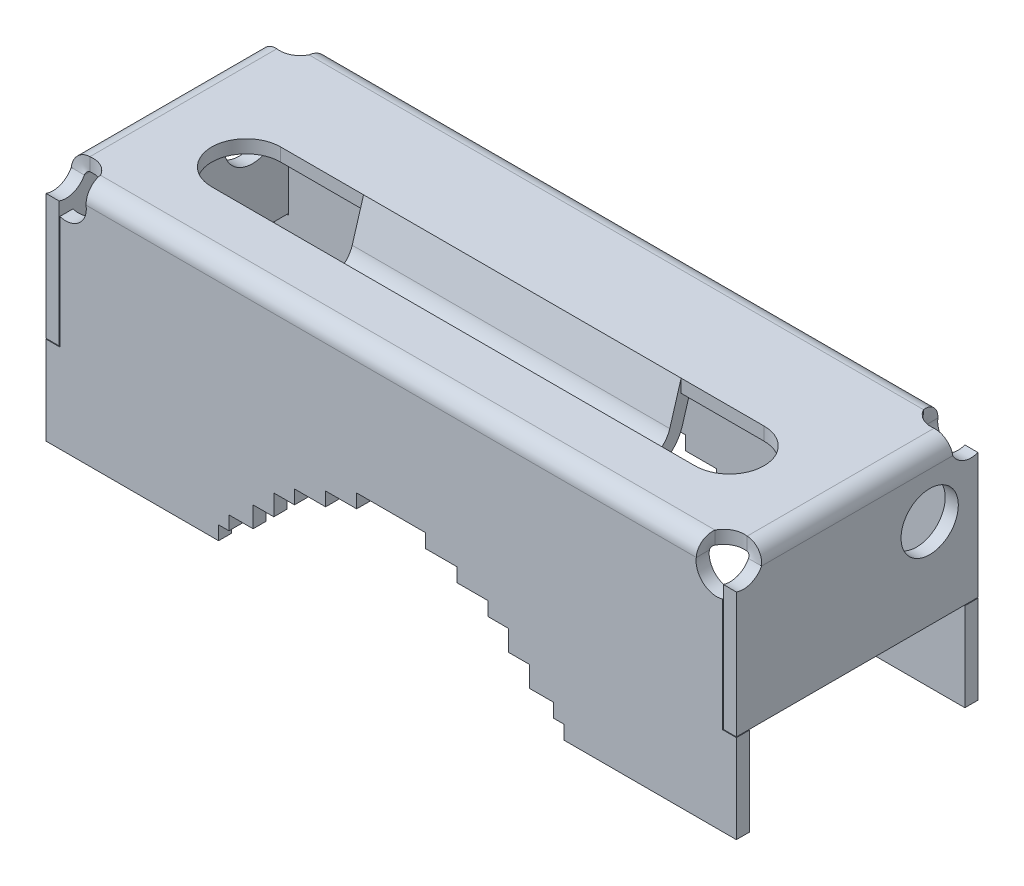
ISO-10303-21;
HEADER;
FILE_DESCRIPTION(('STEP AP214'),'2;1');
FILE_NAME('part.step','',(''),(''),'','','');
FILE_SCHEMA(('AUTOMOTIVE_DESIGN { 1 0 10303 214 1 1 1 1 }'));
ENDSEC;
DATA;
#1=APPLICATION_CONTEXT('core data for automotive mechanical design processes');
#2=APPLICATION_PROTOCOL_DEFINITION('international standard','automotive_design',2000,#1);
#3=PRODUCT_CONTEXT('',#1,'mechanical');
#4=PRODUCT('Part','Part','',(#3));
#5=PRODUCT_RELATED_PRODUCT_CATEGORY('part','',(#4));
#6=PRODUCT_DEFINITION_FORMATION('','',#4);
#7=PRODUCT_DEFINITION_CONTEXT('part definition',#1,'design');
#8=PRODUCT_DEFINITION('design','',#6,#7);
#9=PRODUCT_DEFINITION_SHAPE('','',#8);
#10=(LENGTH_UNIT() NAMED_UNIT(*) SI_UNIT(.MILLI.,.METRE.));
#11=(NAMED_UNIT(*) PLANE_ANGLE_UNIT() SI_UNIT($,.RADIAN.));
#12=(NAMED_UNIT(*) SI_UNIT($,.STERADIAN.) SOLID_ANGLE_UNIT());
#13=UNCERTAINTY_MEASURE_WITH_UNIT(LENGTH_MEASURE(1.E-05),#10,'distance_accuracy_value','');
#14=(GEOMETRIC_REPRESENTATION_CONTEXT(3) GLOBAL_UNCERTAINTY_ASSIGNED_CONTEXT((#13)) GLOBAL_UNIT_ASSIGNED_CONTEXT((#10,
#11,#12)) REPRESENTATION_CONTEXT('',''));
#15=CARTESIAN_POINT('',(0.,0.,0.));
#16=DIRECTION('',(0.,0.,1.));
#17=DIRECTION('',(1.,0.,0.));
#18=AXIS2_PLACEMENT_3D('',#15,#16,#17);
#19=CARTESIAN_POINT('',(35.,-33.950025,-1.50000000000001));
#20=DIRECTION('',(0.,0.,-1.));
#21=DIRECTION('',(-1.,0.,0.));
#22=AXIS2_PLACEMENT_3D('',#19,#20,#21);
#23=PLANE('',#22);
#24=DIRECTION('',(0.,-1.,0.));
#25=VECTOR('',#24,1.);
#26=CARTESIAN_POINT('',(-23.,-33.950025,-1.5));
#27=LINE('',#26,#25);
#28=CARTESIAN_POINT('',(-23.,0.950000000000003,-1.5));
#29=VERTEX_POINT('',#28);
#30=CARTESIAN_POINT('',(-23.,-0.949999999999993,-1.5));
#31=VERTEX_POINT('',#30);
#32=EDGE_CURVE('E763',#29,#31,#27,.T.);
#33=ORIENTED_EDGE('',*,*,#32,.F.);
#34=DIRECTION('',(-1.,0.,0.));
#35=VECTOR('',#34,1.);
#36=CARTESIAN_POINT('',(35.,0.95000000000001,-1.50000000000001));
#37=LINE('',#36,#35);
#38=CARTESIAN_POINT('',(-35.,0.950000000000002,-1.5));
#39=VERTEX_POINT('',#38);
#40=EDGE_CURVE('E2011',#29,#39,#37,.T.);
#41=ORIENTED_EDGE('',*,*,#40,.T.);
#42=DIRECTION('',(0.,1.,0.));
#43=VECTOR('',#42,1.);
#44=CARTESIAN_POINT('',(-35.,-33.950025,-1.5));
#45=LINE('',#44,#43);
#46=CARTESIAN_POINT('',(-35.,-0.949999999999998,-1.5));
#47=VERTEX_POINT('',#46);
#48=EDGE_CURVE('E3426',#47,#39,#45,.T.);
#49=ORIENTED_EDGE('',*,*,#48,.F.);
#50=DIRECTION('',(-1.,0.,0.));
#51=VECTOR('',#50,1.);
#52=CARTESIAN_POINT('',(-50.,-0.95,-1.5));
#53=LINE('',#52,#51);
#54=EDGE_CURVE('E3417',#31,#47,#53,.T.);
#55=ORIENTED_EDGE('',*,*,#54,.F.);
#56=EDGE_LOOP('',(#33,#41,#49,#55));
#57=FACE_BOUND('',#56,.T.);
#58=ADVANCED_FACE('F29',(#57),#23,.F.);
#59=CARTESIAN_POINT('',(35.,-33.950025,8.5));
#60=DIRECTION('',(0.,0.,1.));
#61=DIRECTION('',(1.,0.,0.));
#62=AXIS2_PLACEMENT_3D('',#59,#60,#61);
#63=PLANE('',#62);
#64=DIRECTION('',(0.,1.,0.));
#65=VECTOR('',#64,1.);
#66=CARTESIAN_POINT('',(-23.,-33.950025,8.50000000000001));
#67=LINE('',#66,#65);
#68=CARTESIAN_POINT('',(-23.,-0.949999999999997,8.50000000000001));
#69=VERTEX_POINT('',#68);
#70=CARTESIAN_POINT('',(-23.,0.950000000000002,8.50000000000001));
#71=VERTEX_POINT('',#70);
#72=EDGE_CURVE('E2024',#69,#71,#67,.T.);
#73=ORIENTED_EDGE('',*,*,#72,.F.);
#74=DIRECTION('',(1.,0.,0.));
#75=VECTOR('',#74,1.);
#76=CARTESIAN_POINT('',(-50.,-0.95,8.50000000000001));
#77=LINE('',#76,#75);
#78=CARTESIAN_POINT('',(-35.,-0.95,8.50000000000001));
#79=VERTEX_POINT('',#78);
#80=EDGE_CURVE('E1419',#79,#69,#77,.T.);
#81=ORIENTED_EDGE('',*,*,#80,.F.);
#82=DIRECTION('',(0.,1.,0.));
#83=VECTOR('',#82,1.);
#84=CARTESIAN_POINT('',(-35.,-33.950025,8.50000000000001));
#85=LINE('',#84,#83);
#86=CARTESIAN_POINT('',(-35.,0.950000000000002,8.50000000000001));
#87=VERTEX_POINT('',#86);
#88=EDGE_CURVE('E3428',#79,#87,#85,.T.);
#89=ORIENTED_EDGE('',*,*,#88,.T.);
#90=DIRECTION('',(1.,0.,0.));
#91=VECTOR('',#90,1.);
#92=CARTESIAN_POINT('',(35.,0.95000000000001,8.5));
#93=LINE('',#92,#91);
#94=EDGE_CURVE('E3436',#87,#71,#93,.T.);
#95=ORIENTED_EDGE('',*,*,#94,.T.);
#96=EDGE_LOOP('',(#73,#81,#89,#95));
#97=FACE_BOUND('',#96,.T.);
#98=ADVANCED_FACE('F1977',(#97),#63,.F.);
#99=CARTESIAN_POINT('',(-47.16,-1.88999999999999,-7.50000000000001));
#100=DIRECTION('',(0.,0.,-1.));
#101=DIRECTION('',(-1.,0.,0.));
#102=AXIS2_PLACEMENT_3D('',#99,#100,#101);
#103=CYLINDRICAL_SURFACE('',#102,3.);
#104=CARTESIAN_POINT('',(-44.1924420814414,-1.45000000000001,-17.5));
#105=CARTESIAN_POINT('',(-44.1924420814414,-1.45,-15.6));
#106=B_SPLINE_CURVE_WITH_KNOTS('',1,(#104,#105),.UNSPECIFIED.,.F.,.F.,(2,2),(0.,1.),.UNSPECIFIED.);
#107=CARTESIAN_POINT('',(-44.1924420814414,-1.45,-17.5));
#108=VERTEX_POINT('',#107);
#109=CARTESIAN_POINT('',(-44.1924420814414,-1.45,-15.6));
#110=VERTEX_POINT('',#109);
#111=EDGE_CURVE('E870',#108,#110,#106,.T.);
#112=ORIENTED_EDGE('',*,*,#111,.F.);
#113=CARTESIAN_POINT('',(-47.16,-1.88999999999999,-17.5));
#114=DIRECTION('',(0.,0.,-1.));
#115=DIRECTION('',(-1.,0.,0.));
#116=AXIS2_PLACEMENT_3D('',#113,#114,#115);
#117=CIRCLE('',#116,3.);
#118=CARTESIAN_POINT('',(-48.,-4.77,-17.5));
#119=VERTEX_POINT('',#118);
#120=EDGE_CURVE('E2397',#108,#119,#117,.T.);
#121=ORIENTED_EDGE('',*,*,#120,.T.);
#122=DIRECTION('',(0.,0.,-1.));
#123=VECTOR('',#122,1.);
#124=CARTESIAN_POINT('',(-48.,-4.77,-7.50000000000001));
#125=LINE('',#124,#123);
#126=CARTESIAN_POINT('',(-48.,-4.77,-15.6));
#127=VERTEX_POINT('',#126);
#128=EDGE_CURVE('E2396',#119,#127,#125,.F.);
#129=ORIENTED_EDGE('',*,*,#128,.T.);
#130=CARTESIAN_POINT('',(-47.16,-1.88999999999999,-15.6));
#131=DIRECTION('',(0.,0.,1.));
#132=DIRECTION('',(1.,0.,0.));
#133=AXIS2_PLACEMENT_3D('',#130,#131,#132);
#134=CIRCLE('',#133,3.);
#135=EDGE_CURVE('E2393',#127,#110,#134,.T.);
#136=ORIENTED_EDGE('',*,*,#135,.T.);
#137=EDGE_LOOP('',(#112,#121,#129,#136));
#138=FACE_BOUND('',#137,.T.);
#139=ADVANCED_FACE('F1984',(#138),#103,.F.);
#140=CARTESIAN_POINT('',(47.16,-1.88999999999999,-7.50000000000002));
#141=DIRECTION('',(0.,0.,-1.));
#142=DIRECTION('',(-1.,0.,0.));
#143=AXIS2_PLACEMENT_3D('',#140,#141,#142);
#144=CYLINDRICAL_SURFACE('',#143,3.);
#145=CARTESIAN_POINT('',(44.1924420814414,-1.44999999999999,-15.6));
#146=CARTESIAN_POINT('',(44.1924420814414,-1.44999999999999,-17.5));
#147=B_SPLINE_CURVE_WITH_KNOTS('',1,(#145,#146),.UNSPECIFIED.,.F.,.F.,(2,2),(0.,1.),.UNSPECIFIED.);
#148=CARTESIAN_POINT('',(44.1924420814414,-1.44999999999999,-15.6));
#149=VERTEX_POINT('',#148);
#150=CARTESIAN_POINT('',(44.1924420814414,-1.44999999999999,-17.5));
#151=VERTEX_POINT('',#150);
#152=EDGE_CURVE('E883',#149,#151,#147,.T.);
#153=ORIENTED_EDGE('',*,*,#152,.F.);
#154=CARTESIAN_POINT('',(47.16,-1.88999999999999,-15.6));
#155=DIRECTION('',(0.,0.,1.));
#156=DIRECTION('',(1.,0.,0.));
#157=AXIS2_PLACEMENT_3D('',#154,#155,#156);
#158=CIRCLE('',#157,3.);
#159=CARTESIAN_POINT('',(48.,-4.77,-15.6));
#160=VERTEX_POINT('',#159);
#161=EDGE_CURVE('E2030',#149,#160,#158,.T.);
#162=ORIENTED_EDGE('',*,*,#161,.T.);
#163=DIRECTION('',(0.,0.,-1.));
#164=VECTOR('',#163,1.);
#165=CARTESIAN_POINT('',(48.,-4.77,-7.50000000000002));
#166=LINE('',#165,#164);
#167=CARTESIAN_POINT('',(48.,-4.77,-17.5));
#168=VERTEX_POINT('',#167);
#169=EDGE_CURVE('E2032',#168,#160,#166,.F.);
#170=ORIENTED_EDGE('',*,*,#169,.F.);
#171=CARTESIAN_POINT('',(47.16,-1.88999999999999,-17.5));
#172=DIRECTION('',(0.,0.,-1.));
#173=DIRECTION('',(1.,0.,0.));
#174=AXIS2_PLACEMENT_3D('',#171,#172,#173);
#175=CIRCLE('',#174,3.);
#176=EDGE_CURVE('E2033',#168,#151,#175,.T.);
#177=ORIENTED_EDGE('',*,*,#176,.T.);
#178=EDGE_LOOP('',(#153,#162,#170,#177));
#179=FACE_BOUND('',#178,.T.);
#180=ADVANCED_FACE('F2039',(#179),#144,.F.);
#181=CARTESIAN_POINT('',(-48.,-33.95,192.797408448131));
#182=DIRECTION('',(-1.,0.,0.));
#183=DIRECTION('',(0.,0.,1.));
#184=AXIS2_PLACEMENT_3D('',#181,#182,#183);
#185=PLANE('',#184);
#186=ORIENTED_EDGE('',*,*,#128,.F.);
#187=DIRECTION('',(0.,1.,0.));
#188=VECTOR('',#187,1.);
#189=CARTESIAN_POINT('',(-48.,-33.95,-17.5));
#190=LINE('',#189,#188);
#191=CARTESIAN_POINT('',(-48.,-21.15,-17.5));
#192=VERTEX_POINT('',#191);
#193=EDGE_CURVE('E2210',#192,#119,#190,.T.);
#194=ORIENTED_EDGE('',*,*,#193,.F.);
#195=DIRECTION('',(0.,0.,-1.));
#196=VECTOR('',#195,1.);
#197=CARTESIAN_POINT('',(-48.,-21.15,192.797408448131));
#198=LINE('',#197,#196);
#199=CARTESIAN_POINT('',(-48.,-21.15,-15.6));
#200=VERTEX_POINT('',#199);
#201=EDGE_CURVE('E2196',#200,#192,#198,.T.);
#202=ORIENTED_EDGE('',*,*,#201,.F.);
#203=DIRECTION('',(0.,1.,0.));
#204=VECTOR('',#203,1.);
#205=CARTESIAN_POINT('',(-48.,-33.95,-15.6));
#206=LINE('',#205,#204);
#207=EDGE_CURVE('E2220',#200,#127,#206,.T.);
#208=ORIENTED_EDGE('',*,*,#207,.T.);
#209=EDGE_LOOP('',(#186,#194,#202,#208));
#210=FACE_BOUND('',#209,.T.);
#211=ADVANCED_FACE('F31',(#210),#185,.T.);
#212=CARTESIAN_POINT('',(-50.,-21.15,192.797408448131));
#213=DIRECTION('',(0.,1.,0.));
#214=DIRECTION('',(1.,0.,0.));
#215=AXIS2_PLACEMENT_3D('',#212,#213,#214);
#216=PLANE('',#215);
#217=ORIENTED_EDGE('',*,*,#201,.T.);
#218=DIRECTION('',(1.,0.,0.));
#219=VECTOR('',#218,1.);
#220=CARTESIAN_POINT('',(-50.,-21.15,-17.5));
#221=LINE('',#220,#219);
#222=CARTESIAN_POINT('',(-50.,-21.15,-17.5));
#223=VERTEX_POINT('',#222);
#224=EDGE_CURVE('E2199',#223,#192,#221,.T.);
#225=ORIENTED_EDGE('',*,*,#224,.F.);
#226=DIRECTION('',(0.,0.,-1.));
#227=VECTOR('',#226,1.);
#228=CARTESIAN_POINT('',(-50.,-21.15,192.797408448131));
#229=LINE('',#228,#227);
#230=CARTESIAN_POINT('',(-50.,-21.15,-15.6));
#231=VERTEX_POINT('',#230);
#232=EDGE_CURVE('E2205',#231,#223,#229,.T.);
#233=ORIENTED_EDGE('',*,*,#232,.F.);
#234=DIRECTION('',(1.,0.,0.));
#235=VECTOR('',#234,1.);
#236=CARTESIAN_POINT('',(-50.,-21.15,-15.6));
#237=LINE('',#236,#235);
#238=EDGE_CURVE('E2202',#231,#200,#237,.T.);
#239=ORIENTED_EDGE('',*,*,#238,.T.);
#240=EDGE_LOOP('',(#217,#225,#233,#239));
#241=FACE_BOUND('',#240,.T.);
#242=ADVANCED_FACE('F2186',(#241),#216,.T.);
#243=CARTESIAN_POINT('',(-50.,-21.15,192.797408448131));
#244=DIRECTION('',(1.,0.,0.));
#245=DIRECTION('',(0.,-1.,0.));
#246=AXIS2_PLACEMENT_3D('',#243,#244,#245);
#247=PLANE('',#246);
#248=DIRECTION('',(0.,1.,0.));
#249=VECTOR('',#248,1.);
#250=CARTESIAN_POINT('',(-50.,-33.95,-17.5));
#251=LINE('',#250,#249);
#252=CARTESIAN_POINT('',(-50.,-33.95,-17.5));
#253=VERTEX_POINT('',#252);
#254=EDGE_CURVE('E2212',#253,#223,#251,.T.);
#255=ORIENTED_EDGE('',*,*,#254,.F.);
#256=DIRECTION('',(0.,0.,-1.));
#257=VECTOR('',#256,1.);
#258=CARTESIAN_POINT('',(-50.,-33.95,192.797408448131));
#259=LINE('',#258,#257);
#260=CARTESIAN_POINT('',(-50.,-33.95,-15.6));
#261=VERTEX_POINT('',#260);
#262=EDGE_CURVE('E2386',#261,#253,#259,.T.);
#263=ORIENTED_EDGE('',*,*,#262,.F.);
#264=DIRECTION('',(0.,-1.,0.));
#265=VECTOR('',#264,1.);
#266=CARTESIAN_POINT('',(-50.,-21.15,-15.6));
#267=LINE('',#266,#265);
#268=EDGE_CURVE('E2223',#231,#261,#267,.T.);
#269=ORIENTED_EDGE('',*,*,#268,.F.);
#270=ORIENTED_EDGE('',*,*,#232,.T.);
#271=EDGE_LOOP('',(#255,#263,#269,#270));
#272=FACE_BOUND('',#271,.T.);
#273=ADVANCED_FACE('F2076',(#272),#247,.F.);
#274=CARTESIAN_POINT('',(-48.,-33.95,192.797408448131));
#275=DIRECTION('',(0.,1.,0.));
#276=DIRECTION('',(0.,0.,1.));
#277=AXIS2_PLACEMENT_3D('',#274,#275,#276);
#278=PLANE('',#277);
#279=DIRECTION('',(1.,0.,0.));
#280=VECTOR('',#279,1.);
#281=CARTESIAN_POINT('',(-48.,-33.95,-17.5));
#282=LINE('',#281,#280);
#283=CARTESIAN_POINT('',(-25.,-33.95,-17.5));
#284=VERTEX_POINT('',#283);
#285=EDGE_CURVE('E2216',#253,#284,#282,.T.);
#286=ORIENTED_EDGE('',*,*,#285,.T.);
#287=DIRECTION('',(0.,0.,-1.));
#288=VECTOR('',#287,1.);
#289=CARTESIAN_POINT('',(-25.,-33.95,192.797408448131));
#290=LINE('',#289,#288);
#291=CARTESIAN_POINT('',(-25.,-33.95,-15.6));
#292=VERTEX_POINT('',#291);
#293=EDGE_CURVE('E2383',#292,#284,#290,.T.);
#294=ORIENTED_EDGE('',*,*,#293,.F.);
#295=DIRECTION('',(1.,0.,0.));
#296=VECTOR('',#295,1.);
#297=CARTESIAN_POINT('',(-48.,-33.95,-15.6));
#298=LINE('',#297,#296);
#299=EDGE_CURVE('E2226',#261,#292,#298,.T.);
#300=ORIENTED_EDGE('',*,*,#299,.F.);
#301=ORIENTED_EDGE('',*,*,#262,.T.);
#302=EDGE_LOOP('',(#286,#294,#300,#301));
#303=FACE_BOUND('',#302,.T.);
#304=ADVANCED_FACE('F2072',(#303),#278,.F.);
#305=CARTESIAN_POINT('',(-25.,-33.95,192.797408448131));
#306=DIRECTION('',(1.,0.,0.));
#307=DIRECTION('',(0.,-1.,0.));
#308=AXIS2_PLACEMENT_3D('',#305,#306,#307);
#309=PLANE('',#308);
#310=ORIENTED_EDGE('',*,*,#293,.T.);
#311=DIRECTION('',(0.,-1.,0.));
#312=VECTOR('',#311,1.);
#313=CARTESIAN_POINT('',(-25.,-31.95,-17.5));
#314=LINE('',#313,#312);
#315=CARTESIAN_POINT('',(-25.,-31.95,-17.5));
#316=VERTEX_POINT('',#315);
#317=EDGE_CURVE('E2513',#316,#284,#314,.T.);
#318=ORIENTED_EDGE('',*,*,#317,.F.);
#319=DIRECTION('',(0.,0.,-1.));
#320=VECTOR('',#319,1.);
#321=CARTESIAN_POINT('',(-25.,-31.95,192.797408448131));
#322=LINE('',#321,#320);
#323=CARTESIAN_POINT('',(-25.,-31.95,-15.6));
#324=VERTEX_POINT('',#323);
#325=EDGE_CURVE('E2380',#324,#316,#322,.T.);
#326=ORIENTED_EDGE('',*,*,#325,.F.);
#327=DIRECTION('',(0.,-1.,0.));
#328=VECTOR('',#327,1.);
#329=CARTESIAN_POINT('',(-25.,-33.95,-15.6));
#330=LINE('',#329,#328);
#331=EDGE_CURVE('E2229',#324,#292,#330,.T.);
#332=ORIENTED_EDGE('',*,*,#331,.T.);
#333=EDGE_LOOP('',(#310,#318,#326,#332));
#334=FACE_BOUND('',#333,.T.);
#335=ADVANCED_FACE('F2075',(#334),#309,.T.);
#336=CARTESIAN_POINT('',(-48.,-31.95,192.797408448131));
#337=DIRECTION('',(0.,-1.,0.));
#338=DIRECTION('',(-1.,0.,0.));
#339=AXIS2_PLACEMENT_3D('',#336,#337,#338);
#340=PLANE('',#339);
#341=ORIENTED_EDGE('',*,*,#325,.T.);
#342=DIRECTION('',(-1.,0.,0.));
#343=VECTOR('',#342,1.);
#344=CARTESIAN_POINT('',(-23.5,-31.95,-17.5));
#345=LINE('',#344,#343);
#346=CARTESIAN_POINT('',(-23.5,-31.95,-17.5));
#347=VERTEX_POINT('',#346);
#348=EDGE_CURVE('E2511',#347,#316,#345,.T.);
#349=ORIENTED_EDGE('',*,*,#348,.F.);
#350=DIRECTION('',(0.,0.,-1.));
#351=VECTOR('',#350,1.);
#352=CARTESIAN_POINT('',(-23.5,-31.95,192.797408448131));
#353=LINE('',#352,#351);
#354=CARTESIAN_POINT('',(-23.5,-31.95,-15.6));
#355=VERTEX_POINT('',#354);
#356=EDGE_CURVE('E2377',#355,#347,#353,.T.);
#357=ORIENTED_EDGE('',*,*,#356,.F.);
#358=DIRECTION('',(-1.,0.,0.));
#359=VECTOR('',#358,1.);
#360=CARTESIAN_POINT('',(-48.,-31.95,-15.6));
#361=LINE('',#360,#359);
#362=EDGE_CURVE('E2232',#355,#324,#361,.T.);
#363=ORIENTED_EDGE('',*,*,#362,.T.);
#364=EDGE_LOOP('',(#341,#349,#357,#363));
#365=FACE_BOUND('',#364,.T.);
#366=ADVANCED_FACE('F2177',(#365),#340,.T.);
#367=CARTESIAN_POINT('',(-23.5,-33.95,192.797408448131));
#368=DIRECTION('',(1.,0.,0.));
#369=DIRECTION('',(0.,-1.,0.));
#370=AXIS2_PLACEMENT_3D('',#367,#368,#369);
#371=PLANE('',#370);
#372=ORIENTED_EDGE('',*,*,#356,.T.);
#373=DIRECTION('',(0.,-1.,0.));
#374=VECTOR('',#373,1.);
#375=CARTESIAN_POINT('',(-23.5,-29.95,-17.5));
#376=LINE('',#375,#374);
#377=CARTESIAN_POINT('',(-23.5,-29.95,-17.5));
#378=VERTEX_POINT('',#377);
#379=EDGE_CURVE('E2508',#378,#347,#376,.T.);
#380=ORIENTED_EDGE('',*,*,#379,.F.);
#381=DIRECTION('',(0.,0.,-1.));
#382=VECTOR('',#381,1.);
#383=CARTESIAN_POINT('',(-23.5,-29.95,192.797408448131));
#384=LINE('',#383,#382);
#385=CARTESIAN_POINT('',(-23.5,-29.95,-15.6));
#386=VERTEX_POINT('',#385);
#387=EDGE_CURVE('E2374',#386,#378,#384,.T.);
#388=ORIENTED_EDGE('',*,*,#387,.F.);
#389=DIRECTION('',(0.,-1.,0.));
#390=VECTOR('',#389,1.);
#391=CARTESIAN_POINT('',(-23.5,-33.95,-15.6));
#392=LINE('',#391,#390);
#393=EDGE_CURVE('E2234',#386,#355,#392,.T.);
#394=ORIENTED_EDGE('',*,*,#393,.T.);
#395=EDGE_LOOP('',(#372,#380,#388,#394));
#396=FACE_BOUND('',#395,.T.);
#397=ADVANCED_FACE('F2173',(#396),#371,.T.);
#398=CARTESIAN_POINT('',(-48.,-29.95,192.797408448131));
#399=DIRECTION('',(0.,-1.,0.));
#400=DIRECTION('',(-1.,0.,0.));
#401=AXIS2_PLACEMENT_3D('',#398,#399,#400);
#402=PLANE('',#401);
#403=ORIENTED_EDGE('',*,*,#387,.T.);
#404=DIRECTION('',(-1.,0.,0.));
#405=VECTOR('',#404,1.);
#406=CARTESIAN_POINT('',(-20.,-29.95,-17.5));
#407=LINE('',#406,#405);
#408=CARTESIAN_POINT('',(-20.,-29.95,-17.5));
#409=VERTEX_POINT('',#408);
#410=EDGE_CURVE('E2505',#409,#378,#407,.T.);
#411=ORIENTED_EDGE('',*,*,#410,.F.);
#412=DIRECTION('',(0.,0.,-1.));
#413=VECTOR('',#412,1.);
#414=CARTESIAN_POINT('',(-20.,-29.95,192.797408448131));
#415=LINE('',#414,#413);
#416=CARTESIAN_POINT('',(-20.,-29.95,-15.6));
#417=VERTEX_POINT('',#416);
#418=EDGE_CURVE('E2371',#417,#409,#415,.T.);
#419=ORIENTED_EDGE('',*,*,#418,.F.);
#420=DIRECTION('',(-1.,0.,0.));
#421=VECTOR('',#420,1.);
#422=CARTESIAN_POINT('',(-48.,-29.95,-15.6));
#423=LINE('',#422,#421);
#424=EDGE_CURVE('E2236',#417,#386,#423,.T.);
#425=ORIENTED_EDGE('',*,*,#424,.T.);
#426=EDGE_LOOP('',(#403,#411,#419,#425));
#427=FACE_BOUND('',#426,.T.);
#428=ADVANCED_FACE('F2169',(#427),#402,.T.);
#429=CARTESIAN_POINT('',(-20.,-33.95,192.797408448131));
#430=DIRECTION('',(1.,0.,0.));
#431=DIRECTION('',(0.,-1.,0.));
#432=AXIS2_PLACEMENT_3D('',#429,#430,#431);
#433=PLANE('',#432);
#434=ORIENTED_EDGE('',*,*,#418,.T.);
#435=DIRECTION('',(0.,-1.,0.));
#436=VECTOR('',#435,1.);
#437=CARTESIAN_POINT('',(-20.,-26.95,-17.5));
#438=LINE('',#437,#436);
#439=CARTESIAN_POINT('',(-20.,-26.95,-17.5));
#440=VERTEX_POINT('',#439);
#441=EDGE_CURVE('E2502',#440,#409,#438,.T.);
#442=ORIENTED_EDGE('',*,*,#441,.F.);
#443=DIRECTION('',(0.,0.,-1.));
#444=VECTOR('',#443,1.);
#445=CARTESIAN_POINT('',(-20.,-26.95,192.797408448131));
#446=LINE('',#445,#444);
#447=CARTESIAN_POINT('',(-20.,-26.95,-15.6));
#448=VERTEX_POINT('',#447);
#449=EDGE_CURVE('E2368',#448,#440,#446,.T.);
#450=ORIENTED_EDGE('',*,*,#449,.F.);
#451=DIRECTION('',(0.,-1.,0.));
#452=VECTOR('',#451,1.);
#453=CARTESIAN_POINT('',(-20.,-33.95,-15.6));
#454=LINE('',#453,#452);
#455=EDGE_CURVE('E2238',#448,#417,#454,.T.);
#456=ORIENTED_EDGE('',*,*,#455,.T.);
#457=EDGE_LOOP('',(#434,#442,#450,#456));
#458=FACE_BOUND('',#457,.T.);
#459=ADVANCED_FACE('F2165',(#458),#433,.T.);
#460=CARTESIAN_POINT('',(-48.,-26.95,192.797408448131));
#461=DIRECTION('',(0.,-1.,0.));
#462=DIRECTION('',(-1.,0.,0.));
#463=AXIS2_PLACEMENT_3D('',#460,#461,#462);
#464=PLANE('',#463);
#465=ORIENTED_EDGE('',*,*,#449,.T.);
#466=DIRECTION('',(-1.,0.,0.));
#467=VECTOR('',#466,1.);
#468=CARTESIAN_POINT('',(-17.,-26.95,-17.5));
#469=LINE('',#468,#467);
#470=CARTESIAN_POINT('',(-17.,-26.95,-17.5));
#471=VERTEX_POINT('',#470);
#472=EDGE_CURVE('E2499',#471,#440,#469,.T.);
#473=ORIENTED_EDGE('',*,*,#472,.F.);
#474=DIRECTION('',(0.,0.,-1.));
#475=VECTOR('',#474,1.);
#476=CARTESIAN_POINT('',(-17.,-26.95,192.797408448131));
#477=LINE('',#476,#475);
#478=CARTESIAN_POINT('',(-17.,-26.95,-15.6));
#479=VERTEX_POINT('',#478);
#480=EDGE_CURVE('E2365',#479,#471,#477,.T.);
#481=ORIENTED_EDGE('',*,*,#480,.F.);
#482=DIRECTION('',(-1.,0.,0.));
#483=VECTOR('',#482,1.);
#484=CARTESIAN_POINT('',(-48.,-26.95,-15.6));
#485=LINE('',#484,#483);
#486=EDGE_CURVE('E2240',#479,#448,#485,.T.);
#487=ORIENTED_EDGE('',*,*,#486,.T.);
#488=EDGE_LOOP('',(#465,#473,#481,#487));
#489=FACE_BOUND('',#488,.T.);
#490=ADVANCED_FACE('F2161',(#489),#464,.T.);
#491=CARTESIAN_POINT('',(-17.,-33.95,192.797408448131));
#492=DIRECTION('',(1.,0.,0.));
#493=DIRECTION('',(0.,-1.,0.));
#494=AXIS2_PLACEMENT_3D('',#491,#492,#493);
#495=PLANE('',#494);
#496=ORIENTED_EDGE('',*,*,#480,.T.);
#497=DIRECTION('',(0.,-1.,0.));
#498=VECTOR('',#497,1.);
#499=CARTESIAN_POINT('',(-17.,-23.95,-17.5));
#500=LINE('',#499,#498);
#501=CARTESIAN_POINT('',(-17.,-23.95,-17.5));
#502=VERTEX_POINT('',#501);
#503=EDGE_CURVE('E2496',#502,#471,#500,.T.);
#504=ORIENTED_EDGE('',*,*,#503,.F.);
#505=DIRECTION('',(0.,0.,-1.));
#506=VECTOR('',#505,1.);
#507=CARTESIAN_POINT('',(-17.,-23.95,192.797408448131));
#508=LINE('',#507,#506);
#509=CARTESIAN_POINT('',(-17.,-23.95,-15.6));
#510=VERTEX_POINT('',#509);
#511=EDGE_CURVE('E2362',#510,#502,#508,.T.);
#512=ORIENTED_EDGE('',*,*,#511,.F.);
#513=DIRECTION('',(0.,-1.,0.));
#514=VECTOR('',#513,1.);
#515=CARTESIAN_POINT('',(-17.,-33.95,-15.6));
#516=LINE('',#515,#514);
#517=EDGE_CURVE('E2242',#510,#479,#516,.T.);
#518=ORIENTED_EDGE('',*,*,#517,.T.);
#519=EDGE_LOOP('',(#496,#504,#512,#518));
#520=FACE_BOUND('',#519,.T.);
#521=ADVANCED_FACE('F2157',(#520),#495,.T.);
#522=CARTESIAN_POINT('',(-48.,-23.95,192.797408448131));
#523=DIRECTION('',(0.,-1.,0.));
#524=DIRECTION('',(-1.,0.,0.));
#525=AXIS2_PLACEMENT_3D('',#522,#523,#524);
#526=PLANE('',#525);
#527=ORIENTED_EDGE('',*,*,#511,.T.);
#528=DIRECTION('',(-1.,0.,0.));
#529=VECTOR('',#528,1.);
#530=CARTESIAN_POINT('',(-14.,-23.95,-17.5));
#531=LINE('',#530,#529);
#532=CARTESIAN_POINT('',(-14.,-23.95,-17.5));
#533=VERTEX_POINT('',#532);
#534=EDGE_CURVE('E2493',#533,#502,#531,.T.);
#535=ORIENTED_EDGE('',*,*,#534,.F.);
#536=DIRECTION('',(0.,0.,-1.));
#537=VECTOR('',#536,1.);
#538=CARTESIAN_POINT('',(-14.,-23.95,192.797408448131));
#539=LINE('',#538,#537);
#540=CARTESIAN_POINT('',(-14.,-23.95,-15.6));
#541=VERTEX_POINT('',#540);
#542=EDGE_CURVE('E2359',#541,#533,#539,.T.);
#543=ORIENTED_EDGE('',*,*,#542,.F.);
#544=DIRECTION('',(-1.,0.,0.));
#545=VECTOR('',#544,1.);
#546=CARTESIAN_POINT('',(-48.,-23.95,-15.6));
#547=LINE('',#546,#545);
#548=EDGE_CURVE('E2244',#541,#510,#547,.T.);
#549=ORIENTED_EDGE('',*,*,#548,.T.);
#550=EDGE_LOOP('',(#527,#535,#543,#549));
#551=FACE_BOUND('',#550,.T.);
#552=ADVANCED_FACE('F2153',(#551),#526,.T.);
#553=CARTESIAN_POINT('',(-14.,-33.95,192.797408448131));
#554=DIRECTION('',(1.,0.,0.));
#555=DIRECTION('',(0.,-1.,0.));
#556=AXIS2_PLACEMENT_3D('',#553,#554,#555);
#557=PLANE('',#556);
#558=ORIENTED_EDGE('',*,*,#542,.T.);
#559=DIRECTION('',(0.,-1.,0.));
#560=VECTOR('',#559,1.);
#561=CARTESIAN_POINT('',(-14.,-21.95,-17.5));
#562=LINE('',#561,#560);
#563=CARTESIAN_POINT('',(-14.,-21.95,-17.5));
#564=VERTEX_POINT('',#563);
#565=EDGE_CURVE('E2490',#564,#533,#562,.T.);
#566=ORIENTED_EDGE('',*,*,#565,.F.);
#567=DIRECTION('',(0.,0.,-1.));
#568=VECTOR('',#567,1.);
#569=CARTESIAN_POINT('',(-14.,-21.95,192.797408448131));
#570=LINE('',#569,#568);
#571=CARTESIAN_POINT('',(-14.,-21.95,-15.6));
#572=VERTEX_POINT('',#571);
#573=EDGE_CURVE('E2356',#572,#564,#570,.T.);
#574=ORIENTED_EDGE('',*,*,#573,.F.);
#575=DIRECTION('',(0.,-1.,0.));
#576=VECTOR('',#575,1.);
#577=CARTESIAN_POINT('',(-14.,-33.95,-15.6));
#578=LINE('',#577,#576);
#579=EDGE_CURVE('E2246',#572,#541,#578,.T.);
#580=ORIENTED_EDGE('',*,*,#579,.T.);
#581=EDGE_LOOP('',(#558,#566,#574,#580));
#582=FACE_BOUND('',#581,.T.);
#583=ADVANCED_FACE('F2149',(#582),#557,.T.);
#584=CARTESIAN_POINT('',(-48.,-21.95,192.797408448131));
#585=DIRECTION('',(0.,-1.,0.));
#586=DIRECTION('',(-1.,0.,0.));
#587=AXIS2_PLACEMENT_3D('',#584,#585,#586);
#588=PLANE('',#587);
#589=ORIENTED_EDGE('',*,*,#573,.T.);
#590=DIRECTION('',(-1.,0.,0.));
#591=VECTOR('',#590,1.);
#592=CARTESIAN_POINT('',(-9.5,-21.95,-17.5));
#593=LINE('',#592,#591);
#594=CARTESIAN_POINT('',(-9.5,-21.95,-17.5));
#595=VERTEX_POINT('',#594);
#596=EDGE_CURVE('E2487',#595,#564,#593,.T.);
#597=ORIENTED_EDGE('',*,*,#596,.F.);
#598=DIRECTION('',(0.,0.,-1.));
#599=VECTOR('',#598,1.);
#600=CARTESIAN_POINT('',(-9.49999999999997,-21.95,192.797408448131));
#601=LINE('',#600,#599);
#602=CARTESIAN_POINT('',(-9.5,-21.95,-15.6));
#603=VERTEX_POINT('',#602);
#604=EDGE_CURVE('E2353',#603,#595,#601,.T.);
#605=ORIENTED_EDGE('',*,*,#604,.F.);
#606=DIRECTION('',(-1.,0.,0.));
#607=VECTOR('',#606,1.);
#608=CARTESIAN_POINT('',(-48.,-21.95,-15.6));
#609=LINE('',#608,#607);
#610=EDGE_CURVE('E2248',#603,#572,#609,.T.);
#611=ORIENTED_EDGE('',*,*,#610,.T.);
#612=EDGE_LOOP('',(#589,#597,#605,#611));
#613=FACE_BOUND('',#612,.T.);
#614=ADVANCED_FACE('F2145',(#613),#588,.T.);
#615=CARTESIAN_POINT('',(-9.49999999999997,-33.95,192.797408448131));
#616=DIRECTION('',(1.,0.,0.));
#617=DIRECTION('',(0.,-1.,0.));
#618=AXIS2_PLACEMENT_3D('',#615,#616,#617);
#619=PLANE('',#618);
#620=ORIENTED_EDGE('',*,*,#604,.T.);
#621=DIRECTION('',(0.,-1.,0.));
#622=VECTOR('',#621,1.);
#623=CARTESIAN_POINT('',(-9.5,-19.95,-17.5));
#624=LINE('',#623,#622);
#625=CARTESIAN_POINT('',(-9.5,-19.95,-17.5));
#626=VERTEX_POINT('',#625);
#627=EDGE_CURVE('E2484',#626,#595,#624,.T.);
#628=ORIENTED_EDGE('',*,*,#627,.F.);
#629=DIRECTION('',(0.,0.,-1.));
#630=VECTOR('',#629,1.);
#631=CARTESIAN_POINT('',(-9.49999999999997,-19.95,192.797408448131));
#632=LINE('',#631,#630);
#633=CARTESIAN_POINT('',(-9.5,-19.95,-15.6));
#634=VERTEX_POINT('',#633);
#635=EDGE_CURVE('E2350',#634,#626,#632,.T.);
#636=ORIENTED_EDGE('',*,*,#635,.F.);
#637=DIRECTION('',(0.,-1.,0.));
#638=VECTOR('',#637,1.);
#639=CARTESIAN_POINT('',(-9.5,-33.95,-15.6));
#640=LINE('',#639,#638);
#641=EDGE_CURVE('E2250',#634,#603,#640,.T.);
#642=ORIENTED_EDGE('',*,*,#641,.T.);
#643=EDGE_LOOP('',(#620,#628,#636,#642));
#644=FACE_BOUND('',#643,.T.);
#645=ADVANCED_FACE('F2141',(#644),#619,.T.);
#646=CARTESIAN_POINT('',(-48.,-19.95,192.797408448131));
#647=DIRECTION('',(0.,-1.,0.));
#648=DIRECTION('',(-1.,0.,0.));
#649=AXIS2_PLACEMENT_3D('',#646,#647,#648);
#650=PLANE('',#649);
#651=ORIENTED_EDGE('',*,*,#635,.T.);
#652=DIRECTION('',(-1.,0.,0.));
#653=VECTOR('',#652,1.);
#654=CARTESIAN_POINT('',(-4.99999999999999,-19.95,-17.5));
#655=LINE('',#654,#653);
#656=CARTESIAN_POINT('',(-5.,-19.95,-17.5));
#657=VERTEX_POINT('',#656);
#658=EDGE_CURVE('E2481',#657,#626,#655,.T.);
#659=ORIENTED_EDGE('',*,*,#658,.F.);
#660=DIRECTION('',(0.,0.,-1.));
#661=VECTOR('',#660,1.);
#662=CARTESIAN_POINT('',(-4.99999999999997,-19.95,192.797408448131));
#663=LINE('',#662,#661);
#664=CARTESIAN_POINT('',(-4.99999999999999,-19.95,-15.6));
#665=VERTEX_POINT('',#664);
#666=EDGE_CURVE('E2347',#665,#657,#663,.T.);
#667=ORIENTED_EDGE('',*,*,#666,.F.);
#668=DIRECTION('',(-1.,0.,0.));
#669=VECTOR('',#668,1.);
#670=CARTESIAN_POINT('',(-48.,-19.95,-15.6));
#671=LINE('',#670,#669);
#672=EDGE_CURVE('E2252',#665,#634,#671,.T.);
#673=ORIENTED_EDGE('',*,*,#672,.T.);
#674=EDGE_LOOP('',(#651,#659,#667,#673));
#675=FACE_BOUND('',#674,.T.);
#676=ADVANCED_FACE('F2137',(#675),#650,.T.);
#677=CARTESIAN_POINT('',(-4.99999999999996,-33.95,192.797408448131));
#678=DIRECTION('',(1.,0.,0.));
#679=DIRECTION('',(0.,-1.,0.));
#680=AXIS2_PLACEMENT_3D('',#677,#678,#679);
#681=PLANE('',#680);
#682=ORIENTED_EDGE('',*,*,#666,.T.);
#683=DIRECTION('',(0.,-1.,0.));
#684=VECTOR('',#683,1.);
#685=CARTESIAN_POINT('',(-5.,-17.95,-17.5));
#686=LINE('',#685,#684);
#687=CARTESIAN_POINT('',(-5.,-17.95,-17.5));
#688=VERTEX_POINT('',#687);
#689=EDGE_CURVE('E2478',#688,#657,#686,.T.);
#690=ORIENTED_EDGE('',*,*,#689,.F.);
#691=DIRECTION('',(0.,0.,-1.));
#692=VECTOR('',#691,1.);
#693=CARTESIAN_POINT('',(-4.99999999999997,-17.95,192.797408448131));
#694=LINE('',#693,#692);
#695=CARTESIAN_POINT('',(-5.,-17.95,-15.6));
#696=VERTEX_POINT('',#695);
#697=EDGE_CURVE('E2344',#696,#688,#694,.T.);
#698=ORIENTED_EDGE('',*,*,#697,.F.);
#699=DIRECTION('',(0.,-1.,0.));
#700=VECTOR('',#699,1.);
#701=CARTESIAN_POINT('',(-4.99999999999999,-33.95,-15.6));
#702=LINE('',#701,#700);
#703=EDGE_CURVE('E2254',#696,#665,#702,.T.);
#704=ORIENTED_EDGE('',*,*,#703,.T.);
#705=EDGE_LOOP('',(#682,#690,#698,#704));
#706=FACE_BOUND('',#705,.T.);
#707=ADVANCED_FACE('F2133',(#706),#681,.T.);
#708=CARTESIAN_POINT('',(-48.,-17.95,192.797408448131));
#709=DIRECTION('',(0.,-1.,0.));
#710=DIRECTION('',(-1.,0.,0.));
#711=AXIS2_PLACEMENT_3D('',#708,#709,#710);
#712=PLANE('',#711);
#713=ORIENTED_EDGE('',*,*,#697,.T.);
#714=DIRECTION('',(-1.,0.,0.));
#715=VECTOR('',#714,1.);
#716=CARTESIAN_POINT('',(5.,-17.95,-17.5));
#717=LINE('',#716,#715);
#718=CARTESIAN_POINT('',(4.99999999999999,-17.95,-17.5));
#719=VERTEX_POINT('',#718);
#720=EDGE_CURVE('E2475',#719,#688,#717,.T.);
#721=ORIENTED_EDGE('',*,*,#720,.F.);
#722=DIRECTION('',(0.,0.,-1.));
#723=VECTOR('',#722,1.);
#724=CARTESIAN_POINT('',(5.00000000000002,-17.95,192.797408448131));
#725=LINE('',#724,#723);
#726=CARTESIAN_POINT('',(5.,-17.95,-15.6));
#727=VERTEX_POINT('',#726);
#728=EDGE_CURVE('E2341',#727,#719,#725,.T.);
#729=ORIENTED_EDGE('',*,*,#728,.F.);
#730=DIRECTION('',(-1.,0.,0.));
#731=VECTOR('',#730,1.);
#732=CARTESIAN_POINT('',(-48.,-17.95,-15.6));
#733=LINE('',#732,#731);
#734=EDGE_CURVE('E2256',#727,#696,#733,.T.);
#735=ORIENTED_EDGE('',*,*,#734,.T.);
#736=EDGE_LOOP('',(#713,#721,#729,#735));
#737=FACE_BOUND('',#736,.T.);
#738=ADVANCED_FACE('F2129',(#737),#712,.T.);
#739=CARTESIAN_POINT('',(5.00000000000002,-33.95,192.797408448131));
#740=DIRECTION('',(-1.,0.,0.));
#741=DIRECTION('',(0.,1.,0.));
#742=AXIS2_PLACEMENT_3D('',#739,#740,#741);
#743=PLANE('',#742);
#744=ORIENTED_EDGE('',*,*,#728,.T.);
#745=DIRECTION('',(0.,1.,0.));
#746=VECTOR('',#745,1.);
#747=CARTESIAN_POINT('',(5.,-17.95,-17.5));
#748=LINE('',#747,#746);
#749=CARTESIAN_POINT('',(4.99999999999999,-19.95,-17.5));
#750=VERTEX_POINT('',#749);
#751=EDGE_CURVE('E2472',#750,#719,#748,.T.);
#752=ORIENTED_EDGE('',*,*,#751,.F.);
#753=DIRECTION('',(0.,0.,-1.));
#754=VECTOR('',#753,1.);
#755=CARTESIAN_POINT('',(5.00000000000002,-19.95,192.797408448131));
#756=LINE('',#755,#754);
#757=CARTESIAN_POINT('',(4.99999999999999,-19.95,-15.6));
#758=VERTEX_POINT('',#757);
#759=EDGE_CURVE('E2338',#758,#750,#756,.T.);
#760=ORIENTED_EDGE('',*,*,#759,.F.);
#761=DIRECTION('',(0.,1.,0.));
#762=VECTOR('',#761,1.);
#763=CARTESIAN_POINT('',(4.99999999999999,-33.95,-15.6));
#764=LINE('',#763,#762);
#765=EDGE_CURVE('E2258',#758,#727,#764,.T.);
#766=ORIENTED_EDGE('',*,*,#765,.T.);
#767=EDGE_LOOP('',(#744,#752,#760,#766));
#768=FACE_BOUND('',#767,.T.);
#769=ADVANCED_FACE('F2125',(#768),#743,.T.);
#770=CARTESIAN_POINT('',(-48.,-19.95,192.797408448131));
#771=DIRECTION('',(0.,-1.,0.));
#772=DIRECTION('',(-1.,0.,0.));
#773=AXIS2_PLACEMENT_3D('',#770,#771,#772);
#774=PLANE('',#773);
#775=ORIENTED_EDGE('',*,*,#759,.T.);
#776=DIRECTION('',(-1.,0.,0.));
#777=VECTOR('',#776,1.);
#778=CARTESIAN_POINT('',(4.99999999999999,-19.95,-17.5));
#779=LINE('',#778,#777);
#780=CARTESIAN_POINT('',(9.5,-19.95,-17.5));
#781=VERTEX_POINT('',#780);
#782=EDGE_CURVE('E2469',#781,#750,#779,.T.);
#783=ORIENTED_EDGE('',*,*,#782,.F.);
#784=DIRECTION('',(0.,0.,-1.));
#785=VECTOR('',#784,1.);
#786=CARTESIAN_POINT('',(9.50000000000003,-19.95,192.797408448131));
#787=LINE('',#786,#785);
#788=CARTESIAN_POINT('',(9.5,-19.95,-15.6));
#789=VERTEX_POINT('',#788);
#790=EDGE_CURVE('E2335',#789,#781,#787,.T.);
#791=ORIENTED_EDGE('',*,*,#790,.F.);
#792=DIRECTION('',(-1.,0.,0.));
#793=VECTOR('',#792,1.);
#794=CARTESIAN_POINT('',(-48.,-19.95,-15.6));
#795=LINE('',#794,#793);
#796=EDGE_CURVE('E2260',#789,#758,#795,.T.);
#797=ORIENTED_EDGE('',*,*,#796,.T.);
#798=EDGE_LOOP('',(#775,#783,#791,#797));
#799=FACE_BOUND('',#798,.T.);
#800=ADVANCED_FACE('F2121',(#799),#774,.T.);
#801=CARTESIAN_POINT('',(9.50000000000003,-33.95,192.797408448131));
#802=DIRECTION('',(-1.,0.,0.));
#803=DIRECTION('',(0.,1.,0.));
#804=AXIS2_PLACEMENT_3D('',#801,#802,#803);
#805=PLANE('',#804);
#806=ORIENTED_EDGE('',*,*,#790,.T.);
#807=DIRECTION('',(0.,1.,0.));
#808=VECTOR('',#807,1.);
#809=CARTESIAN_POINT('',(9.5,-19.95,-17.5));
#810=LINE('',#809,#808);
#811=CARTESIAN_POINT('',(9.5,-21.95,-17.5));
#812=VERTEX_POINT('',#811);
#813=EDGE_CURVE('E2466',#812,#781,#810,.T.);
#814=ORIENTED_EDGE('',*,*,#813,.F.);
#815=DIRECTION('',(0.,0.,-1.));
#816=VECTOR('',#815,1.);
#817=CARTESIAN_POINT('',(9.50000000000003,-21.95,192.797408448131));
#818=LINE('',#817,#816);
#819=CARTESIAN_POINT('',(9.5,-21.95,-15.6));
#820=VERTEX_POINT('',#819);
#821=EDGE_CURVE('E2332',#820,#812,#818,.T.);
#822=ORIENTED_EDGE('',*,*,#821,.F.);
#823=DIRECTION('',(0.,1.,0.));
#824=VECTOR('',#823,1.);
#825=CARTESIAN_POINT('',(9.5,-33.95,-15.6));
#826=LINE('',#825,#824);
#827=EDGE_CURVE('E2262',#820,#789,#826,.T.);
#828=ORIENTED_EDGE('',*,*,#827,.T.);
#829=EDGE_LOOP('',(#806,#814,#822,#828));
#830=FACE_BOUND('',#829,.T.);
#831=ADVANCED_FACE('F2117',(#830),#805,.T.);
#832=CARTESIAN_POINT('',(-48.,-21.95,192.797408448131));
#833=DIRECTION('',(0.,-1.,0.));
#834=DIRECTION('',(-1.,0.,0.));
#835=AXIS2_PLACEMENT_3D('',#832,#833,#834);
#836=PLANE('',#835);
#837=ORIENTED_EDGE('',*,*,#821,.T.);
#838=DIRECTION('',(-1.,0.,0.));
#839=VECTOR('',#838,1.);
#840=CARTESIAN_POINT('',(9.5,-21.95,-17.5));
#841=LINE('',#840,#839);
#842=CARTESIAN_POINT('',(14.,-21.95,-17.5));
#843=VERTEX_POINT('',#842);
#844=EDGE_CURVE('E2463',#843,#812,#841,.T.);
#845=ORIENTED_EDGE('',*,*,#844,.F.);
#846=DIRECTION('',(0.,0.,-1.));
#847=VECTOR('',#846,1.);
#848=CARTESIAN_POINT('',(14.,-21.95,192.797408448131));
#849=LINE('',#848,#847);
#850=CARTESIAN_POINT('',(14.,-21.95,-15.6));
#851=VERTEX_POINT('',#850);
#852=EDGE_CURVE('E2329',#851,#843,#849,.T.);
#853=ORIENTED_EDGE('',*,*,#852,.F.);
#854=DIRECTION('',(-1.,0.,0.));
#855=VECTOR('',#854,1.);
#856=CARTESIAN_POINT('',(-48.,-21.95,-15.6));
#857=LINE('',#856,#855);
#858=EDGE_CURVE('E2264',#851,#820,#857,.T.);
#859=ORIENTED_EDGE('',*,*,#858,.T.);
#860=EDGE_LOOP('',(#837,#845,#853,#859));
#861=FACE_BOUND('',#860,.T.);
#862=ADVANCED_FACE('F2113',(#861),#836,.T.);
#863=CARTESIAN_POINT('',(14.,-33.95,192.797408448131));
#864=DIRECTION('',(-1.,0.,0.));
#865=DIRECTION('',(0.,1.,0.));
#866=AXIS2_PLACEMENT_3D('',#863,#864,#865);
#867=PLANE('',#866);
#868=ORIENTED_EDGE('',*,*,#852,.T.);
#869=DIRECTION('',(0.,1.,0.));
#870=VECTOR('',#869,1.);
#871=CARTESIAN_POINT('',(14.,-21.95,-17.5));
#872=LINE('',#871,#870);
#873=CARTESIAN_POINT('',(14.,-23.95,-17.5));
#874=VERTEX_POINT('',#873);
#875=EDGE_CURVE('E2460',#874,#843,#872,.T.);
#876=ORIENTED_EDGE('',*,*,#875,.F.);
#877=DIRECTION('',(0.,0.,-1.));
#878=VECTOR('',#877,1.);
#879=CARTESIAN_POINT('',(14.,-23.95,192.797408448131));
#880=LINE('',#879,#878);
#881=CARTESIAN_POINT('',(14.,-23.95,-15.6));
#882=VERTEX_POINT('',#881);
#883=EDGE_CURVE('E2326',#882,#874,#880,.T.);
#884=ORIENTED_EDGE('',*,*,#883,.F.);
#885=DIRECTION('',(0.,1.,0.));
#886=VECTOR('',#885,1.);
#887=CARTESIAN_POINT('',(14.,-33.95,-15.6));
#888=LINE('',#887,#886);
#889=EDGE_CURVE('E2266',#882,#851,#888,.T.);
#890=ORIENTED_EDGE('',*,*,#889,.T.);
#891=EDGE_LOOP('',(#868,#876,#884,#890));
#892=FACE_BOUND('',#891,.T.);
#893=ADVANCED_FACE('F2109',(#892),#867,.T.);
#894=CARTESIAN_POINT('',(-48.,-23.95,192.797408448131));
#895=DIRECTION('',(0.,-1.,0.));
#896=DIRECTION('',(-1.,0.,0.));
#897=AXIS2_PLACEMENT_3D('',#894,#895,#896);
#898=PLANE('',#897);
#899=ORIENTED_EDGE('',*,*,#883,.T.);
#900=DIRECTION('',(-1.,0.,0.));
#901=VECTOR('',#900,1.);
#902=CARTESIAN_POINT('',(14.,-23.95,-17.5));
#903=LINE('',#902,#901);
#904=CARTESIAN_POINT('',(17.,-23.95,-17.5));
#905=VERTEX_POINT('',#904);
#906=EDGE_CURVE('E2457',#905,#874,#903,.T.);
#907=ORIENTED_EDGE('',*,*,#906,.F.);
#908=DIRECTION('',(0.,0.,-1.));
#909=VECTOR('',#908,1.);
#910=CARTESIAN_POINT('',(17.,-23.95,192.797408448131));
#911=LINE('',#910,#909);
#912=CARTESIAN_POINT('',(17.,-23.95,-15.6));
#913=VERTEX_POINT('',#912);
#914=EDGE_CURVE('E2323',#913,#905,#911,.T.);
#915=ORIENTED_EDGE('',*,*,#914,.F.);
#916=DIRECTION('',(-1.,0.,0.));
#917=VECTOR('',#916,1.);
#918=CARTESIAN_POINT('',(-48.,-23.95,-15.6));
#919=LINE('',#918,#917);
#920=EDGE_CURVE('E2268',#913,#882,#919,.T.);
#921=ORIENTED_EDGE('',*,*,#920,.T.);
#922=EDGE_LOOP('',(#899,#907,#915,#921));
#923=FACE_BOUND('',#922,.T.);
#924=ADVANCED_FACE('F2105',(#923),#898,.T.);
#925=CARTESIAN_POINT('',(17.,-33.95,192.797408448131));
#926=DIRECTION('',(-1.,0.,0.));
#927=DIRECTION('',(0.,1.,0.));
#928=AXIS2_PLACEMENT_3D('',#925,#926,#927);
#929=PLANE('',#928);
#930=ORIENTED_EDGE('',*,*,#914,.T.);
#931=DIRECTION('',(0.,1.,0.));
#932=VECTOR('',#931,1.);
#933=CARTESIAN_POINT('',(17.,-23.95,-17.5));
#934=LINE('',#933,#932);
#935=CARTESIAN_POINT('',(17.,-26.95,-17.5));
#936=VERTEX_POINT('',#935);
#937=EDGE_CURVE('E2454',#936,#905,#934,.T.);
#938=ORIENTED_EDGE('',*,*,#937,.F.);
#939=DIRECTION('',(0.,0.,-1.));
#940=VECTOR('',#939,1.);
#941=CARTESIAN_POINT('',(17.,-26.95,192.797408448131));
#942=LINE('',#941,#940);
#943=CARTESIAN_POINT('',(17.,-26.95,-15.6));
#944=VERTEX_POINT('',#943);
#945=EDGE_CURVE('E2320',#944,#936,#942,.T.);
#946=ORIENTED_EDGE('',*,*,#945,.F.);
#947=DIRECTION('',(0.,1.,0.));
#948=VECTOR('',#947,1.);
#949=CARTESIAN_POINT('',(17.,-33.95,-15.6));
#950=LINE('',#949,#948);
#951=EDGE_CURVE('E2270',#944,#913,#950,.T.);
#952=ORIENTED_EDGE('',*,*,#951,.T.);
#953=EDGE_LOOP('',(#930,#938,#946,#952));
#954=FACE_BOUND('',#953,.T.);
#955=ADVANCED_FACE('F2101',(#954),#929,.T.);
#956=CARTESIAN_POINT('',(-48.,-26.95,192.797408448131));
#957=DIRECTION('',(0.,-1.,0.));
#958=DIRECTION('',(-1.,0.,0.));
#959=AXIS2_PLACEMENT_3D('',#956,#957,#958);
#960=PLANE('',#959);
#961=ORIENTED_EDGE('',*,*,#945,.T.);
#962=DIRECTION('',(-1.,0.,0.));
#963=VECTOR('',#962,1.);
#964=CARTESIAN_POINT('',(17.,-26.95,-17.5));
#965=LINE('',#964,#963);
#966=CARTESIAN_POINT('',(20.,-26.95,-17.5));
#967=VERTEX_POINT('',#966);
#968=EDGE_CURVE('E2451',#967,#936,#965,.T.);
#969=ORIENTED_EDGE('',*,*,#968,.F.);
#970=DIRECTION('',(0.,0.,-1.));
#971=VECTOR('',#970,1.);
#972=CARTESIAN_POINT('',(20.,-26.95,192.797408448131));
#973=LINE('',#972,#971);
#974=CARTESIAN_POINT('',(20.,-26.95,-15.6));
#975=VERTEX_POINT('',#974);
#976=EDGE_CURVE('E2317',#975,#967,#973,.T.);
#977=ORIENTED_EDGE('',*,*,#976,.F.);
#978=DIRECTION('',(-1.,0.,0.));
#979=VECTOR('',#978,1.);
#980=CARTESIAN_POINT('',(-48.,-26.95,-15.6));
#981=LINE('',#980,#979);
#982=EDGE_CURVE('E2272',#975,#944,#981,.T.);
#983=ORIENTED_EDGE('',*,*,#982,.T.);
#984=EDGE_LOOP('',(#961,#969,#977,#983));
#985=FACE_BOUND('',#984,.T.);
#986=ADVANCED_FACE('F2097',(#985),#960,.T.);
#987=CARTESIAN_POINT('',(20.,-33.95,192.797408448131));
#988=DIRECTION('',(-1.,0.,0.));
#989=DIRECTION('',(0.,1.,0.));
#990=AXIS2_PLACEMENT_3D('',#987,#988,#989);
#991=PLANE('',#990);
#992=ORIENTED_EDGE('',*,*,#976,.T.);
#993=DIRECTION('',(0.,1.,0.));
#994=VECTOR('',#993,1.);
#995=CARTESIAN_POINT('',(20.,-26.95,-17.5));
#996=LINE('',#995,#994);
#997=CARTESIAN_POINT('',(20.,-29.95,-17.5));
#998=VERTEX_POINT('',#997);
#999=EDGE_CURVE('E2448',#998,#967,#996,.T.);
#1000=ORIENTED_EDGE('',*,*,#999,.F.);
#1001=DIRECTION('',(0.,0.,-1.));
#1002=VECTOR('',#1001,1.);
#1003=CARTESIAN_POINT('',(20.,-29.95,192.797408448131));
#1004=LINE('',#1003,#1002);
#1005=CARTESIAN_POINT('',(20.,-29.95,-15.6));
#1006=VERTEX_POINT('',#1005);
#1007=EDGE_CURVE('E2314',#1006,#998,#1004,.T.);
#1008=ORIENTED_EDGE('',*,*,#1007,.F.);
#1009=DIRECTION('',(0.,1.,0.));
#1010=VECTOR('',#1009,1.);
#1011=CARTESIAN_POINT('',(20.,-33.95,-15.6));
#1012=LINE('',#1011,#1010);
#1013=EDGE_CURVE('E2274',#1006,#975,#1012,.T.);
#1014=ORIENTED_EDGE('',*,*,#1013,.T.);
#1015=EDGE_LOOP('',(#992,#1000,#1008,#1014));
#1016=FACE_BOUND('',#1015,.T.);
#1017=ADVANCED_FACE('F2093',(#1016),#991,.T.);
#1018=CARTESIAN_POINT('',(-48.,-29.95,192.797408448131));
#1019=DIRECTION('',(0.,-1.,0.));
#1020=DIRECTION('',(-1.,0.,0.));
#1021=AXIS2_PLACEMENT_3D('',#1018,#1019,#1020);
#1022=PLANE('',#1021);
#1023=ORIENTED_EDGE('',*,*,#1007,.T.);
#1024=DIRECTION('',(-1.,0.,0.));
#1025=VECTOR('',#1024,1.);
#1026=CARTESIAN_POINT('',(20.,-29.95,-17.5));
#1027=LINE('',#1026,#1025);
#1028=CARTESIAN_POINT('',(23.5,-29.95,-17.5));
#1029=VERTEX_POINT('',#1028);
#1030=EDGE_CURVE('E2445',#1029,#998,#1027,.T.);
#1031=ORIENTED_EDGE('',*,*,#1030,.F.);
#1032=DIRECTION('',(0.,0.,-1.));
#1033=VECTOR('',#1032,1.);
#1034=CARTESIAN_POINT('',(23.5,-29.95,192.797408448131));
#1035=LINE('',#1034,#1033);
#1036=CARTESIAN_POINT('',(23.5,-29.95,-15.6));
#1037=VERTEX_POINT('',#1036);
#1038=EDGE_CURVE('E2311',#1037,#1029,#1035,.T.);
#1039=ORIENTED_EDGE('',*,*,#1038,.F.);
#1040=DIRECTION('',(-1.,0.,0.));
#1041=VECTOR('',#1040,1.);
#1042=CARTESIAN_POINT('',(-48.,-29.95,-15.6));
#1043=LINE('',#1042,#1041);
#1044=EDGE_CURVE('E2276',#1037,#1006,#1043,.T.);
#1045=ORIENTED_EDGE('',*,*,#1044,.T.);
#1046=EDGE_LOOP('',(#1023,#1031,#1039,#1045));
#1047=FACE_BOUND('',#1046,.T.);
#1048=ADVANCED_FACE('F2089',(#1047),#1022,.T.);
#1049=CARTESIAN_POINT('',(23.5,-33.95,192.797408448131));
#1050=DIRECTION('',(-1.,0.,0.));
#1051=DIRECTION('',(0.,1.,0.));
#1052=AXIS2_PLACEMENT_3D('',#1049,#1050,#1051);
#1053=PLANE('',#1052);
#1054=ORIENTED_EDGE('',*,*,#1038,.T.);
#1055=DIRECTION('',(0.,1.,0.));
#1056=VECTOR('',#1055,1.);
#1057=CARTESIAN_POINT('',(23.5,-29.95,-17.5));
#1058=LINE('',#1057,#1056);
#1059=CARTESIAN_POINT('',(23.5,-31.95,-17.5));
#1060=VERTEX_POINT('',#1059);
#1061=EDGE_CURVE('E2442',#1060,#1029,#1058,.T.);
#1062=ORIENTED_EDGE('',*,*,#1061,.F.);
#1063=DIRECTION('',(0.,0.,-1.));
#1064=VECTOR('',#1063,1.);
#1065=CARTESIAN_POINT('',(23.5,-31.95,192.797408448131));
#1066=LINE('',#1065,#1064);
#1067=CARTESIAN_POINT('',(23.5,-31.95,-15.6));
#1068=VERTEX_POINT('',#1067);
#1069=EDGE_CURVE('E2308',#1068,#1060,#1066,.T.);
#1070=ORIENTED_EDGE('',*,*,#1069,.F.);
#1071=DIRECTION('',(0.,1.,0.));
#1072=VECTOR('',#1071,1.);
#1073=CARTESIAN_POINT('',(23.5,-33.95,-15.6));
#1074=LINE('',#1073,#1072);
#1075=EDGE_CURVE('E2278',#1068,#1037,#1074,.T.);
#1076=ORIENTED_EDGE('',*,*,#1075,.T.);
#1077=EDGE_LOOP('',(#1054,#1062,#1070,#1076));
#1078=FACE_BOUND('',#1077,.T.);
#1079=ADVANCED_FACE('F2085',(#1078),#1053,.T.);
#1080=CARTESIAN_POINT('',(-48.,-31.95,192.797408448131));
#1081=DIRECTION('',(0.,-1.,0.));
#1082=DIRECTION('',(-1.,0.,0.));
#1083=AXIS2_PLACEMENT_3D('',#1080,#1081,#1082);
#1084=PLANE('',#1083);
#1085=ORIENTED_EDGE('',*,*,#1069,.T.);
#1086=DIRECTION('',(-1.,0.,0.));
#1087=VECTOR('',#1086,1.);
#1088=CARTESIAN_POINT('',(23.5,-31.95,-17.5));
#1089=LINE('',#1088,#1087);
#1090=CARTESIAN_POINT('',(25.,-31.95,-17.5));
#1091=VERTEX_POINT('',#1090);
#1092=EDGE_CURVE('E2439',#1091,#1060,#1089,.T.);
#1093=ORIENTED_EDGE('',*,*,#1092,.F.);
#1094=DIRECTION('',(0.,0.,-1.));
#1095=VECTOR('',#1094,1.);
#1096=CARTESIAN_POINT('',(25.,-31.95,192.797408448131));
#1097=LINE('',#1096,#1095);
#1098=CARTESIAN_POINT('',(25.,-31.95,-15.6));
#1099=VERTEX_POINT('',#1098);
#1100=EDGE_CURVE('E2305',#1099,#1091,#1097,.T.);
#1101=ORIENTED_EDGE('',*,*,#1100,.F.);
#1102=DIRECTION('',(-1.,0.,0.));
#1103=VECTOR('',#1102,1.);
#1104=CARTESIAN_POINT('',(-48.,-31.95,-15.6));
#1105=LINE('',#1104,#1103);
#1106=EDGE_CURVE('E2280',#1099,#1068,#1105,.T.);
#1107=ORIENTED_EDGE('',*,*,#1106,.T.);
#1108=EDGE_LOOP('',(#1085,#1093,#1101,#1107));
#1109=FACE_BOUND('',#1108,.T.);
#1110=ADVANCED_FACE('F2081',(#1109),#1084,.T.);
#1111=CARTESIAN_POINT('',(25.,-33.9500000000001,192.797408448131));
#1112=DIRECTION('',(-1.,0.,0.));
#1113=DIRECTION('',(0.,1.,0.));
#1114=AXIS2_PLACEMENT_3D('',#1111,#1112,#1113);
#1115=PLANE('',#1114);
#1116=ORIENTED_EDGE('',*,*,#1100,.T.);
#1117=DIRECTION('',(0.,1.,0.));
#1118=VECTOR('',#1117,1.);
#1119=CARTESIAN_POINT('',(25.,-31.95,-17.5));
#1120=LINE('',#1119,#1118);
#1121=CARTESIAN_POINT('',(25.,-33.95,-17.5));
#1122=VERTEX_POINT('',#1121);
#1123=EDGE_CURVE('E2436',#1122,#1091,#1120,.T.);
#1124=ORIENTED_EDGE('',*,*,#1123,.F.);
#1125=DIRECTION('',(0.,0.,-1.));
#1126=VECTOR('',#1125,1.);
#1127=CARTESIAN_POINT('',(25.,-33.95,192.797408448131));
#1128=LINE('',#1127,#1126);
#1129=CARTESIAN_POINT('',(25.,-33.95,-15.6));
#1130=VERTEX_POINT('',#1129);
#1131=EDGE_CURVE('E2302',#1130,#1122,#1128,.T.);
#1132=ORIENTED_EDGE('',*,*,#1131,.F.);
#1133=DIRECTION('',(0.,1.,0.));
#1134=VECTOR('',#1133,1.);
#1135=CARTESIAN_POINT('',(25.,-33.9500000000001,-15.6));
#1136=LINE('',#1135,#1134);
#1137=EDGE_CURVE('E2282',#1130,#1099,#1136,.T.);
#1138=ORIENTED_EDGE('',*,*,#1137,.T.);
#1139=EDGE_LOOP('',(#1116,#1124,#1132,#1138));
#1140=FACE_BOUND('',#1139,.T.);
#1141=ADVANCED_FACE('F2078',(#1140),#1115,.T.);
#1142=CARTESIAN_POINT('',(50.,-33.95,-17.5));
#1143=VERTEX_POINT('',#1142);
#1144=EDGE_CURVE('E2434',#1122,#1143,#282,.T.);
#1145=ORIENTED_EDGE('',*,*,#1144,.T.);
#1146=DIRECTION('',(0.,0.,-1.));
#1147=VECTOR('',#1146,1.);
#1148=CARTESIAN_POINT('',(50.,-33.95,192.797408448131));
#1149=LINE('',#1148,#1147);
#1150=CARTESIAN_POINT('',(50.,-33.95,-15.6));
#1151=VERTEX_POINT('',#1150);
#1152=EDGE_CURVE('E2299',#1151,#1143,#1149,.T.);
#1153=ORIENTED_EDGE('',*,*,#1152,.F.);
#1154=EDGE_CURVE('E2230',#1130,#1151,#298,.T.);
#1155=ORIENTED_EDGE('',*,*,#1154,.F.);
#1156=ORIENTED_EDGE('',*,*,#1131,.T.);
#1157=EDGE_LOOP('',(#1145,#1153,#1155,#1156));
#1158=FACE_BOUND('',#1157,.T.);
#1159=ADVANCED_FACE('F2070',(#1158),#278,.F.);
#1160=CARTESIAN_POINT('',(50.,-21.15,192.797408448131));
#1161=DIRECTION('',(1.,0.,0.));
#1162=DIRECTION('',(0.,-1.,0.));
#1163=AXIS2_PLACEMENT_3D('',#1160,#1161,#1162);
#1164=PLANE('',#1163);
#1165=ORIENTED_EDGE('',*,*,#1152,.T.);
#1166=DIRECTION('',(0.,1.,0.));
#1167=VECTOR('',#1166,1.);
#1168=CARTESIAN_POINT('',(50.,-33.95,-17.5));
#1169=LINE('',#1168,#1167);
#1170=CARTESIAN_POINT('',(50.,-21.15,-17.5));
#1171=VERTEX_POINT('',#1170);
#1172=EDGE_CURVE('E2432',#1143,#1171,#1169,.T.);
#1173=ORIENTED_EDGE('',*,*,#1172,.T.);
#1174=DIRECTION('',(0.,0.,-1.));
#1175=VECTOR('',#1174,1.);
#1176=CARTESIAN_POINT('',(50.,-21.15,192.797408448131));
#1177=LINE('',#1176,#1175);
#1178=CARTESIAN_POINT('',(50.,-21.15,-15.6));
#1179=VERTEX_POINT('',#1178);
#1180=EDGE_CURVE('E2296',#1179,#1171,#1177,.T.);
#1181=ORIENTED_EDGE('',*,*,#1180,.F.);
#1182=DIRECTION('',(0.,-1.,0.));
#1183=VECTOR('',#1182,1.);
#1184=CARTESIAN_POINT('',(50.,-21.15,-15.6));
#1185=LINE('',#1184,#1183);
#1186=EDGE_CURVE('E2284',#1179,#1151,#1185,.T.);
#1187=ORIENTED_EDGE('',*,*,#1186,.T.);
#1188=EDGE_LOOP('',(#1165,#1173,#1181,#1187));
#1189=FACE_BOUND('',#1188,.T.);
#1190=ADVANCED_FACE('F2066',(#1189),#1164,.T.);
#1191=CARTESIAN_POINT('',(50.,-21.15,192.797408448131));
#1192=DIRECTION('',(0.,-1.,0.));
#1193=DIRECTION('',(0.,0.,-1.));
#1194=AXIS2_PLACEMENT_3D('',#1191,#1192,#1193);
#1195=PLANE('',#1194);
#1196=DIRECTION('',(-1.,0.,0.));
#1197=VECTOR('',#1196,1.);
#1198=CARTESIAN_POINT('',(50.,-21.15,-17.5));
#1199=LINE('',#1198,#1197);
#1200=CARTESIAN_POINT('',(48.,-21.15,-17.5));
#1201=VERTEX_POINT('',#1200);
#1202=EDGE_CURVE('E2430',#1171,#1201,#1199,.T.);
#1203=ORIENTED_EDGE('',*,*,#1202,.T.);
#1204=DIRECTION('',(0.,0.,-1.));
#1205=VECTOR('',#1204,1.);
#1206=CARTESIAN_POINT('',(48.,-21.15,192.797408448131));
#1207=LINE('',#1206,#1205);
#1208=CARTESIAN_POINT('',(48.,-21.15,-15.6));
#1209=VERTEX_POINT('',#1208);
#1210=EDGE_CURVE('E2293',#1209,#1201,#1207,.T.);
#1211=ORIENTED_EDGE('',*,*,#1210,.F.);
#1212=DIRECTION('',(-1.,0.,0.));
#1213=VECTOR('',#1212,1.);
#1214=CARTESIAN_POINT('',(50.,-21.15,-15.6));
#1215=LINE('',#1214,#1213);
#1216=EDGE_CURVE('E2286',#1179,#1209,#1215,.T.);
#1217=ORIENTED_EDGE('',*,*,#1216,.F.);
#1218=ORIENTED_EDGE('',*,*,#1180,.T.);
#1219=EDGE_LOOP('',(#1203,#1211,#1217,#1218));
#1220=FACE_BOUND('',#1219,.T.);
#1221=ADVANCED_FACE('F2062',(#1220),#1195,.F.);
#1222=CARTESIAN_POINT('',(48.,-33.95,192.797408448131));
#1223=DIRECTION('',(-1.,0.,0.));
#1224=DIRECTION('',(0.,0.,1.));
#1225=AXIS2_PLACEMENT_3D('',#1222,#1223,#1224);
#1226=PLANE('',#1225);
#1227=DIRECTION('',(0.,1.,0.));
#1228=VECTOR('',#1227,1.);
#1229=CARTESIAN_POINT('',(48.,-33.95,-17.5));
#1230=LINE('',#1229,#1228);
#1231=EDGE_CURVE('E2427',#1201,#168,#1230,.T.);
#1232=ORIENTED_EDGE('',*,*,#1231,.T.);
#1233=ORIENTED_EDGE('',*,*,#169,.T.);
#1234=DIRECTION('',(0.,1.,0.));
#1235=VECTOR('',#1234,1.);
#1236=CARTESIAN_POINT('',(48.,-33.95,-15.6));
#1237=LINE('',#1236,#1235);
#1238=EDGE_CURVE('E2289',#1209,#160,#1237,.T.);
#1239=ORIENTED_EDGE('',*,*,#1238,.F.);
#1240=ORIENTED_EDGE('',*,*,#1210,.T.);
#1241=EDGE_LOOP('',(#1232,#1233,#1239,#1240));
#1242=FACE_BOUND('',#1241,.T.);
#1243=ADVANCED_FACE('F2058',(#1242),#1226,.F.);
#1244=CARTESIAN_POINT('',(-48.,-33.95,-15.6));
#1245=DIRECTION('',(0.,0.,1.));
#1246=DIRECTION('',(1.,0.,0.));
#1247=AXIS2_PLACEMENT_3D('',#1244,#1245,#1246);
#1248=PLANE('',#1247);
#1249=ORIENTED_EDGE('',*,*,#135,.F.);
#1250=ORIENTED_EDGE('',*,*,#207,.F.);
#1251=ORIENTED_EDGE('',*,*,#238,.F.);
#1252=ORIENTED_EDGE('',*,*,#268,.T.);
#1253=ORIENTED_EDGE('',*,*,#299,.T.);
#1254=ORIENTED_EDGE('',*,*,#331,.F.);
#1255=ORIENTED_EDGE('',*,*,#362,.F.);
#1256=ORIENTED_EDGE('',*,*,#393,.F.);
#1257=ORIENTED_EDGE('',*,*,#424,.F.);
#1258=ORIENTED_EDGE('',*,*,#455,.F.);
#1259=ORIENTED_EDGE('',*,*,#486,.F.);
#1260=ORIENTED_EDGE('',*,*,#517,.F.);
#1261=ORIENTED_EDGE('',*,*,#548,.F.);
#1262=ORIENTED_EDGE('',*,*,#579,.F.);
#1263=ORIENTED_EDGE('',*,*,#610,.F.);
#1264=ORIENTED_EDGE('',*,*,#641,.F.);
#1265=ORIENTED_EDGE('',*,*,#672,.F.);
#1266=ORIENTED_EDGE('',*,*,#703,.F.);
#1267=ORIENTED_EDGE('',*,*,#734,.F.);
#1268=ORIENTED_EDGE('',*,*,#765,.F.);
#1269=ORIENTED_EDGE('',*,*,#796,.F.);
#1270=ORIENTED_EDGE('',*,*,#827,.F.);
#1271=ORIENTED_EDGE('',*,*,#858,.F.);
#1272=ORIENTED_EDGE('',*,*,#889,.F.);
#1273=ORIENTED_EDGE('',*,*,#920,.F.);
#1274=ORIENTED_EDGE('',*,*,#951,.F.);
#1275=ORIENTED_EDGE('',*,*,#982,.F.);
#1276=ORIENTED_EDGE('',*,*,#1013,.F.);
#1277=ORIENTED_EDGE('',*,*,#1044,.F.);
#1278=ORIENTED_EDGE('',*,*,#1075,.F.);
#1279=ORIENTED_EDGE('',*,*,#1106,.F.);
#1280=ORIENTED_EDGE('',*,*,#1137,.F.);
#1281=ORIENTED_EDGE('',*,*,#1154,.T.);
#1282=ORIENTED_EDGE('',*,*,#1186,.F.);
#1283=ORIENTED_EDGE('',*,*,#1216,.T.);
#1284=ORIENTED_EDGE('',*,*,#1238,.T.);
#1285=ORIENTED_EDGE('',*,*,#161,.F.);
#1286=DIRECTION('',(1.,0.,0.));
#1287=VECTOR('',#1286,1.);
#1288=CARTESIAN_POINT('',(-47.41,-1.45,-15.6));
#1289=LINE('',#1288,#1287);
#1290=EDGE_CURVE('E2292',#110,#149,#1289,.T.);
#1291=ORIENTED_EDGE('',*,*,#1290,.F.);
#1292=EDGE_LOOP('',(#1249,#1250,#1251,#1252,#1253,#1254,#1255,#1256,#1257,#1258,#1259,#1260,
#1261,#1262,#1263,#1264,#1265,#1266,#1267,#1268,#1269,#1270,#1271,#1272,#1273,#1274,#1275,#1276,
#1277,#1278,#1279,#1280,#1281,#1282,#1283,#1284,#1285,#1291));
#1293=FACE_BOUND('',#1292,.T.);
#1294=ADVANCED_FACE('F2054',(#1293),#1248,.T.);
#1295=CARTESIAN_POINT('',(50.,-0.949999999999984,-17.5));
#1296=DIRECTION('',(0.,0.,-1.));
#1297=DIRECTION('',(-1.,0.,0.));
#1298=AXIS2_PLACEMENT_3D('',#1295,#1296,#1297);
#1299=PLANE('',#1298);
#1300=ORIENTED_EDGE('',*,*,#120,.F.);
#1301=DIRECTION('',(-1.,0.,0.));
#1302=VECTOR('',#1301,1.);
#1303=CARTESIAN_POINT('',(-47.41,-1.45,-17.5));
#1304=LINE('',#1303,#1302);
#1305=EDGE_CURVE('E2214',#151,#108,#1304,.T.);
#1306=ORIENTED_EDGE('',*,*,#1305,.F.);
#1307=ORIENTED_EDGE('',*,*,#176,.F.);
#1308=ORIENTED_EDGE('',*,*,#1231,.F.);
#1309=ORIENTED_EDGE('',*,*,#1202,.F.);
#1310=ORIENTED_EDGE('',*,*,#1172,.F.);
#1311=ORIENTED_EDGE('',*,*,#1144,.F.);
#1312=ORIENTED_EDGE('',*,*,#1123,.T.);
#1313=ORIENTED_EDGE('',*,*,#1092,.T.);
#1314=ORIENTED_EDGE('',*,*,#1061,.T.);
#1315=ORIENTED_EDGE('',*,*,#1030,.T.);
#1316=ORIENTED_EDGE('',*,*,#999,.T.);
#1317=ORIENTED_EDGE('',*,*,#968,.T.);
#1318=ORIENTED_EDGE('',*,*,#937,.T.);
#1319=ORIENTED_EDGE('',*,*,#906,.T.);
#1320=ORIENTED_EDGE('',*,*,#875,.T.);
#1321=ORIENTED_EDGE('',*,*,#844,.T.);
#1322=ORIENTED_EDGE('',*,*,#813,.T.);
#1323=ORIENTED_EDGE('',*,*,#782,.T.);
#1324=ORIENTED_EDGE('',*,*,#751,.T.);
#1325=ORIENTED_EDGE('',*,*,#720,.T.);
#1326=ORIENTED_EDGE('',*,*,#689,.T.);
#1327=ORIENTED_EDGE('',*,*,#658,.T.);
#1328=ORIENTED_EDGE('',*,*,#627,.T.);
#1329=ORIENTED_EDGE('',*,*,#596,.T.);
#1330=ORIENTED_EDGE('',*,*,#565,.T.);
#1331=ORIENTED_EDGE('',*,*,#534,.T.);
#1332=ORIENTED_EDGE('',*,*,#503,.T.);
#1333=ORIENTED_EDGE('',*,*,#472,.T.);
#1334=ORIENTED_EDGE('',*,*,#441,.T.);
#1335=ORIENTED_EDGE('',*,*,#410,.T.);
#1336=ORIENTED_EDGE('',*,*,#379,.T.);
#1337=ORIENTED_EDGE('',*,*,#348,.T.);
#1338=ORIENTED_EDGE('',*,*,#317,.T.);
#1339=ORIENTED_EDGE('',*,*,#285,.F.);
#1340=ORIENTED_EDGE('',*,*,#254,.T.);
#1341=ORIENTED_EDGE('',*,*,#224,.T.);
#1342=ORIENTED_EDGE('',*,*,#193,.T.);
#1343=EDGE_LOOP('',(#1300,#1306,#1307,#1308,#1309,#1310,#1311,#1312,#1313,#1314,#1315,#1316,
#1317,#1318,#1319,#1320,#1321,#1322,#1323,#1324,#1325,#1326,#1327,#1328,#1329,#1330,#1331,#1332,
#1333,#1334,#1335,#1336,#1337,#1338,#1339,#1340,#1341,#1342));
#1344=FACE_BOUND('',#1343,.T.);
#1345=ADVANCED_FACE('F1343',(#1344),#1299,.T.);
#1346=CARTESIAN_POINT('',(-40.,-0.0499999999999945,16.5));
#1347=DIRECTION('',(-1.,0.,0.));
#1348=DIRECTION('',(0.,-1.,0.));
#1349=AXIS2_PLACEMENT_3D('',#1346,#1347,#1348);
#1350=CYLINDRICAL_SURFACE('',#1349,3.);
#1351=CARTESIAN_POINT('',(-50.,-1.45000000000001,13.8467001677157));
#1352=CARTESIAN_POINT('',(-48.1,-1.45,13.8467001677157));
#1353=B_SPLINE_CURVE_WITH_KNOTS('',1,(#1351,#1352),.UNSPECIFIED.,.F.,.F.,(2,2),(0.,1.),.UNSPECIFIED.);
#1354=CARTESIAN_POINT('',(-50.,-1.45,13.8467001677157));
#1355=VERTEX_POINT('',#1354);
#1356=CARTESIAN_POINT('',(-48.1,-1.45,13.8467001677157));
#1357=VERTEX_POINT('',#1356);
#1358=EDGE_CURVE('E980',#1355,#1357,#1353,.T.);
#1359=ORIENTED_EDGE('',*,*,#1358,.F.);
#1360=CARTESIAN_POINT('',(-50.,-0.0499999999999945,16.5));
#1361=DIRECTION('',(-1.,0.,0.));
#1362=DIRECTION('',(0.,1.,0.));
#1363=AXIS2_PLACEMENT_3D('',#1360,#1361,#1362);
#1364=CIRCLE('',#1363,3.);
#1365=CARTESIAN_POINT('',(-50.,-2.87842712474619,17.5));
#1366=VERTEX_POINT('',#1365);
#1367=EDGE_CURVE('E1321',#1355,#1366,#1364,.T.);
#1368=ORIENTED_EDGE('',*,*,#1367,.T.);
#1369=DIRECTION('',(-1.,0.,0.));
#1370=VECTOR('',#1369,1.);
#1371=CARTESIAN_POINT('',(-40.,-2.87842712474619,17.5));
#1372=LINE('',#1371,#1370);
#1373=CARTESIAN_POINT('',(-48.1,-2.87842712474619,17.5));
#1374=VERTEX_POINT('',#1373);
#1375=EDGE_CURVE('E1272',#1366,#1374,#1372,.F.);
#1376=ORIENTED_EDGE('',*,*,#1375,.T.);
#1377=CARTESIAN_POINT('',(-48.1,-0.0499999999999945,16.5));
#1378=DIRECTION('',(1.,0.,0.));
#1379=DIRECTION('',(0.,1.,0.));
#1380=AXIS2_PLACEMENT_3D('',#1377,#1378,#1379);
#1381=CIRCLE('',#1380,3.);
#1382=EDGE_CURVE('E1280',#1374,#1357,#1381,.T.);
#1383=ORIENTED_EDGE('',*,*,#1382,.T.);
#1384=EDGE_LOOP('',(#1359,#1368,#1376,#1383));
#1385=FACE_BOUND('',#1384,.T.);
#1386=ADVANCED_FACE('F1332',(#1385),#1350,.F.);
#1387=CARTESIAN_POINT('',(-50.,-0.95,17.5));
#1388=DIRECTION('',(-1.,0.,0.));
#1389=DIRECTION('',(0.,0.,1.));
#1390=AXIS2_PLACEMENT_3D('',#1387,#1388,#1389);
#1391=PLANE('',#1390);
#1392=ORIENTED_EDGE('',*,*,#1367,.F.);
#1393=DIRECTION('',(0.,0.,1.));
#1394=VECTOR('',#1393,1.);
#1395=CARTESIAN_POINT('',(-50.,-1.45,14.91));
#1396=LINE('',#1395,#1394);
#1397=CARTESIAN_POINT('',(-50.,-1.45,-13.8467001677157));
#1398=VERTEX_POINT('',#1397);
#1399=EDGE_CURVE('E1316',#1398,#1355,#1396,.T.);
#1400=ORIENTED_EDGE('',*,*,#1399,.F.);
#1401=CARTESIAN_POINT('',(-50.,-0.0500000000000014,-16.5));
#1402=DIRECTION('',(-1.,0.,0.));
#1403=DIRECTION('',(0.,-1.,0.));
#1404=AXIS2_PLACEMENT_3D('',#1401,#1402,#1403);
#1405=CIRCLE('',#1404,3.);
#1406=CARTESIAN_POINT('',(-50.,-2.87842712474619,-17.5));
#1407=VERTEX_POINT('',#1406);
#1408=EDGE_CURVE('E1279',#1407,#1398,#1405,.T.);
#1409=ORIENTED_EDGE('',*,*,#1408,.F.);
#1410=DIRECTION('',(0.,1.,0.));
#1411=VECTOR('',#1410,1.);
#1412=CARTESIAN_POINT('',(-50.,-0.95,-17.5));
#1413=LINE('',#1412,#1411);
#1414=CARTESIAN_POINT('',(-50.,-21.05,-17.5));
#1415=VERTEX_POINT('',#1414);
#1416=EDGE_CURVE('E1302',#1415,#1407,#1413,.T.);
#1417=ORIENTED_EDGE('',*,*,#1416,.F.);
#1418=DIRECTION('',(0.,0.,-1.));
#1419=VECTOR('',#1418,1.);
#1420=CARTESIAN_POINT('',(-50.,-21.05,17.5));
#1421=LINE('',#1420,#1419);
#1422=CARTESIAN_POINT('',(-50.,-21.05,17.5));
#1423=VERTEX_POINT('',#1422);
#1424=EDGE_CURVE('E1294',#1423,#1415,#1421,.T.);
#1425=ORIENTED_EDGE('',*,*,#1424,.F.);
#1426=DIRECTION('',(0.,1.,0.));
#1427=VECTOR('',#1426,1.);
#1428=CARTESIAN_POINT('',(-50.,-0.95,17.5));
#1429=LINE('',#1428,#1427);
#1430=EDGE_CURVE('E1284',#1423,#1366,#1429,.T.);
#1431=ORIENTED_EDGE('',*,*,#1430,.T.);
#1432=EDGE_LOOP('',(#1392,#1400,#1409,#1417,#1425,#1431));
#1433=FACE_BOUND('',#1432,.T.);
#1434=CARTESIAN_POINT('',(-50.,-8.04999999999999,-10.5));
#1435=DIRECTION('',(1.,0.,0.));
#1436=DIRECTION('',(0.,0.,-1.));
#1437=AXIS2_PLACEMENT_3D('',#1434,#1435,#1436);
#1438=CIRCLE('',#1437,4.15);
#1439=CARTESIAN_POINT('',(-50.,-8.04999999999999,-14.65));
#1440=VERTEX_POINT('',#1439);
#1441=EDGE_CURVE('E1290',#1440,#1440,#1438,.T.);
#1442=ORIENTED_EDGE('',*,*,#1441,.T.);
#1443=EDGE_LOOP('',(#1442));
#1444=FACE_BOUND('',#1443,.T.);
#1445=ADVANCED_FACE('F1342',(#1433,#1444),#1391,.T.);
#1446=CARTESIAN_POINT('',(-50.,-8.04999999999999,-10.5));
#1447=DIRECTION('',(1.,0.,0.));
#1448=DIRECTION('',(0.,0.,-1.));
#1449=AXIS2_PLACEMENT_3D('',#1446,#1447,#1448);
#1450=CYLINDRICAL_SURFACE('',#1449,4.15);
#1451=CARTESIAN_POINT('',(-48.1,-8.04999999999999,-10.5));
#1452=DIRECTION('',(1.,0.,0.));
#1453=DIRECTION('',(0.,1.,0.));
#1454=AXIS2_PLACEMENT_3D('',#1451,#1452,#1453);
#1455=CIRCLE('',#1454,4.15);
#1456=CARTESIAN_POINT('',(-48.1,-8.04999999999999,-14.65));
#1457=VERTEX_POINT('',#1456);
#1458=EDGE_CURVE('E1286',#1457,#1457,#1455,.T.);
#1459=CARTESIAN_POINT('',(-48.1,-8.04999999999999,-14.65));
#1460=CARTESIAN_POINT('',(-48.1197916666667,-8.04999999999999,-14.65));
#1461=CARTESIAN_POINT('',(-48.1395833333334,-8.04999999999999,-14.65));
#1462=CARTESIAN_POINT('',(-48.1791666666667,-8.04999999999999,-14.65));
#1463=CARTESIAN_POINT('',(-48.1989583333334,-8.04999999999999,-14.65));
#1464=CARTESIAN_POINT('',(-48.2385416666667,-8.04999999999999,-14.65));
#1465=CARTESIAN_POINT('',(-48.2583333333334,-8.04999999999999,-14.65));
#1466=CARTESIAN_POINT('',(-48.2979166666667,-8.04999999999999,-14.65));
#1467=CARTESIAN_POINT('',(-48.3177083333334,-8.04999999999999,-14.65));
#1468=CARTESIAN_POINT('',(-48.3572916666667,-8.04999999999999,-14.65));
#1469=CARTESIAN_POINT('',(-48.3770833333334,-8.04999999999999,-14.65));
#1470=CARTESIAN_POINT('',(-48.4166666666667,-8.04999999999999,-14.65));
#1471=CARTESIAN_POINT('',(-48.4364583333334,-8.04999999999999,-14.65));
#1472=CARTESIAN_POINT('',(-48.4760416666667,-8.04999999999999,-14.65));
#1473=CARTESIAN_POINT('',(-48.4958333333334,-8.04999999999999,-14.65));
#1474=CARTESIAN_POINT('',(-48.5354166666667,-8.04999999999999,-14.65));
#1475=CARTESIAN_POINT('',(-48.5552083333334,-8.04999999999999,-14.65));
#1476=CARTESIAN_POINT('',(-48.5947916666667,-8.04999999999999,-14.65));
#1477=CARTESIAN_POINT('',(-48.6145833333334,-8.04999999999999,-14.65));
#1478=CARTESIAN_POINT('',(-48.6541666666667,-8.04999999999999,-14.65));
#1479=CARTESIAN_POINT('',(-48.6739583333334,-8.04999999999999,-14.65));
#1480=CARTESIAN_POINT('',(-48.7135416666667,-8.04999999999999,-14.65));
#1481=CARTESIAN_POINT('',(-48.7333333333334,-8.04999999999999,-14.65));
#1482=CARTESIAN_POINT('',(-48.7729166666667,-8.04999999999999,-14.65));
#1483=CARTESIAN_POINT('',(-48.7927083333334,-8.04999999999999,-14.65));
#1484=CARTESIAN_POINT('',(-48.8322916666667,-8.04999999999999,-14.65));
#1485=CARTESIAN_POINT('',(-48.8520833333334,-8.04999999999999,-14.65));
#1486=CARTESIAN_POINT('',(-48.8916666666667,-8.04999999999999,-14.65));
#1487=CARTESIAN_POINT('',(-48.9114583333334,-8.04999999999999,-14.65));
#1488=CARTESIAN_POINT('',(-48.9510416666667,-8.04999999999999,-14.65));
#1489=CARTESIAN_POINT('',(-48.9708333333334,-8.04999999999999,-14.65));
#1490=CARTESIAN_POINT('',(-49.0104166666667,-8.04999999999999,-14.65));
#1491=CARTESIAN_POINT('',(-49.0302083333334,-8.04999999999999,-14.65));
#1492=CARTESIAN_POINT('',(-49.0697916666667,-8.04999999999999,-14.65));
#1493=CARTESIAN_POINT('',(-49.0895833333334,-8.04999999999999,-14.65));
#1494=CARTESIAN_POINT('',(-49.1291666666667,-8.04999999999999,-14.65));
#1495=CARTESIAN_POINT('',(-49.1489583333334,-8.04999999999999,-14.65));
#1496=CARTESIAN_POINT('',(-49.1885416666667,-8.04999999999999,-14.65));
#1497=CARTESIAN_POINT('',(-49.2083333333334,-8.04999999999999,-14.65));
#1498=CARTESIAN_POINT('',(-49.2479166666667,-8.04999999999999,-14.65));
#1499=CARTESIAN_POINT('',(-49.2677083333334,-8.04999999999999,-14.65));
#1500=CARTESIAN_POINT('',(-49.3072916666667,-8.04999999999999,-14.65));
#1501=CARTESIAN_POINT('',(-49.3270833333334,-8.04999999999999,-14.65));
#1502=CARTESIAN_POINT('',(-49.3666666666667,-8.04999999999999,-14.65));
#1503=CARTESIAN_POINT('',(-49.3864583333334,-8.04999999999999,-14.65));
#1504=CARTESIAN_POINT('',(-49.4260416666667,-8.04999999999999,-14.65));
#1505=CARTESIAN_POINT('',(-49.4458333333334,-8.04999999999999,-14.65));
#1506=CARTESIAN_POINT('',(-49.4854166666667,-8.04999999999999,-14.65));
#1507=CARTESIAN_POINT('',(-49.5052083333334,-8.04999999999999,-14.65));
#1508=CARTESIAN_POINT('',(-49.5447916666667,-8.04999999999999,-14.65));
#1509=CARTESIAN_POINT('',(-49.5645833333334,-8.04999999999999,-14.65));
#1510=CARTESIAN_POINT('',(-49.6041666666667,-8.04999999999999,-14.65));
#1511=CARTESIAN_POINT('',(-49.6239583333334,-8.04999999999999,-14.65));
#1512=CARTESIAN_POINT('',(-49.6635416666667,-8.04999999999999,-14.65));
#1513=CARTESIAN_POINT('',(-49.6833333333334,-8.04999999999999,-14.65));
#1514=CARTESIAN_POINT('',(-49.7229166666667,-8.04999999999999,-14.65));
#1515=CARTESIAN_POINT('',(-49.7427083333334,-8.04999999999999,-14.65));
#1516=CARTESIAN_POINT('',(-49.7822916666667,-8.04999999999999,-14.65));
#1517=CARTESIAN_POINT('',(-49.8020833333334,-8.04999999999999,-14.65));
#1518=CARTESIAN_POINT('',(-49.8416666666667,-8.04999999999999,-14.65));
#1519=CARTESIAN_POINT('',(-49.8614583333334,-8.04999999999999,-14.65));
#1520=CARTESIAN_POINT('',(-49.9010416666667,-8.04999999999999,-14.65));
#1521=CARTESIAN_POINT('',(-49.9208333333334,-8.04999999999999,-14.65));
#1522=CARTESIAN_POINT('',(-49.9604166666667,-8.04999999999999,-14.65));
#1523=CARTESIAN_POINT('',(-49.9802083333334,-8.04999999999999,-14.65));
#1524=CARTESIAN_POINT('',(-50.,-8.04999999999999,-14.65));
#1525=B_SPLINE_CURVE_WITH_KNOTS('',3,(#1459,#1460,#1461,#1462,#1463,#1464,#1465,#1466,#1467,
#1468,#1469,#1470,#1471,#1472,#1473,#1474,#1475,#1476,#1477,#1478,#1479,#1480,#1481,#1482,#1483,
#1484,#1485,#1486,#1487,#1488,#1489,#1490,#1491,#1492,#1493,#1494,#1495,#1496,#1497,#1498,#1499,
#1500,#1501,#1502,#1503,#1504,#1505,#1506,#1507,#1508,#1509,#1510,#1511,#1512,#1513,#1514,#1515,
#1516,#1517,#1518,#1519,#1520,#1521,#1522,#1523,#1524),.UNSPECIFIED.,.F.,.F.,(4,2,2,2,2,2,2,2,2,
2,2,2,2,2,2,2,2,2,2,2,2,2,2,2,2,2,2,2,2,2,2,2,4),(0.,0.0593750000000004,0.118750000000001,
0.178125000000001,0.237500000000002,0.296875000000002,0.356250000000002,0.415625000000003,
0.475000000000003,0.534375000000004,0.593750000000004,0.653125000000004,0.712500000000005,
0.771875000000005,0.831250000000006,0.890625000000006,0.95,1.009375,1.06875,1.128125,1.1875,
1.246875,1.30625,1.365625,1.425,1.484375,1.54375,1.603125,1.6625,1.721875,1.78125000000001,
1.84062500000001,1.9),.UNSPECIFIED.);
#1526=EDGE_CURVE('BSEAM2777',#1457,#1440,#1525,.T.);
#1527=ORIENTED_EDGE('',*,*,#1458,.T.);
#1528=ORIENTED_EDGE('',*,*,#1441,.F.);
#1529=ORIENTED_EDGE('',*,*,#1526,.T.);
#1530=ORIENTED_EDGE('',*,*,#1526,.F.);
#1531=EDGE_LOOP('',(#1527,#1529,#1528,#1530));
#1532=FACE_BOUND('',#1531,.T.);
#1533=ADVANCED_FACE('F2777',(#1532),#1450,.F.);
#1534=CARTESIAN_POINT('',(-48.1,-21.05,17.5));
#1535=DIRECTION('',(1.,0.,0.));
#1536=DIRECTION('',(0.,1.,0.));
#1537=AXIS2_PLACEMENT_3D('',#1534,#1535,#1536);
#1538=PLANE('',#1537);
#1539=ORIENTED_EDGE('',*,*,#1382,.F.);
#1540=DIRECTION('',(0.,1.,0.));
#1541=VECTOR('',#1540,1.);
#1542=CARTESIAN_POINT('',(-48.1,-21.05,17.5));
#1543=LINE('',#1542,#1541);
#1544=CARTESIAN_POINT('',(-48.1,-21.05,17.5));
#1545=VERTEX_POINT('',#1544);
#1546=EDGE_CURVE('E1291',#1545,#1374,#1543,.T.);
#1547=ORIENTED_EDGE('',*,*,#1546,.F.);
#1548=DIRECTION('',(0.,0.,1.));
#1549=VECTOR('',#1548,1.);
#1550=CARTESIAN_POINT('',(-48.1,-21.05,17.5));
#1551=LINE('',#1550,#1549);
#1552=CARTESIAN_POINT('',(-48.1,-21.05,-17.5));
#1553=VERTEX_POINT('',#1552);
#1554=EDGE_CURVE('E1289',#1545,#1553,#1551,.F.);
#1555=ORIENTED_EDGE('',*,*,#1554,.T.);
#1556=DIRECTION('',(0.,1.,0.));
#1557=VECTOR('',#1556,1.);
#1558=CARTESIAN_POINT('',(-48.1,-21.05,-17.5));
#1559=LINE('',#1558,#1557);
#1560=CARTESIAN_POINT('',(-48.1,-2.87842712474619,-17.5));
#1561=VERTEX_POINT('',#1560);
#1562=EDGE_CURVE('E1295',#1553,#1561,#1559,.T.);
#1563=ORIENTED_EDGE('',*,*,#1562,.T.);
#1564=CARTESIAN_POINT('',(-48.1,-0.0500000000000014,-16.5));
#1565=DIRECTION('',(1.,0.,0.));
#1566=DIRECTION('',(0.,1.,0.));
#1567=AXIS2_PLACEMENT_3D('',#1564,#1565,#1566);
#1568=CIRCLE('',#1567,3.);
#1569=CARTESIAN_POINT('',(-48.1,-1.45,-13.8467001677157));
#1570=VERTEX_POINT('',#1569);
#1571=EDGE_CURVE('E1285',#1570,#1561,#1568,.T.);
#1572=ORIENTED_EDGE('',*,*,#1571,.F.);
#1573=DIRECTION('',(0.,0.,-1.));
#1574=VECTOR('',#1573,1.);
#1575=CARTESIAN_POINT('',(-48.1,-1.45,14.91));
#1576=LINE('',#1575,#1574);
#1577=EDGE_CURVE('E1312',#1357,#1570,#1576,.T.);
#1578=ORIENTED_EDGE('',*,*,#1577,.F.);
#1579=EDGE_LOOP('',(#1539,#1547,#1555,#1563,#1572,#1578));
#1580=FACE_BOUND('',#1579,.T.);
#1581=ORIENTED_EDGE('',*,*,#1458,.F.);
#1582=EDGE_LOOP('',(#1581));
#1583=FACE_BOUND('',#1582,.T.);
#1584=ADVANCED_FACE('F1344',(#1580,#1583),#1538,.T.);
#1585=CARTESIAN_POINT('',(30.2286731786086,-21.05,17.5));
#1586=DIRECTION('',(0.,0.,1.));
#1587=DIRECTION('',(0.,1.,0.));
#1588=AXIS2_PLACEMENT_3D('',#1585,#1586,#1587);
#1589=PLANE('',#1588);
#1590=ORIENTED_EDGE('',*,*,#1375,.F.);
#1591=ORIENTED_EDGE('',*,*,#1430,.F.);
#1592=DIRECTION('',(-1.,0.,0.));
#1593=VECTOR('',#1592,1.);
#1594=CARTESIAN_POINT('',(30.2286731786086,-21.05,17.5));
#1595=LINE('',#1594,#1593);
#1596=EDGE_CURVE('E1306',#1545,#1423,#1595,.T.);
#1597=ORIENTED_EDGE('',*,*,#1596,.F.);
#1598=ORIENTED_EDGE('',*,*,#1546,.T.);
#1599=EDGE_LOOP('',(#1590,#1591,#1597,#1598));
#1600=FACE_BOUND('',#1599,.T.);
#1601=ADVANCED_FACE('F2780',(#1600),#1589,.T.);
#1602=CARTESIAN_POINT('',(30.2286731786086,-21.05,17.5));
#1603=DIRECTION('',(0.,1.,0.));
#1604=DIRECTION('',(-1.,0.,0.));
#1605=AXIS2_PLACEMENT_3D('',#1602,#1603,#1604);
#1606=PLANE('',#1605);
#1607=ORIENTED_EDGE('',*,*,#1424,.T.);
#1608=DIRECTION('',(-1.,0.,0.));
#1609=VECTOR('',#1608,1.);
#1610=CARTESIAN_POINT('',(30.2286731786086,-21.05,-17.5));
#1611=LINE('',#1610,#1609);
#1612=EDGE_CURVE('E1305',#1553,#1415,#1611,.T.);
#1613=ORIENTED_EDGE('',*,*,#1612,.F.);
#1614=ORIENTED_EDGE('',*,*,#1554,.F.);
#1615=ORIENTED_EDGE('',*,*,#1596,.T.);
#1616=EDGE_LOOP('',(#1607,#1613,#1614,#1615));
#1617=FACE_BOUND('',#1616,.T.);
#1618=ADVANCED_FACE('F2805',(#1617),#1606,.F.);
#1619=CARTESIAN_POINT('',(30.2286731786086,-21.05,-17.5));
#1620=DIRECTION('',(0.,0.,1.));
#1621=DIRECTION('',(0.,1.,0.));
#1622=AXIS2_PLACEMENT_3D('',#1619,#1620,#1621);
#1623=PLANE('',#1622);
#1624=ORIENTED_EDGE('',*,*,#1416,.T.);
#1625=DIRECTION('',(-1.,0.,0.));
#1626=VECTOR('',#1625,1.);
#1627=CARTESIAN_POINT('',(-40.,-2.87842712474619,-17.5));
#1628=LINE('',#1627,#1626);
#1629=EDGE_CURVE('E1281',#1407,#1561,#1628,.F.);
#1630=ORIENTED_EDGE('',*,*,#1629,.T.);
#1631=ORIENTED_EDGE('',*,*,#1562,.F.);
#1632=ORIENTED_EDGE('',*,*,#1612,.T.);
#1633=EDGE_LOOP('',(#1624,#1630,#1631,#1632));
#1634=FACE_BOUND('',#1633,.T.);
#1635=ADVANCED_FACE('F1352',(#1634),#1623,.F.);
#1636=CARTESIAN_POINT('',(-40.,-0.0500000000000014,-16.5));
#1637=DIRECTION('',(-1.,0.,0.));
#1638=DIRECTION('',(0.,-1.,0.));
#1639=AXIS2_PLACEMENT_3D('',#1636,#1637,#1638);
#1640=CYLINDRICAL_SURFACE('',#1639,3.);
#1641=CARTESIAN_POINT('',(-48.1,-1.44999999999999,-13.8467001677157));
#1642=CARTESIAN_POINT('',(-50.,-1.44999999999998,-13.8467001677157));
#1643=B_SPLINE_CURVE_WITH_KNOTS('',1,(#1641,#1642),.UNSPECIFIED.,.F.,.F.,(2,2),(0.,1.),.UNSPECIFIED.);
#1644=EDGE_CURVE('E990',#1570,#1398,#1643,.T.);
#1645=ORIENTED_EDGE('',*,*,#1644,.F.);
#1646=ORIENTED_EDGE('',*,*,#1571,.T.);
#1647=ORIENTED_EDGE('',*,*,#1629,.F.);
#1648=ORIENTED_EDGE('',*,*,#1408,.T.);
#1649=EDGE_LOOP('',(#1645,#1646,#1647,#1648));
#1650=FACE_BOUND('',#1649,.T.);
#1651=ADVANCED_FACE('F1347',(#1650),#1640,.F.);
#1652=CARTESIAN_POINT('',(47.16,-1.88999999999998,7.50000000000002));
#1653=DIRECTION('',(0.,0.,1.));
#1654=DIRECTION('',(-1.,0.,0.));
#1655=AXIS2_PLACEMENT_3D('',#1652,#1653,#1654);
#1656=CYLINDRICAL_SURFACE('',#1655,3.);
#1657=CARTESIAN_POINT('',(44.1924420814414,-1.44999999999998,17.5));
#1658=CARTESIAN_POINT('',(44.1924420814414,-1.44999999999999,15.6));
#1659=B_SPLINE_CURVE_WITH_KNOTS('',1,(#1657,#1658),.UNSPECIFIED.,.F.,.F.,(2,2),(0.,1.),.UNSPECIFIED.);
#1660=CARTESIAN_POINT('',(44.1924420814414,-1.44999999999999,17.5));
#1661=VERTEX_POINT('',#1660);
#1662=CARTESIAN_POINT('',(44.1924420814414,-1.44999999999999,15.6));
#1663=VERTEX_POINT('',#1662);
#1664=EDGE_CURVE('E1803',#1661,#1663,#1659,.T.);
#1665=ORIENTED_EDGE('',*,*,#1664,.F.);
#1666=CARTESIAN_POINT('',(47.16,-1.88999999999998,17.5));
#1667=DIRECTION('',(0.,0.,1.));
#1668=DIRECTION('',(-1.,0.,0.));
#1669=AXIS2_PLACEMENT_3D('',#1666,#1667,#1668);
#1670=CIRCLE('',#1669,3.);
#1671=CARTESIAN_POINT('',(48.,-4.76999999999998,17.5));
#1672=VERTEX_POINT('',#1671);
#1673=EDGE_CURVE('E1516',#1661,#1672,#1670,.T.);
#1674=ORIENTED_EDGE('',*,*,#1673,.T.);
#1675=DIRECTION('',(0.,0.,1.));
#1676=VECTOR('',#1675,1.);
#1677=CARTESIAN_POINT('',(48.,-4.76999999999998,7.50000000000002));
#1678=LINE('',#1677,#1676);
#1679=CARTESIAN_POINT('',(48.,-4.76999999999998,15.6));
#1680=VERTEX_POINT('',#1679);
#1681=EDGE_CURVE('E1518',#1672,#1680,#1678,.F.);
#1682=ORIENTED_EDGE('',*,*,#1681,.T.);
#1683=CARTESIAN_POINT('',(47.16,-1.88999999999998,15.6));
#1684=DIRECTION('',(0.,0.,1.));
#1685=DIRECTION('',(-1.,0.,0.));
#1686=AXIS2_PLACEMENT_3D('',#1683,#1684,#1685);
#1687=CIRCLE('',#1686,3.);
#1688=EDGE_CURVE('E1521',#1663,#1680,#1687,.T.);
#1689=ORIENTED_EDGE('',*,*,#1688,.F.);
#1690=EDGE_LOOP('',(#1665,#1674,#1682,#1689));
#1691=FACE_BOUND('',#1690,.T.);
#1692=ADVANCED_FACE('F1351',(#1691),#1656,.F.);
#1693=CARTESIAN_POINT('',(48.,-33.95,-192.797408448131));
#1694=DIRECTION('',(1.,0.,0.));
#1695=DIRECTION('',(0.,0.,1.));
#1696=AXIS2_PLACEMENT_3D('',#1693,#1694,#1695);
#1697=PLANE('',#1696);
#1698=ORIENTED_EDGE('',*,*,#1681,.F.);
#1699=DIRECTION('',(0.,1.,0.));
#1700=VECTOR('',#1699,1.);
#1701=CARTESIAN_POINT('',(48.,-33.95,17.5));
#1702=LINE('',#1701,#1700);
#1703=CARTESIAN_POINT('',(48.,-21.15,17.5));
#1704=VERTEX_POINT('',#1703);
#1705=EDGE_CURVE('E1594',#1704,#1672,#1702,.T.);
#1706=ORIENTED_EDGE('',*,*,#1705,.F.);
#1707=DIRECTION('',(0.,0.,1.));
#1708=VECTOR('',#1707,1.);
#1709=CARTESIAN_POINT('',(48.,-21.15,-192.797408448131));
#1710=LINE('',#1709,#1708);
#1711=CARTESIAN_POINT('',(48.,-21.15,15.6));
#1712=VERTEX_POINT('',#1711);
#1713=EDGE_CURVE('E1800',#1712,#1704,#1710,.T.);
#1714=ORIENTED_EDGE('',*,*,#1713,.F.);
#1715=DIRECTION('',(0.,1.,0.));
#1716=VECTOR('',#1715,1.);
#1717=CARTESIAN_POINT('',(48.,-33.95,15.6));
#1718=LINE('',#1717,#1716);
#1719=EDGE_CURVE('E1600',#1712,#1680,#1718,.T.);
#1720=ORIENTED_EDGE('',*,*,#1719,.T.);
#1721=EDGE_LOOP('',(#1698,#1706,#1714,#1720));
#1722=FACE_BOUND('',#1721,.T.);
#1723=ADVANCED_FACE('F1345',(#1722),#1697,.T.);
#1724=CARTESIAN_POINT('',(50.,-21.15,-192.797408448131));
#1725=DIRECTION('',(0.,1.,0.));
#1726=DIRECTION('',(0.,0.,1.));
#1727=AXIS2_PLACEMENT_3D('',#1724,#1725,#1726);
#1728=PLANE('',#1727);
#1729=DIRECTION('',(-1.,0.,0.));
#1730=VECTOR('',#1729,1.);
#1731=CARTESIAN_POINT('',(50.,-21.15,17.5));
#1732=LINE('',#1731,#1730);
#1733=CARTESIAN_POINT('',(50.,-21.15,17.5));
#1734=VERTEX_POINT('',#1733);
#1735=EDGE_CURVE('E1591',#1734,#1704,#1732,.T.);
#1736=ORIENTED_EDGE('',*,*,#1735,.F.);
#1737=DIRECTION('',(0.,0.,1.));
#1738=VECTOR('',#1737,1.);
#1739=CARTESIAN_POINT('',(50.,-21.15,-192.797408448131));
#1740=LINE('',#1739,#1738);
#1741=CARTESIAN_POINT('',(50.,-21.15,15.6));
#1742=VERTEX_POINT('',#1741);
#1743=EDGE_CURVE('E1797',#1742,#1734,#1740,.T.);
#1744=ORIENTED_EDGE('',*,*,#1743,.F.);
#1745=DIRECTION('',(-1.,0.,0.));
#1746=VECTOR('',#1745,1.);
#1747=CARTESIAN_POINT('',(50.,-21.15,15.6));
#1748=LINE('',#1747,#1746);
#1749=EDGE_CURVE('E1603',#1742,#1712,#1748,.T.);
#1750=ORIENTED_EDGE('',*,*,#1749,.T.);
#1751=ORIENTED_EDGE('',*,*,#1713,.T.);
#1752=EDGE_LOOP('',(#1736,#1744,#1750,#1751));
#1753=FACE_BOUND('',#1752,.T.);
#1754=ADVANCED_FACE('F1968',(#1753),#1728,.T.);
#1755=CARTESIAN_POINT('',(50.,-21.15,-192.797408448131));
#1756=DIRECTION('',(1.,0.,0.));
#1757=DIRECTION('',(0.,1.,0.));
#1758=AXIS2_PLACEMENT_3D('',#1755,#1756,#1757);
#1759=PLANE('',#1758);
#1760=DIRECTION('',(0.,-1.,0.));
#1761=VECTOR('',#1760,1.);
#1762=CARTESIAN_POINT('',(50.,-33.95,17.5));
#1763=LINE('',#1762,#1761);
#1764=CARTESIAN_POINT('',(50.,-33.95,17.5));
#1765=VERTEX_POINT('',#1764);
#1766=EDGE_CURVE('E1589',#1734,#1765,#1763,.T.);
#1767=ORIENTED_EDGE('',*,*,#1766,.T.);
#1768=DIRECTION('',(0.,0.,1.));
#1769=VECTOR('',#1768,1.);
#1770=CARTESIAN_POINT('',(50.,-33.95,-192.797408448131));
#1771=LINE('',#1770,#1769);
#1772=CARTESIAN_POINT('',(50.,-33.95,15.6));
#1773=VERTEX_POINT('',#1772);
#1774=EDGE_CURVE('E1794',#1773,#1765,#1771,.T.);
#1775=ORIENTED_EDGE('',*,*,#1774,.F.);
#1776=DIRECTION('',(0.,1.,0.));
#1777=VECTOR('',#1776,1.);
#1778=CARTESIAN_POINT('',(50.,-21.15,15.6));
#1779=LINE('',#1778,#1777);
#1780=EDGE_CURVE('E1605',#1773,#1742,#1779,.T.);
#1781=ORIENTED_EDGE('',*,*,#1780,.T.);
#1782=ORIENTED_EDGE('',*,*,#1743,.T.);
#1783=EDGE_LOOP('',(#1767,#1775,#1781,#1782));
#1784=FACE_BOUND('',#1783,.T.);
#1785=ADVANCED_FACE('F1966',(#1784),#1759,.T.);
#1786=CARTESIAN_POINT('',(-48.,-33.95,-192.797408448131));
#1787=DIRECTION('',(0.,-1.,0.));
#1788=DIRECTION('',(0.,0.,-1.));
#1789=AXIS2_PLACEMENT_3D('',#1786,#1787,#1788);
#1790=PLANE('',#1789);
#1791=DIRECTION('',(1.,0.,0.));
#1792=VECTOR('',#1791,1.);
#1793=CARTESIAN_POINT('',(-48.,-33.95,17.5));
#1794=LINE('',#1793,#1792);
#1795=CARTESIAN_POINT('',(25.,-33.95,17.5));
#1796=VERTEX_POINT('',#1795);
#1797=EDGE_CURVE('E1535',#1796,#1765,#1794,.T.);
#1798=ORIENTED_EDGE('',*,*,#1797,.F.);
#1799=DIRECTION('',(0.,0.,1.));
#1800=VECTOR('',#1799,1.);
#1801=CARTESIAN_POINT('',(25.,-33.95,-192.797408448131));
#1802=LINE('',#1801,#1800);
#1803=CARTESIAN_POINT('',(25.,-33.95,15.6));
#1804=VERTEX_POINT('',#1803);
#1805=EDGE_CURVE('E1791',#1804,#1796,#1802,.T.);
#1806=ORIENTED_EDGE('',*,*,#1805,.F.);
#1807=DIRECTION('',(1.,0.,0.));
#1808=VECTOR('',#1807,1.);
#1809=CARTESIAN_POINT('',(-48.,-33.95,15.6));
#1810=LINE('',#1809,#1808);
#1811=EDGE_CURVE('E1607',#1804,#1773,#1810,.T.);
#1812=ORIENTED_EDGE('',*,*,#1811,.T.);
#1813=ORIENTED_EDGE('',*,*,#1774,.T.);
#1814=EDGE_LOOP('',(#1798,#1806,#1812,#1813));
#1815=FACE_BOUND('',#1814,.T.);
#1816=ADVANCED_FACE('F1858',(#1815),#1790,.T.);
#1817=CARTESIAN_POINT('',(25.,-33.9500000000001,-192.797408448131));
#1818=DIRECTION('',(1.,0.,0.));
#1819=DIRECTION('',(0.,1.,0.));
#1820=AXIS2_PLACEMENT_3D('',#1817,#1818,#1819);
#1821=PLANE('',#1820);
#1822=ORIENTED_EDGE('',*,*,#1805,.T.);
#1823=DIRECTION('',(0.,1.,0.));
#1824=VECTOR('',#1823,1.);
#1825=CARTESIAN_POINT('',(25.,-31.95,17.5));
#1826=LINE('',#1825,#1824);
#1827=CARTESIAN_POINT('',(25.,-31.95,17.5));
#1828=VERTEX_POINT('',#1827);
#1829=EDGE_CURVE('E1587',#1796,#1828,#1826,.T.);
#1830=ORIENTED_EDGE('',*,*,#1829,.T.);
#1831=DIRECTION('',(0.,0.,1.));
#1832=VECTOR('',#1831,1.);
#1833=CARTESIAN_POINT('',(25.,-31.95,-192.797408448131));
#1834=LINE('',#1833,#1832);
#1835=CARTESIAN_POINT('',(25.,-31.95,15.6));
#1836=VERTEX_POINT('',#1835);
#1837=EDGE_CURVE('E1788',#1836,#1828,#1834,.T.);
#1838=ORIENTED_EDGE('',*,*,#1837,.F.);
#1839=DIRECTION('',(0.,1.,0.));
#1840=VECTOR('',#1839,1.);
#1841=CARTESIAN_POINT('',(25.,-33.9500000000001,15.6));
#1842=LINE('',#1841,#1840);
#1843=EDGE_CURVE('E1609',#1804,#1836,#1842,.T.);
#1844=ORIENTED_EDGE('',*,*,#1843,.F.);
#1845=EDGE_LOOP('',(#1822,#1830,#1838,#1844));
#1846=FACE_BOUND('',#1845,.T.);
#1847=ADVANCED_FACE('F1961',(#1846),#1821,.F.);
#1848=CARTESIAN_POINT('',(-48.,-31.95,-192.797408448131));
#1849=DIRECTION('',(0.,1.,0.));
#1850=DIRECTION('',(-1.,0.,0.));
#1851=AXIS2_PLACEMENT_3D('',#1848,#1849,#1850);
#1852=PLANE('',#1851);
#1853=ORIENTED_EDGE('',*,*,#1837,.T.);
#1854=DIRECTION('',(-1.,0.,0.));
#1855=VECTOR('',#1854,1.);
#1856=CARTESIAN_POINT('',(23.5,-31.95,17.5));
#1857=LINE('',#1856,#1855);
#1858=CARTESIAN_POINT('',(23.5,-31.95,17.5));
#1859=VERTEX_POINT('',#1858);
#1860=EDGE_CURVE('E1585',#1828,#1859,#1857,.T.);
#1861=ORIENTED_EDGE('',*,*,#1860,.T.);
#1862=DIRECTION('',(0.,0.,1.));
#1863=VECTOR('',#1862,1.);
#1864=CARTESIAN_POINT('',(23.5,-31.95,-192.797408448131));
#1865=LINE('',#1864,#1863);
#1866=CARTESIAN_POINT('',(23.5,-31.95,15.6));
#1867=VERTEX_POINT('',#1866);
#1868=EDGE_CURVE('E1785',#1867,#1859,#1865,.T.);
#1869=ORIENTED_EDGE('',*,*,#1868,.F.);
#1870=DIRECTION('',(-1.,0.,0.));
#1871=VECTOR('',#1870,1.);
#1872=CARTESIAN_POINT('',(-48.,-31.95,15.6));
#1873=LINE('',#1872,#1871);
#1874=EDGE_CURVE('E1613',#1836,#1867,#1873,.T.);
#1875=ORIENTED_EDGE('',*,*,#1874,.F.);
#1876=EDGE_LOOP('',(#1853,#1861,#1869,#1875));
#1877=FACE_BOUND('',#1876,.T.);
#1878=ADVANCED_FACE('F1957',(#1877),#1852,.F.);
#1879=CARTESIAN_POINT('',(23.5,-33.95,-192.797408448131));
#1880=DIRECTION('',(1.,0.,0.));
#1881=DIRECTION('',(0.,1.,0.));
#1882=AXIS2_PLACEMENT_3D('',#1879,#1880,#1881);
#1883=PLANE('',#1882);
#1884=ORIENTED_EDGE('',*,*,#1868,.T.);
#1885=DIRECTION('',(0.,1.,0.));
#1886=VECTOR('',#1885,1.);
#1887=CARTESIAN_POINT('',(23.5,-29.95,17.5));
#1888=LINE('',#1887,#1886);
#1889=CARTESIAN_POINT('',(23.5,-29.95,17.5));
#1890=VERTEX_POINT('',#1889);
#1891=EDGE_CURVE('E1583',#1859,#1890,#1888,.T.);
#1892=ORIENTED_EDGE('',*,*,#1891,.T.);
#1893=DIRECTION('',(0.,0.,1.));
#1894=VECTOR('',#1893,1.);
#1895=CARTESIAN_POINT('',(23.5,-29.95,-192.797408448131));
#1896=LINE('',#1895,#1894);
#1897=CARTESIAN_POINT('',(23.5,-29.95,15.6));
#1898=VERTEX_POINT('',#1897);
#1899=EDGE_CURVE('E1782',#1898,#1890,#1896,.T.);
#1900=ORIENTED_EDGE('',*,*,#1899,.F.);
#1901=DIRECTION('',(0.,1.,0.));
#1902=VECTOR('',#1901,1.);
#1903=CARTESIAN_POINT('',(23.5,-33.95,15.6));
#1904=LINE('',#1903,#1902);
#1905=EDGE_CURVE('E1616',#1867,#1898,#1904,.T.);
#1906=ORIENTED_EDGE('',*,*,#1905,.F.);
#1907=EDGE_LOOP('',(#1884,#1892,#1900,#1906));
#1908=FACE_BOUND('',#1907,.T.);
#1909=ADVANCED_FACE('F1953',(#1908),#1883,.F.);
#1910=CARTESIAN_POINT('',(-48.,-29.95,-192.797408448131));
#1911=DIRECTION('',(0.,1.,0.));
#1912=DIRECTION('',(-1.,0.,0.));
#1913=AXIS2_PLACEMENT_3D('',#1910,#1911,#1912);
#1914=PLANE('',#1913);
#1915=ORIENTED_EDGE('',*,*,#1899,.T.);
#1916=DIRECTION('',(-1.,0.,0.));
#1917=VECTOR('',#1916,1.);
#1918=CARTESIAN_POINT('',(20.,-29.95,17.5));
#1919=LINE('',#1918,#1917);
#1920=CARTESIAN_POINT('',(20.,-29.95,17.5));
#1921=VERTEX_POINT('',#1920);
#1922=EDGE_CURVE('E1581',#1890,#1921,#1919,.T.);
#1923=ORIENTED_EDGE('',*,*,#1922,.T.);
#1924=DIRECTION('',(0.,0.,1.));
#1925=VECTOR('',#1924,1.);
#1926=CARTESIAN_POINT('',(20.,-29.95,-192.797408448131));
#1927=LINE('',#1926,#1925);
#1928=CARTESIAN_POINT('',(20.,-29.95,15.6));
#1929=VERTEX_POINT('',#1928);
#1930=EDGE_CURVE('E1779',#1929,#1921,#1927,.T.);
#1931=ORIENTED_EDGE('',*,*,#1930,.F.);
#1932=DIRECTION('',(-1.,0.,0.));
#1933=VECTOR('',#1932,1.);
#1934=CARTESIAN_POINT('',(-48.,-29.95,15.6));
#1935=LINE('',#1934,#1933);
#1936=EDGE_CURVE('E1619',#1898,#1929,#1935,.T.);
#1937=ORIENTED_EDGE('',*,*,#1936,.F.);
#1938=EDGE_LOOP('',(#1915,#1923,#1931,#1937));
#1939=FACE_BOUND('',#1938,.T.);
#1940=ADVANCED_FACE('F1949',(#1939),#1914,.F.);
#1941=CARTESIAN_POINT('',(20.,-33.95,-192.797408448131));
#1942=DIRECTION('',(1.,0.,0.));
#1943=DIRECTION('',(0.,1.,0.));
#1944=AXIS2_PLACEMENT_3D('',#1941,#1942,#1943);
#1945=PLANE('',#1944);
#1946=ORIENTED_EDGE('',*,*,#1930,.T.);
#1947=DIRECTION('',(0.,1.,0.));
#1948=VECTOR('',#1947,1.);
#1949=CARTESIAN_POINT('',(20.,-26.95,17.5));
#1950=LINE('',#1949,#1948);
#1951=CARTESIAN_POINT('',(20.,-26.95,17.5));
#1952=VERTEX_POINT('',#1951);
#1953=EDGE_CURVE('E1579',#1921,#1952,#1950,.T.);
#1954=ORIENTED_EDGE('',*,*,#1953,.T.);
#1955=DIRECTION('',(0.,0.,1.));
#1956=VECTOR('',#1955,1.);
#1957=CARTESIAN_POINT('',(20.,-26.95,-192.797408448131));
#1958=LINE('',#1957,#1956);
#1959=CARTESIAN_POINT('',(20.,-26.95,15.6));
#1960=VERTEX_POINT('',#1959);
#1961=EDGE_CURVE('E1776',#1960,#1952,#1958,.T.);
#1962=ORIENTED_EDGE('',*,*,#1961,.F.);
#1963=DIRECTION('',(0.,1.,0.));
#1964=VECTOR('',#1963,1.);
#1965=CARTESIAN_POINT('',(20.,-33.95,15.6));
#1966=LINE('',#1965,#1964);
#1967=EDGE_CURVE('E1622',#1929,#1960,#1966,.T.);
#1968=ORIENTED_EDGE('',*,*,#1967,.F.);
#1969=EDGE_LOOP('',(#1946,#1954,#1962,#1968));
#1970=FACE_BOUND('',#1969,.T.);
#1971=ADVANCED_FACE('F1945',(#1970),#1945,.F.);
#1972=CARTESIAN_POINT('',(-48.,-26.95,-192.797408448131));
#1973=DIRECTION('',(0.,1.,0.));
#1974=DIRECTION('',(-1.,0.,0.));
#1975=AXIS2_PLACEMENT_3D('',#1972,#1973,#1974);
#1976=PLANE('',#1975);
#1977=ORIENTED_EDGE('',*,*,#1961,.T.);
#1978=DIRECTION('',(-1.,0.,0.));
#1979=VECTOR('',#1978,1.);
#1980=CARTESIAN_POINT('',(17.,-26.95,17.5));
#1981=LINE('',#1980,#1979);
#1982=CARTESIAN_POINT('',(17.,-26.95,17.5));
#1983=VERTEX_POINT('',#1982);
#1984=EDGE_CURVE('E1577',#1952,#1983,#1981,.T.);
#1985=ORIENTED_EDGE('',*,*,#1984,.T.);
#1986=DIRECTION('',(0.,0.,1.));
#1987=VECTOR('',#1986,1.);
#1988=CARTESIAN_POINT('',(17.,-26.95,-192.797408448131));
#1989=LINE('',#1988,#1987);
#1990=CARTESIAN_POINT('',(17.,-26.95,15.6));
#1991=VERTEX_POINT('',#1990);
#1992=EDGE_CURVE('E1773',#1991,#1983,#1989,.T.);
#1993=ORIENTED_EDGE('',*,*,#1992,.F.);
#1994=DIRECTION('',(-1.,0.,0.));
#1995=VECTOR('',#1994,1.);
#1996=CARTESIAN_POINT('',(-48.,-26.95,15.6));
#1997=LINE('',#1996,#1995);
#1998=EDGE_CURVE('E1625',#1960,#1991,#1997,.T.);
#1999=ORIENTED_EDGE('',*,*,#1998,.F.);
#2000=EDGE_LOOP('',(#1977,#1985,#1993,#1999));
#2001=FACE_BOUND('',#2000,.T.);
#2002=ADVANCED_FACE('F1941',(#2001),#1976,.F.);
#2003=CARTESIAN_POINT('',(17.,-33.95,-192.797408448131));
#2004=DIRECTION('',(1.,0.,0.));
#2005=DIRECTION('',(0.,1.,0.));
#2006=AXIS2_PLACEMENT_3D('',#2003,#2004,#2005);
#2007=PLANE('',#2006);
#2008=ORIENTED_EDGE('',*,*,#1992,.T.);
#2009=DIRECTION('',(0.,1.,0.));
#2010=VECTOR('',#2009,1.);
#2011=CARTESIAN_POINT('',(17.,-23.95,17.5));
#2012=LINE('',#2011,#2010);
#2013=CARTESIAN_POINT('',(17.,-23.95,17.5));
#2014=VERTEX_POINT('',#2013);
#2015=EDGE_CURVE('E1575',#1983,#2014,#2012,.T.);
#2016=ORIENTED_EDGE('',*,*,#2015,.T.);
#2017=DIRECTION('',(0.,0.,1.));
#2018=VECTOR('',#2017,1.);
#2019=CARTESIAN_POINT('',(17.,-23.95,-192.797408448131));
#2020=LINE('',#2019,#2018);
#2021=CARTESIAN_POINT('',(17.,-23.95,15.6));
#2022=VERTEX_POINT('',#2021);
#2023=EDGE_CURVE('E1770',#2022,#2014,#2020,.T.);
#2024=ORIENTED_EDGE('',*,*,#2023,.F.);
#2025=DIRECTION('',(0.,1.,0.));
#2026=VECTOR('',#2025,1.);
#2027=CARTESIAN_POINT('',(17.,-33.95,15.6));
#2028=LINE('',#2027,#2026);
#2029=EDGE_CURVE('E1628',#1991,#2022,#2028,.T.);
#2030=ORIENTED_EDGE('',*,*,#2029,.F.);
#2031=EDGE_LOOP('',(#2008,#2016,#2024,#2030));
#2032=FACE_BOUND('',#2031,.T.);
#2033=ADVANCED_FACE('F1937',(#2032),#2007,.F.);
#2034=CARTESIAN_POINT('',(-48.,-23.95,-192.797408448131));
#2035=DIRECTION('',(0.,1.,0.));
#2036=DIRECTION('',(-1.,0.,0.));
#2037=AXIS2_PLACEMENT_3D('',#2034,#2035,#2036);
#2038=PLANE('',#2037);
#2039=ORIENTED_EDGE('',*,*,#2023,.T.);
#2040=DIRECTION('',(-1.,0.,0.));
#2041=VECTOR('',#2040,1.);
#2042=CARTESIAN_POINT('',(14.,-23.95,17.5));
#2043=LINE('',#2042,#2041);
#2044=CARTESIAN_POINT('',(14.,-23.95,17.5));
#2045=VERTEX_POINT('',#2044);
#2046=EDGE_CURVE('E1573',#2014,#2045,#2043,.T.);
#2047=ORIENTED_EDGE('',*,*,#2046,.T.);
#2048=DIRECTION('',(0.,0.,1.));
#2049=VECTOR('',#2048,1.);
#2050=CARTESIAN_POINT('',(14.,-23.95,-192.797408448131));
#2051=LINE('',#2050,#2049);
#2052=CARTESIAN_POINT('',(14.,-23.95,15.6));
#2053=VERTEX_POINT('',#2052);
#2054=EDGE_CURVE('E1767',#2053,#2045,#2051,.T.);
#2055=ORIENTED_EDGE('',*,*,#2054,.F.);
#2056=DIRECTION('',(-1.,0.,0.));
#2057=VECTOR('',#2056,1.);
#2058=CARTESIAN_POINT('',(-48.,-23.95,15.6));
#2059=LINE('',#2058,#2057);
#2060=EDGE_CURVE('E1631',#2022,#2053,#2059,.T.);
#2061=ORIENTED_EDGE('',*,*,#2060,.F.);
#2062=EDGE_LOOP('',(#2039,#2047,#2055,#2061));
#2063=FACE_BOUND('',#2062,.T.);
#2064=ADVANCED_FACE('F1933',(#2063),#2038,.F.);
#2065=CARTESIAN_POINT('',(14.,-33.95,-192.797408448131));
#2066=DIRECTION('',(1.,0.,0.));
#2067=DIRECTION('',(0.,1.,0.));
#2068=AXIS2_PLACEMENT_3D('',#2065,#2066,#2067);
#2069=PLANE('',#2068);
#2070=ORIENTED_EDGE('',*,*,#2054,.T.);
#2071=DIRECTION('',(0.,1.,0.));
#2072=VECTOR('',#2071,1.);
#2073=CARTESIAN_POINT('',(14.,-21.95,17.5));
#2074=LINE('',#2073,#2072);
#2075=CARTESIAN_POINT('',(14.,-21.95,17.5));
#2076=VERTEX_POINT('',#2075);
#2077=EDGE_CURVE('E1571',#2045,#2076,#2074,.T.);
#2078=ORIENTED_EDGE('',*,*,#2077,.T.);
#2079=DIRECTION('',(0.,0.,1.));
#2080=VECTOR('',#2079,1.);
#2081=CARTESIAN_POINT('',(14.,-21.95,-192.797408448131));
#2082=LINE('',#2081,#2080);
#2083=CARTESIAN_POINT('',(14.,-21.95,15.6));
#2084=VERTEX_POINT('',#2083);
#2085=EDGE_CURVE('E1764',#2084,#2076,#2082,.T.);
#2086=ORIENTED_EDGE('',*,*,#2085,.F.);
#2087=DIRECTION('',(0.,1.,0.));
#2088=VECTOR('',#2087,1.);
#2089=CARTESIAN_POINT('',(14.,-33.95,15.6));
#2090=LINE('',#2089,#2088);
#2091=EDGE_CURVE('E1634',#2053,#2084,#2090,.T.);
#2092=ORIENTED_EDGE('',*,*,#2091,.F.);
#2093=EDGE_LOOP('',(#2070,#2078,#2086,#2092));
#2094=FACE_BOUND('',#2093,.T.);
#2095=ADVANCED_FACE('F1929',(#2094),#2069,.F.);
#2096=CARTESIAN_POINT('',(-48.,-21.95,-192.797408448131));
#2097=DIRECTION('',(0.,1.,0.));
#2098=DIRECTION('',(-1.,0.,0.));
#2099=AXIS2_PLACEMENT_3D('',#2096,#2097,#2098);
#2100=PLANE('',#2099);
#2101=ORIENTED_EDGE('',*,*,#2085,.T.);
#2102=DIRECTION('',(-1.,0.,0.));
#2103=VECTOR('',#2102,1.);
#2104=CARTESIAN_POINT('',(9.5,-21.95,17.5));
#2105=LINE('',#2104,#2103);
#2106=CARTESIAN_POINT('',(9.5,-21.95,17.5));
#2107=VERTEX_POINT('',#2106);
#2108=EDGE_CURVE('E1569',#2076,#2107,#2105,.T.);
#2109=ORIENTED_EDGE('',*,*,#2108,.T.);
#2110=DIRECTION('',(0.,0.,1.));
#2111=VECTOR('',#2110,1.);
#2112=CARTESIAN_POINT('',(9.50000000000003,-21.95,-192.797408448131));
#2113=LINE('',#2112,#2111);
#2114=CARTESIAN_POINT('',(9.5,-21.95,15.6));
#2115=VERTEX_POINT('',#2114);
#2116=EDGE_CURVE('E1761',#2115,#2107,#2113,.T.);
#2117=ORIENTED_EDGE('',*,*,#2116,.F.);
#2118=DIRECTION('',(-1.,0.,0.));
#2119=VECTOR('',#2118,1.);
#2120=CARTESIAN_POINT('',(-48.,-21.95,15.6));
#2121=LINE('',#2120,#2119);
#2122=EDGE_CURVE('E1637',#2084,#2115,#2121,.T.);
#2123=ORIENTED_EDGE('',*,*,#2122,.F.);
#2124=EDGE_LOOP('',(#2101,#2109,#2117,#2123));
#2125=FACE_BOUND('',#2124,.T.);
#2126=ADVANCED_FACE('F1925',(#2125),#2100,.F.);
#2127=CARTESIAN_POINT('',(9.50000000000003,-33.95,-192.797408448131));
#2128=DIRECTION('',(1.,0.,0.));
#2129=DIRECTION('',(0.,1.,0.));
#2130=AXIS2_PLACEMENT_3D('',#2127,#2128,#2129);
#2131=PLANE('',#2130);
#2132=ORIENTED_EDGE('',*,*,#2116,.T.);
#2133=DIRECTION('',(0.,1.,0.));
#2134=VECTOR('',#2133,1.);
#2135=CARTESIAN_POINT('',(9.5,-19.95,17.5));
#2136=LINE('',#2135,#2134);
#2137=CARTESIAN_POINT('',(9.5,-19.95,17.5));
#2138=VERTEX_POINT('',#2137);
#2139=EDGE_CURVE('E1567',#2107,#2138,#2136,.T.);
#2140=ORIENTED_EDGE('',*,*,#2139,.T.);
#2141=DIRECTION('',(0.,0.,1.));
#2142=VECTOR('',#2141,1.);
#2143=CARTESIAN_POINT('',(9.50000000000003,-19.95,-192.797408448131));
#2144=LINE('',#2143,#2142);
#2145=CARTESIAN_POINT('',(9.5,-19.95,15.6));
#2146=VERTEX_POINT('',#2145);
#2147=EDGE_CURVE('E1758',#2146,#2138,#2144,.T.);
#2148=ORIENTED_EDGE('',*,*,#2147,.F.);
#2149=DIRECTION('',(0.,1.,0.));
#2150=VECTOR('',#2149,1.);
#2151=CARTESIAN_POINT('',(9.5,-33.95,15.6));
#2152=LINE('',#2151,#2150);
#2153=EDGE_CURVE('E1640',#2115,#2146,#2152,.T.);
#2154=ORIENTED_EDGE('',*,*,#2153,.F.);
#2155=EDGE_LOOP('',(#2132,#2140,#2148,#2154));
#2156=FACE_BOUND('',#2155,.T.);
#2157=ADVANCED_FACE('F1921',(#2156),#2131,.F.);
#2158=CARTESIAN_POINT('',(-48.,-19.95,-192.797408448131));
#2159=DIRECTION('',(0.,1.,0.));
#2160=DIRECTION('',(-1.,0.,0.));
#2161=AXIS2_PLACEMENT_3D('',#2158,#2159,#2160);
#2162=PLANE('',#2161);
#2163=ORIENTED_EDGE('',*,*,#2147,.T.);
#2164=DIRECTION('',(-1.,0.,0.));
#2165=VECTOR('',#2164,1.);
#2166=CARTESIAN_POINT('',(4.99999999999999,-19.95,17.5));
#2167=LINE('',#2166,#2165);
#2168=CARTESIAN_POINT('',(4.99999999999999,-19.95,17.5));
#2169=VERTEX_POINT('',#2168);
#2170=EDGE_CURVE('E1565',#2138,#2169,#2167,.T.);
#2171=ORIENTED_EDGE('',*,*,#2170,.T.);
#2172=DIRECTION('',(0.,0.,1.));
#2173=VECTOR('',#2172,1.);
#2174=CARTESIAN_POINT('',(5.00000000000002,-19.95,-192.797408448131));
#2175=LINE('',#2174,#2173);
#2176=CARTESIAN_POINT('',(4.99999999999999,-19.95,15.6));
#2177=VERTEX_POINT('',#2176);
#2178=EDGE_CURVE('E1755',#2177,#2169,#2175,.T.);
#2179=ORIENTED_EDGE('',*,*,#2178,.F.);
#2180=DIRECTION('',(-1.,0.,0.));
#2181=VECTOR('',#2180,1.);
#2182=CARTESIAN_POINT('',(-48.,-19.95,15.6));
#2183=LINE('',#2182,#2181);
#2184=EDGE_CURVE('E1643',#2146,#2177,#2183,.T.);
#2185=ORIENTED_EDGE('',*,*,#2184,.F.);
#2186=EDGE_LOOP('',(#2163,#2171,#2179,#2185));
#2187=FACE_BOUND('',#2186,.T.);
#2188=ADVANCED_FACE('F1917',(#2187),#2162,.F.);
#2189=CARTESIAN_POINT('',(5.00000000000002,-33.95,-192.797408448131));
#2190=DIRECTION('',(1.,0.,0.));
#2191=DIRECTION('',(0.,1.,0.));
#2192=AXIS2_PLACEMENT_3D('',#2189,#2190,#2191);
#2193=PLANE('',#2192);
#2194=ORIENTED_EDGE('',*,*,#2178,.T.);
#2195=DIRECTION('',(0.,1.,0.));
#2196=VECTOR('',#2195,1.);
#2197=CARTESIAN_POINT('',(4.99999999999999,-17.95,17.5));
#2198=LINE('',#2197,#2196);
#2199=CARTESIAN_POINT('',(4.99999999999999,-17.95,17.5));
#2200=VERTEX_POINT('',#2199);
#2201=EDGE_CURVE('E1563',#2169,#2200,#2198,.T.);
#2202=ORIENTED_EDGE('',*,*,#2201,.T.);
#2203=DIRECTION('',(0.,0.,1.));
#2204=VECTOR('',#2203,1.);
#2205=CARTESIAN_POINT('',(5.00000000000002,-17.95,-192.797408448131));
#2206=LINE('',#2205,#2204);
#2207=CARTESIAN_POINT('',(4.99999999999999,-17.95,15.6));
#2208=VERTEX_POINT('',#2207);
#2209=EDGE_CURVE('E1752',#2208,#2200,#2206,.T.);
#2210=ORIENTED_EDGE('',*,*,#2209,.F.);
#2211=DIRECTION('',(0.,1.,0.));
#2212=VECTOR('',#2211,1.);
#2213=CARTESIAN_POINT('',(4.99999999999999,-33.95,15.6));
#2214=LINE('',#2213,#2212);
#2215=EDGE_CURVE('E1646',#2177,#2208,#2214,.T.);
#2216=ORIENTED_EDGE('',*,*,#2215,.F.);
#2217=EDGE_LOOP('',(#2194,#2202,#2210,#2216));
#2218=FACE_BOUND('',#2217,.T.);
#2219=ADVANCED_FACE('F1913',(#2218),#2193,.F.);
#2220=CARTESIAN_POINT('',(-48.,-17.95,-192.797408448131));
#2221=DIRECTION('',(0.,1.,0.));
#2222=DIRECTION('',(-1.,0.,0.));
#2223=AXIS2_PLACEMENT_3D('',#2220,#2221,#2222);
#2224=PLANE('',#2223);
#2225=ORIENTED_EDGE('',*,*,#2209,.T.);
#2226=DIRECTION('',(-1.,0.,0.));
#2227=VECTOR('',#2226,1.);
#2228=CARTESIAN_POINT('',(4.99999999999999,-17.95,17.5));
#2229=LINE('',#2228,#2227);
#2230=CARTESIAN_POINT('',(-5.,-17.95,17.5));
#2231=VERTEX_POINT('',#2230);
#2232=EDGE_CURVE('E1561',#2200,#2231,#2229,.T.);
#2233=ORIENTED_EDGE('',*,*,#2232,.T.);
#2234=DIRECTION('',(0.,0.,1.));
#2235=VECTOR('',#2234,1.);
#2236=CARTESIAN_POINT('',(-4.99999999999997,-17.95,-192.797408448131));
#2237=LINE('',#2236,#2235);
#2238=CARTESIAN_POINT('',(-5.,-17.95,15.6));
#2239=VERTEX_POINT('',#2238);
#2240=EDGE_CURVE('E1749',#2239,#2231,#2237,.T.);
#2241=ORIENTED_EDGE('',*,*,#2240,.F.);
#2242=DIRECTION('',(-1.,0.,0.));
#2243=VECTOR('',#2242,1.);
#2244=CARTESIAN_POINT('',(-48.,-17.95,15.6));
#2245=LINE('',#2244,#2243);
#2246=EDGE_CURVE('E1649',#2208,#2239,#2245,.T.);
#2247=ORIENTED_EDGE('',*,*,#2246,.F.);
#2248=EDGE_LOOP('',(#2225,#2233,#2241,#2247));
#2249=FACE_BOUND('',#2248,.T.);
#2250=ADVANCED_FACE('F1909',(#2249),#2224,.F.);
#2251=CARTESIAN_POINT('',(-4.99999999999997,-33.95,-192.797408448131));
#2252=DIRECTION('',(-1.,0.,0.));
#2253=DIRECTION('',(0.,-1.,0.));
#2254=AXIS2_PLACEMENT_3D('',#2251,#2252,#2253);
#2255=PLANE('',#2254);
#2256=ORIENTED_EDGE('',*,*,#2240,.T.);
#2257=DIRECTION('',(0.,-1.,0.));
#2258=VECTOR('',#2257,1.);
#2259=CARTESIAN_POINT('',(-5.,-17.95,17.5));
#2260=LINE('',#2259,#2258);
#2261=CARTESIAN_POINT('',(-5.,-19.95,17.5));
#2262=VERTEX_POINT('',#2261);
#2263=EDGE_CURVE('E1559',#2231,#2262,#2260,.T.);
#2264=ORIENTED_EDGE('',*,*,#2263,.T.);
#2265=DIRECTION('',(0.,0.,1.));
#2266=VECTOR('',#2265,1.);
#2267=CARTESIAN_POINT('',(-4.99999999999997,-19.95,-192.797408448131));
#2268=LINE('',#2267,#2266);
#2269=CARTESIAN_POINT('',(-5.,-19.95,15.6));
#2270=VERTEX_POINT('',#2269);
#2271=EDGE_CURVE('E1746',#2270,#2262,#2268,.T.);
#2272=ORIENTED_EDGE('',*,*,#2271,.F.);
#2273=DIRECTION('',(0.,-1.,0.));
#2274=VECTOR('',#2273,1.);
#2275=CARTESIAN_POINT('',(-4.99999999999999,-33.95,15.6));
#2276=LINE('',#2275,#2274);
#2277=EDGE_CURVE('E1652',#2239,#2270,#2276,.T.);
#2278=ORIENTED_EDGE('',*,*,#2277,.F.);
#2279=EDGE_LOOP('',(#2256,#2264,#2272,#2278));
#2280=FACE_BOUND('',#2279,.T.);
#2281=ADVANCED_FACE('F1905',(#2280),#2255,.F.);
#2282=CARTESIAN_POINT('',(-48.,-19.95,-192.797408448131));
#2283=DIRECTION('',(0.,1.,0.));
#2284=DIRECTION('',(-1.,0.,0.));
#2285=AXIS2_PLACEMENT_3D('',#2282,#2283,#2284);
#2286=PLANE('',#2285);
#2287=ORIENTED_EDGE('',*,*,#2271,.T.);
#2288=DIRECTION('',(-1.,0.,0.));
#2289=VECTOR('',#2288,1.);
#2290=CARTESIAN_POINT('',(-5.,-19.95,17.5));
#2291=LINE('',#2290,#2289);
#2292=CARTESIAN_POINT('',(-9.5,-19.95,17.5));
#2293=VERTEX_POINT('',#2292);
#2294=EDGE_CURVE('E1557',#2262,#2293,#2291,.T.);
#2295=ORIENTED_EDGE('',*,*,#2294,.T.);
#2296=DIRECTION('',(0.,0.,1.));
#2297=VECTOR('',#2296,1.);
#2298=CARTESIAN_POINT('',(-9.49999999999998,-19.95,-192.797408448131));
#2299=LINE('',#2298,#2297);
#2300=CARTESIAN_POINT('',(-9.5,-19.95,15.6));
#2301=VERTEX_POINT('',#2300);
#2302=EDGE_CURVE('E1743',#2301,#2293,#2299,.T.);
#2303=ORIENTED_EDGE('',*,*,#2302,.F.);
#2304=DIRECTION('',(-1.,0.,0.));
#2305=VECTOR('',#2304,1.);
#2306=CARTESIAN_POINT('',(-48.,-19.95,15.6));
#2307=LINE('',#2306,#2305);
#2308=EDGE_CURVE('E1655',#2270,#2301,#2307,.T.);
#2309=ORIENTED_EDGE('',*,*,#2308,.F.);
#2310=EDGE_LOOP('',(#2287,#2295,#2303,#2309));
#2311=FACE_BOUND('',#2310,.T.);
#2312=ADVANCED_FACE('F1901',(#2311),#2286,.F.);
#2313=CARTESIAN_POINT('',(-9.49999999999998,-33.95,-192.797408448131));
#2314=DIRECTION('',(-1.,0.,0.));
#2315=DIRECTION('',(0.,-1.,0.));
#2316=AXIS2_PLACEMENT_3D('',#2313,#2314,#2315);
#2317=PLANE('',#2316);
#2318=ORIENTED_EDGE('',*,*,#2302,.T.);
#2319=DIRECTION('',(0.,-1.,0.));
#2320=VECTOR('',#2319,1.);
#2321=CARTESIAN_POINT('',(-9.5,-19.95,17.5));
#2322=LINE('',#2321,#2320);
#2323=CARTESIAN_POINT('',(-9.5,-21.95,17.5));
#2324=VERTEX_POINT('',#2323);
#2325=EDGE_CURVE('E1555',#2293,#2324,#2322,.T.);
#2326=ORIENTED_EDGE('',*,*,#2325,.T.);
#2327=DIRECTION('',(0.,0.,1.));
#2328=VECTOR('',#2327,1.);
#2329=CARTESIAN_POINT('',(-9.49999999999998,-21.95,-192.797408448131));
#2330=LINE('',#2329,#2328);
#2331=CARTESIAN_POINT('',(-9.5,-21.95,15.6));
#2332=VERTEX_POINT('',#2331);
#2333=EDGE_CURVE('E1740',#2332,#2324,#2330,.T.);
#2334=ORIENTED_EDGE('',*,*,#2333,.F.);
#2335=DIRECTION('',(0.,-1.,0.));
#2336=VECTOR('',#2335,1.);
#2337=CARTESIAN_POINT('',(-9.5,-33.95,15.6));
#2338=LINE('',#2337,#2336);
#2339=EDGE_CURVE('E1658',#2301,#2332,#2338,.T.);
#2340=ORIENTED_EDGE('',*,*,#2339,.F.);
#2341=EDGE_LOOP('',(#2318,#2326,#2334,#2340));
#2342=FACE_BOUND('',#2341,.T.);
#2343=ADVANCED_FACE('F1897',(#2342),#2317,.F.);
#2344=CARTESIAN_POINT('',(-48.,-21.95,-192.797408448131));
#2345=DIRECTION('',(0.,1.,0.));
#2346=DIRECTION('',(-1.,0.,0.));
#2347=AXIS2_PLACEMENT_3D('',#2344,#2345,#2346);
#2348=PLANE('',#2347);
#2349=ORIENTED_EDGE('',*,*,#2333,.T.);
#2350=DIRECTION('',(-1.,0.,0.));
#2351=VECTOR('',#2350,1.);
#2352=CARTESIAN_POINT('',(-9.5,-21.95,17.5));
#2353=LINE('',#2352,#2351);
#2354=CARTESIAN_POINT('',(-14.,-21.95,17.5));
#2355=VERTEX_POINT('',#2354);
#2356=EDGE_CURVE('E1553',#2324,#2355,#2353,.T.);
#2357=ORIENTED_EDGE('',*,*,#2356,.T.);
#2358=DIRECTION('',(0.,0.,1.));
#2359=VECTOR('',#2358,1.);
#2360=CARTESIAN_POINT('',(-14.,-21.95,-192.797408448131));
#2361=LINE('',#2360,#2359);
#2362=CARTESIAN_POINT('',(-14.,-21.95,15.6));
#2363=VERTEX_POINT('',#2362);
#2364=EDGE_CURVE('E1737',#2363,#2355,#2361,.T.);
#2365=ORIENTED_EDGE('',*,*,#2364,.F.);
#2366=DIRECTION('',(-1.,0.,0.));
#2367=VECTOR('',#2366,1.);
#2368=CARTESIAN_POINT('',(-48.,-21.95,15.6));
#2369=LINE('',#2368,#2367);
#2370=EDGE_CURVE('E1661',#2332,#2363,#2369,.T.);
#2371=ORIENTED_EDGE('',*,*,#2370,.F.);
#2372=EDGE_LOOP('',(#2349,#2357,#2365,#2371));
#2373=FACE_BOUND('',#2372,.T.);
#2374=ADVANCED_FACE('F1893',(#2373),#2348,.F.);
#2375=CARTESIAN_POINT('',(-14.,-33.95,-192.797408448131));
#2376=DIRECTION('',(-1.,0.,0.));
#2377=DIRECTION('',(0.,-1.,0.));
#2378=AXIS2_PLACEMENT_3D('',#2375,#2376,#2377);
#2379=PLANE('',#2378);
#2380=ORIENTED_EDGE('',*,*,#2364,.T.);
#2381=DIRECTION('',(0.,-1.,0.));
#2382=VECTOR('',#2381,1.);
#2383=CARTESIAN_POINT('',(-14.,-21.95,17.5));
#2384=LINE('',#2383,#2382);
#2385=CARTESIAN_POINT('',(-14.,-23.95,17.5));
#2386=VERTEX_POINT('',#2385);
#2387=EDGE_CURVE('E1551',#2355,#2386,#2384,.T.);
#2388=ORIENTED_EDGE('',*,*,#2387,.T.);
#2389=DIRECTION('',(0.,0.,1.));
#2390=VECTOR('',#2389,1.);
#2391=CARTESIAN_POINT('',(-14.,-23.95,-192.797408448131));
#2392=LINE('',#2391,#2390);
#2393=CARTESIAN_POINT('',(-14.,-23.95,15.6));
#2394=VERTEX_POINT('',#2393);
#2395=EDGE_CURVE('E1734',#2394,#2386,#2392,.T.);
#2396=ORIENTED_EDGE('',*,*,#2395,.F.);
#2397=DIRECTION('',(0.,-1.,0.));
#2398=VECTOR('',#2397,1.);
#2399=CARTESIAN_POINT('',(-14.,-33.95,15.6));
#2400=LINE('',#2399,#2398);
#2401=EDGE_CURVE('E1664',#2363,#2394,#2400,.T.);
#2402=ORIENTED_EDGE('',*,*,#2401,.F.);
#2403=EDGE_LOOP('',(#2380,#2388,#2396,#2402));
#2404=FACE_BOUND('',#2403,.T.);
#2405=ADVANCED_FACE('F1889',(#2404),#2379,.F.);
#2406=CARTESIAN_POINT('',(-48.,-23.95,-192.797408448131));
#2407=DIRECTION('',(0.,1.,0.));
#2408=DIRECTION('',(-1.,0.,0.));
#2409=AXIS2_PLACEMENT_3D('',#2406,#2407,#2408);
#2410=PLANE('',#2409);
#2411=ORIENTED_EDGE('',*,*,#2395,.T.);
#2412=DIRECTION('',(-1.,0.,0.));
#2413=VECTOR('',#2412,1.);
#2414=CARTESIAN_POINT('',(-14.,-23.95,17.5));
#2415=LINE('',#2414,#2413);
#2416=CARTESIAN_POINT('',(-17.,-23.95,17.5));
#2417=VERTEX_POINT('',#2416);
#2418=EDGE_CURVE('E1549',#2386,#2417,#2415,.T.);
#2419=ORIENTED_EDGE('',*,*,#2418,.T.);
#2420=DIRECTION('',(0.,0.,1.));
#2421=VECTOR('',#2420,1.);
#2422=CARTESIAN_POINT('',(-17.,-23.95,-192.797408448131));
#2423=LINE('',#2422,#2421);
#2424=CARTESIAN_POINT('',(-17.,-23.95,15.6));
#2425=VERTEX_POINT('',#2424);
#2426=EDGE_CURVE('E1731',#2425,#2417,#2423,.T.);
#2427=ORIENTED_EDGE('',*,*,#2426,.F.);
#2428=DIRECTION('',(-1.,0.,0.));
#2429=VECTOR('',#2428,1.);
#2430=CARTESIAN_POINT('',(-48.,-23.95,15.6));
#2431=LINE('',#2430,#2429);
#2432=EDGE_CURVE('E1667',#2394,#2425,#2431,.T.);
#2433=ORIENTED_EDGE('',*,*,#2432,.F.);
#2434=EDGE_LOOP('',(#2411,#2419,#2427,#2433));
#2435=FACE_BOUND('',#2434,.T.);
#2436=ADVANCED_FACE('F1885',(#2435),#2410,.F.);
#2437=CARTESIAN_POINT('',(-17.,-33.95,-192.797408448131));
#2438=DIRECTION('',(-1.,0.,0.));
#2439=DIRECTION('',(0.,-1.,0.));
#2440=AXIS2_PLACEMENT_3D('',#2437,#2438,#2439);
#2441=PLANE('',#2440);
#2442=ORIENTED_EDGE('',*,*,#2426,.T.);
#2443=DIRECTION('',(0.,-1.,0.));
#2444=VECTOR('',#2443,1.);
#2445=CARTESIAN_POINT('',(-17.,-23.95,17.5));
#2446=LINE('',#2445,#2444);
#2447=CARTESIAN_POINT('',(-17.,-26.95,17.5));
#2448=VERTEX_POINT('',#2447);
#2449=EDGE_CURVE('E1547',#2417,#2448,#2446,.T.);
#2450=ORIENTED_EDGE('',*,*,#2449,.T.);
#2451=DIRECTION('',(0.,0.,1.));
#2452=VECTOR('',#2451,1.);
#2453=CARTESIAN_POINT('',(-17.,-26.95,-192.797408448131));
#2454=LINE('',#2453,#2452);
#2455=CARTESIAN_POINT('',(-17.,-26.95,15.6));
#2456=VERTEX_POINT('',#2455);
#2457=EDGE_CURVE('E1728',#2456,#2448,#2454,.T.);
#2458=ORIENTED_EDGE('',*,*,#2457,.F.);
#2459=DIRECTION('',(0.,-1.,0.));
#2460=VECTOR('',#2459,1.);
#2461=CARTESIAN_POINT('',(-17.,-33.95,15.6));
#2462=LINE('',#2461,#2460);
#2463=EDGE_CURVE('E1670',#2425,#2456,#2462,.T.);
#2464=ORIENTED_EDGE('',*,*,#2463,.F.);
#2465=EDGE_LOOP('',(#2442,#2450,#2458,#2464));
#2466=FACE_BOUND('',#2465,.T.);
#2467=ADVANCED_FACE('F1881',(#2466),#2441,.F.);
#2468=CARTESIAN_POINT('',(-48.,-26.95,-192.797408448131));
#2469=DIRECTION('',(0.,1.,0.));
#2470=DIRECTION('',(-1.,0.,0.));
#2471=AXIS2_PLACEMENT_3D('',#2468,#2469,#2470);
#2472=PLANE('',#2471);
#2473=ORIENTED_EDGE('',*,*,#2457,.T.);
#2474=DIRECTION('',(-1.,0.,0.));
#2475=VECTOR('',#2474,1.);
#2476=CARTESIAN_POINT('',(-17.,-26.95,17.5));
#2477=LINE('',#2476,#2475);
#2478=CARTESIAN_POINT('',(-20.,-26.95,17.5));
#2479=VERTEX_POINT('',#2478);
#2480=EDGE_CURVE('E1545',#2448,#2479,#2477,.T.);
#2481=ORIENTED_EDGE('',*,*,#2480,.T.);
#2482=DIRECTION('',(0.,0.,1.));
#2483=VECTOR('',#2482,1.);
#2484=CARTESIAN_POINT('',(-20.,-26.95,-192.797408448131));
#2485=LINE('',#2484,#2483);
#2486=CARTESIAN_POINT('',(-20.,-26.95,15.6));
#2487=VERTEX_POINT('',#2486);
#2488=EDGE_CURVE('E1725',#2487,#2479,#2485,.T.);
#2489=ORIENTED_EDGE('',*,*,#2488,.F.);
#2490=DIRECTION('',(-1.,0.,0.));
#2491=VECTOR('',#2490,1.);
#2492=CARTESIAN_POINT('',(-48.,-26.95,15.6));
#2493=LINE('',#2492,#2491);
#2494=EDGE_CURVE('E1673',#2456,#2487,#2493,.T.);
#2495=ORIENTED_EDGE('',*,*,#2494,.F.);
#2496=EDGE_LOOP('',(#2473,#2481,#2489,#2495));
#2497=FACE_BOUND('',#2496,.T.);
#2498=ADVANCED_FACE('F1877',(#2497),#2472,.F.);
#2499=CARTESIAN_POINT('',(-20.,-33.95,-192.797408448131));
#2500=DIRECTION('',(-1.,0.,0.));
#2501=DIRECTION('',(0.,-1.,0.));
#2502=AXIS2_PLACEMENT_3D('',#2499,#2500,#2501);
#2503=PLANE('',#2502);
#2504=ORIENTED_EDGE('',*,*,#2488,.T.);
#2505=DIRECTION('',(0.,-1.,0.));
#2506=VECTOR('',#2505,1.);
#2507=CARTESIAN_POINT('',(-20.,-26.95,17.5));
#2508=LINE('',#2507,#2506);
#2509=CARTESIAN_POINT('',(-20.,-29.95,17.5));
#2510=VERTEX_POINT('',#2509);
#2511=EDGE_CURVE('E1543',#2479,#2510,#2508,.T.);
#2512=ORIENTED_EDGE('',*,*,#2511,.T.);
#2513=DIRECTION('',(0.,0.,1.));
#2514=VECTOR('',#2513,1.);
#2515=CARTESIAN_POINT('',(-20.,-29.95,-192.797408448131));
#2516=LINE('',#2515,#2514);
#2517=CARTESIAN_POINT('',(-20.,-29.95,15.6));
#2518=VERTEX_POINT('',#2517);
#2519=EDGE_CURVE('E1722',#2518,#2510,#2516,.T.);
#2520=ORIENTED_EDGE('',*,*,#2519,.F.);
#2521=DIRECTION('',(0.,-1.,0.));
#2522=VECTOR('',#2521,1.);
#2523=CARTESIAN_POINT('',(-20.,-33.95,15.6));
#2524=LINE('',#2523,#2522);
#2525=EDGE_CURVE('E1676',#2487,#2518,#2524,.T.);
#2526=ORIENTED_EDGE('',*,*,#2525,.F.);
#2527=EDGE_LOOP('',(#2504,#2512,#2520,#2526));
#2528=FACE_BOUND('',#2527,.T.);
#2529=ADVANCED_FACE('F1873',(#2528),#2503,.F.);
#2530=CARTESIAN_POINT('',(-48.,-29.95,-192.797408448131));
#2531=DIRECTION('',(0.,1.,0.));
#2532=DIRECTION('',(-1.,0.,0.));
#2533=AXIS2_PLACEMENT_3D('',#2530,#2531,#2532);
#2534=PLANE('',#2533);
#2535=ORIENTED_EDGE('',*,*,#2519,.T.);
#2536=DIRECTION('',(-1.,0.,0.));
#2537=VECTOR('',#2536,1.);
#2538=CARTESIAN_POINT('',(-20.,-29.95,17.5));
#2539=LINE('',#2538,#2537);
#2540=CARTESIAN_POINT('',(-23.5,-29.95,17.5));
#2541=VERTEX_POINT('',#2540);
#2542=EDGE_CURVE('E1541',#2510,#2541,#2539,.T.);
#2543=ORIENTED_EDGE('',*,*,#2542,.T.);
#2544=DIRECTION('',(0.,0.,1.));
#2545=VECTOR('',#2544,1.);
#2546=CARTESIAN_POINT('',(-23.5,-29.95,-192.797408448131));
#2547=LINE('',#2546,#2545);
#2548=CARTESIAN_POINT('',(-23.5,-29.95,15.6));
#2549=VERTEX_POINT('',#2548);
#2550=EDGE_CURVE('E1719',#2549,#2541,#2547,.T.);
#2551=ORIENTED_EDGE('',*,*,#2550,.F.);
#2552=DIRECTION('',(-1.,0.,0.));
#2553=VECTOR('',#2552,1.);
#2554=CARTESIAN_POINT('',(-48.,-29.95,15.6));
#2555=LINE('',#2554,#2553);
#2556=EDGE_CURVE('E1679',#2518,#2549,#2555,.T.);
#2557=ORIENTED_EDGE('',*,*,#2556,.F.);
#2558=EDGE_LOOP('',(#2535,#2543,#2551,#2557));
#2559=FACE_BOUND('',#2558,.T.);
#2560=ADVANCED_FACE('F1869',(#2559),#2534,.F.);
#2561=CARTESIAN_POINT('',(-23.5,-33.95,-192.797408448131));
#2562=DIRECTION('',(-1.,0.,0.));
#2563=DIRECTION('',(0.,-1.,0.));
#2564=AXIS2_PLACEMENT_3D('',#2561,#2562,#2563);
#2565=PLANE('',#2564);
#2566=ORIENTED_EDGE('',*,*,#2550,.T.);
#2567=DIRECTION('',(0.,-1.,0.));
#2568=VECTOR('',#2567,1.);
#2569=CARTESIAN_POINT('',(-23.5,-29.95,17.5));
#2570=LINE('',#2569,#2568);
#2571=CARTESIAN_POINT('',(-23.5,-31.95,17.5));
#2572=VERTEX_POINT('',#2571);
#2573=EDGE_CURVE('E1539',#2541,#2572,#2570,.T.);
#2574=ORIENTED_EDGE('',*,*,#2573,.T.);
#2575=DIRECTION('',(0.,0.,1.));
#2576=VECTOR('',#2575,1.);
#2577=CARTESIAN_POINT('',(-23.5,-31.95,-192.797408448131));
#2578=LINE('',#2577,#2576);
#2579=CARTESIAN_POINT('',(-23.5,-31.95,15.6));
#2580=VERTEX_POINT('',#2579);
#2581=EDGE_CURVE('E1716',#2580,#2572,#2578,.T.);
#2582=ORIENTED_EDGE('',*,*,#2581,.F.);
#2583=DIRECTION('',(0.,-1.,0.));
#2584=VECTOR('',#2583,1.);
#2585=CARTESIAN_POINT('',(-23.5,-33.95,15.6));
#2586=LINE('',#2585,#2584);
#2587=EDGE_CURVE('E1682',#2549,#2580,#2586,.T.);
#2588=ORIENTED_EDGE('',*,*,#2587,.F.);
#2589=EDGE_LOOP('',(#2566,#2574,#2582,#2588));
#2590=FACE_BOUND('',#2589,.T.);
#2591=ADVANCED_FACE('F1865',(#2590),#2565,.F.);
#2592=CARTESIAN_POINT('',(-48.,-31.95,-192.797408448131));
#2593=DIRECTION('',(0.,1.,0.));
#2594=DIRECTION('',(-1.,0.,0.));
#2595=AXIS2_PLACEMENT_3D('',#2592,#2593,#2594);
#2596=PLANE('',#2595);
#2597=ORIENTED_EDGE('',*,*,#2581,.T.);
#2598=DIRECTION('',(-1.,0.,0.));
#2599=VECTOR('',#2598,1.);
#2600=CARTESIAN_POINT('',(-23.5,-31.95,17.5));
#2601=LINE('',#2600,#2599);
#2602=CARTESIAN_POINT('',(-25.,-31.95,17.5));
#2603=VERTEX_POINT('',#2602);
#2604=EDGE_CURVE('E1537',#2572,#2603,#2601,.T.);
#2605=ORIENTED_EDGE('',*,*,#2604,.T.);
#2606=DIRECTION('',(0.,0.,1.));
#2607=VECTOR('',#2606,1.);
#2608=CARTESIAN_POINT('',(-25.,-31.95,-192.797408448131));
#2609=LINE('',#2608,#2607);
#2610=CARTESIAN_POINT('',(-25.,-31.95,15.6));
#2611=VERTEX_POINT('',#2610);
#2612=EDGE_CURVE('E1713',#2611,#2603,#2609,.T.);
#2613=ORIENTED_EDGE('',*,*,#2612,.F.);
#2614=DIRECTION('',(-1.,0.,0.));
#2615=VECTOR('',#2614,1.);
#2616=CARTESIAN_POINT('',(-48.,-31.95,15.6));
#2617=LINE('',#2616,#2615);
#2618=EDGE_CURVE('E1685',#2580,#2611,#2617,.T.);
#2619=ORIENTED_EDGE('',*,*,#2618,.F.);
#2620=EDGE_LOOP('',(#2597,#2605,#2613,#2619));
#2621=FACE_BOUND('',#2620,.T.);
#2622=ADVANCED_FACE('F1861',(#2621),#2596,.F.);
#2623=CARTESIAN_POINT('',(-25.,-33.95,-192.797408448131));
#2624=DIRECTION('',(-1.,0.,0.));
#2625=DIRECTION('',(0.,-1.,0.));
#2626=AXIS2_PLACEMENT_3D('',#2623,#2624,#2625);
#2627=PLANE('',#2626);
#2628=ORIENTED_EDGE('',*,*,#2612,.T.);
#2629=DIRECTION('',(0.,-1.,0.));
#2630=VECTOR('',#2629,1.);
#2631=CARTESIAN_POINT('',(-25.,-31.95,17.5));
#2632=LINE('',#2631,#2630);
#2633=CARTESIAN_POINT('',(-25.,-33.95,17.5));
#2634=VERTEX_POINT('',#2633);
#2635=EDGE_CURVE('E1534',#2603,#2634,#2632,.T.);
#2636=ORIENTED_EDGE('',*,*,#2635,.T.);
#2637=DIRECTION('',(0.,0.,1.));
#2638=VECTOR('',#2637,1.);
#2639=CARTESIAN_POINT('',(-25.,-33.95,-192.797408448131));
#2640=LINE('',#2639,#2638);
#2641=CARTESIAN_POINT('',(-25.,-33.95,15.6));
#2642=VERTEX_POINT('',#2641);
#2643=EDGE_CURVE('E1710',#2642,#2634,#2640,.T.);
#2644=ORIENTED_EDGE('',*,*,#2643,.F.);
#2645=DIRECTION('',(0.,-1.,0.));
#2646=VECTOR('',#2645,1.);
#2647=CARTESIAN_POINT('',(-25.,-33.95,15.6));
#2648=LINE('',#2647,#2646);
#2649=EDGE_CURVE('E1688',#2611,#2642,#2648,.T.);
#2650=ORIENTED_EDGE('',*,*,#2649,.F.);
#2651=EDGE_LOOP('',(#2628,#2636,#2644,#2650));
#2652=FACE_BOUND('',#2651,.T.);
#2653=ADVANCED_FACE('F1856',(#2652),#2627,.F.);
#2654=CARTESIAN_POINT('',(-50.,-33.95,17.5));
#2655=VERTEX_POINT('',#2654);
#2656=EDGE_CURVE('E1531',#2655,#2634,#1794,.T.);
#2657=ORIENTED_EDGE('',*,*,#2656,.F.);
#2658=DIRECTION('',(0.,0.,1.));
#2659=VECTOR('',#2658,1.);
#2660=CARTESIAN_POINT('',(-50.,-33.95,-192.797408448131));
#2661=LINE('',#2660,#2659);
#2662=CARTESIAN_POINT('',(-50.,-33.95,15.6));
#2663=VERTEX_POINT('',#2662);
#2664=EDGE_CURVE('E1707',#2663,#2655,#2661,.T.);
#2665=ORIENTED_EDGE('',*,*,#2664,.F.);
#2666=EDGE_CURVE('E1610',#2663,#2642,#1810,.T.);
#2667=ORIENTED_EDGE('',*,*,#2666,.T.);
#2668=ORIENTED_EDGE('',*,*,#2643,.T.);
#2669=EDGE_LOOP('',(#2657,#2665,#2667,#2668));
#2670=FACE_BOUND('',#2669,.T.);
#2671=ADVANCED_FACE('F1852',(#2670),#1790,.T.);
#2672=CARTESIAN_POINT('',(-50.,-21.15,-192.797408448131));
#2673=DIRECTION('',(1.,0.,0.));
#2674=DIRECTION('',(0.,1.,0.));
#2675=AXIS2_PLACEMENT_3D('',#2672,#2673,#2674);
#2676=PLANE('',#2675);
#2677=ORIENTED_EDGE('',*,*,#2664,.T.);
#2678=DIRECTION('',(0.,-1.,0.));
#2679=VECTOR('',#2678,1.);
#2680=CARTESIAN_POINT('',(-50.,-33.95,17.5));
#2681=LINE('',#2680,#2679);
#2682=CARTESIAN_POINT('',(-50.,-21.15,17.5));
#2683=VERTEX_POINT('',#2682);
#2684=EDGE_CURVE('E1528',#2683,#2655,#2681,.T.);
#2685=ORIENTED_EDGE('',*,*,#2684,.F.);
#2686=DIRECTION('',(0.,0.,1.));
#2687=VECTOR('',#2686,1.);
#2688=CARTESIAN_POINT('',(-50.,-21.15,-192.797408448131));
#2689=LINE('',#2688,#2687);
#2690=CARTESIAN_POINT('',(-50.,-21.15,15.6));
#2691=VERTEX_POINT('',#2690);
#2692=EDGE_CURVE('E1704',#2691,#2683,#2689,.T.);
#2693=ORIENTED_EDGE('',*,*,#2692,.F.);
#2694=DIRECTION('',(0.,1.,0.));
#2695=VECTOR('',#2694,1.);
#2696=CARTESIAN_POINT('',(-50.,-21.15,15.6));
#2697=LINE('',#2696,#2695);
#2698=EDGE_CURVE('E1691',#2663,#2691,#2697,.T.);
#2699=ORIENTED_EDGE('',*,*,#2698,.F.);
#2700=EDGE_LOOP('',(#2677,#2685,#2693,#2699));
#2701=FACE_BOUND('',#2700,.T.);
#2702=ADVANCED_FACE('F1848',(#2701),#2676,.F.);
#2703=CARTESIAN_POINT('',(-50.,-21.15,-192.797408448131));
#2704=DIRECTION('',(0.,-1.,0.));
#2705=DIRECTION('',(1.,0.,0.));
#2706=AXIS2_PLACEMENT_3D('',#2703,#2704,#2705);
#2707=PLANE('',#2706);
#2708=ORIENTED_EDGE('',*,*,#2692,.T.);
#2709=DIRECTION('',(1.,0.,0.));
#2710=VECTOR('',#2709,1.);
#2711=CARTESIAN_POINT('',(-50.,-21.15,17.5));
#2712=LINE('',#2711,#2710);
#2713=CARTESIAN_POINT('',(-48.,-21.15,17.5));
#2714=VERTEX_POINT('',#2713);
#2715=EDGE_CURVE('E1524',#2683,#2714,#2712,.T.);
#2716=ORIENTED_EDGE('',*,*,#2715,.T.);
#2717=DIRECTION('',(0.,0.,1.));
#2718=VECTOR('',#2717,1.);
#2719=CARTESIAN_POINT('',(-48.,-21.15,-192.797408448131));
#2720=LINE('',#2719,#2718);
#2721=CARTESIAN_POINT('',(-48.,-21.15,15.6));
#2722=VERTEX_POINT('',#2721);
#2723=EDGE_CURVE('E1701',#2722,#2714,#2720,.T.);
#2724=ORIENTED_EDGE('',*,*,#2723,.F.);
#2725=DIRECTION('',(1.,0.,0.));
#2726=VECTOR('',#2725,1.);
#2727=CARTESIAN_POINT('',(-50.,-21.15,15.6));
#2728=LINE('',#2727,#2726);
#2729=EDGE_CURVE('E1694',#2691,#2722,#2728,.T.);
#2730=ORIENTED_EDGE('',*,*,#2729,.F.);
#2731=EDGE_LOOP('',(#2708,#2716,#2724,#2730));
#2732=FACE_BOUND('',#2731,.T.);
#2733=ADVANCED_FACE('F1844',(#2732),#2707,.F.);
#2734=CARTESIAN_POINT('',(-48.,-33.95,-192.797408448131));
#2735=DIRECTION('',(1.,0.,0.));
#2736=DIRECTION('',(0.,0.,1.));
#2737=AXIS2_PLACEMENT_3D('',#2734,#2735,#2736);
#2738=PLANE('',#2737);
#2739=DIRECTION('',(0.,1.,0.));
#2740=VECTOR('',#2739,1.);
#2741=CARTESIAN_POINT('',(-48.,-33.95,17.5));
#2742=LINE('',#2741,#2740);
#2743=CARTESIAN_POINT('',(-48.,-4.77,17.5));
#2744=VERTEX_POINT('',#2743);
#2745=EDGE_CURVE('E1520',#2714,#2744,#2742,.T.);
#2746=ORIENTED_EDGE('',*,*,#2745,.T.);
#2747=DIRECTION('',(0.,0.,1.));
#2748=VECTOR('',#2747,1.);
#2749=CARTESIAN_POINT('',(-48.,-4.77,7.50000000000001));
#2750=LINE('',#2749,#2748);
#2751=CARTESIAN_POINT('',(-48.,-4.77,15.6));
#2752=VERTEX_POINT('',#2751);
#2753=EDGE_CURVE('E1508',#2744,#2752,#2750,.F.);
#2754=ORIENTED_EDGE('',*,*,#2753,.T.);
#2755=DIRECTION('',(0.,1.,0.));
#2756=VECTOR('',#2755,1.);
#2757=CARTESIAN_POINT('',(-48.,-33.95,15.6));
#2758=LINE('',#2757,#2756);
#2759=EDGE_CURVE('E1697',#2722,#2752,#2758,.T.);
#2760=ORIENTED_EDGE('',*,*,#2759,.F.);
#2761=ORIENTED_EDGE('',*,*,#2723,.T.);
#2762=EDGE_LOOP('',(#2746,#2754,#2760,#2761));
#2763=FACE_BOUND('',#2762,.T.);
#2764=ADVANCED_FACE('F1840',(#2763),#2738,.F.);
#2765=CARTESIAN_POINT('',(-48.,-33.95,15.6));
#2766=DIRECTION('',(0.,0.,1.));
#2767=DIRECTION('',(1.,0.,0.));
#2768=AXIS2_PLACEMENT_3D('',#2765,#2766,#2767);
#2769=PLANE('',#2768);
#2770=ORIENTED_EDGE('',*,*,#2759,.T.);
#2771=CARTESIAN_POINT('',(-47.16,-1.88999999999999,15.6));
#2772=DIRECTION('',(0.,0.,1.));
#2773=DIRECTION('',(-1.,0.,0.));
#2774=AXIS2_PLACEMENT_3D('',#2771,#2772,#2773);
#2775=CIRCLE('',#2774,3.);
#2776=CARTESIAN_POINT('',(-44.1924420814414,-1.44999999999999,15.6));
#2777=VERTEX_POINT('',#2776);
#2778=EDGE_CURVE('E1517',#2752,#2777,#2775,.T.);
#2779=ORIENTED_EDGE('',*,*,#2778,.T.);
#2780=DIRECTION('',(1.,0.,0.));
#2781=VECTOR('',#2780,1.);
#2782=CARTESIAN_POINT('',(47.41,-1.44999999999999,15.6));
#2783=LINE('',#2782,#2781);
#2784=EDGE_CURVE('E1700',#2777,#1663,#2783,.T.);
#2785=ORIENTED_EDGE('',*,*,#2784,.T.);
#2786=ORIENTED_EDGE('',*,*,#1688,.T.);
#2787=ORIENTED_EDGE('',*,*,#1719,.F.);
#2788=ORIENTED_EDGE('',*,*,#1749,.F.);
#2789=ORIENTED_EDGE('',*,*,#1780,.F.);
#2790=ORIENTED_EDGE('',*,*,#1811,.F.);
#2791=ORIENTED_EDGE('',*,*,#1843,.T.);
#2792=ORIENTED_EDGE('',*,*,#1874,.T.);
#2793=ORIENTED_EDGE('',*,*,#1905,.T.);
#2794=ORIENTED_EDGE('',*,*,#1936,.T.);
#2795=ORIENTED_EDGE('',*,*,#1967,.T.);
#2796=ORIENTED_EDGE('',*,*,#1998,.T.);
#2797=ORIENTED_EDGE('',*,*,#2029,.T.);
#2798=ORIENTED_EDGE('',*,*,#2060,.T.);
#2799=ORIENTED_EDGE('',*,*,#2091,.T.);
#2800=ORIENTED_EDGE('',*,*,#2122,.T.);
#2801=ORIENTED_EDGE('',*,*,#2153,.T.);
#2802=ORIENTED_EDGE('',*,*,#2184,.T.);
#2803=ORIENTED_EDGE('',*,*,#2215,.T.);
#2804=ORIENTED_EDGE('',*,*,#2246,.T.);
#2805=ORIENTED_EDGE('',*,*,#2277,.T.);
#2806=ORIENTED_EDGE('',*,*,#2308,.T.);
#2807=ORIENTED_EDGE('',*,*,#2339,.T.);
#2808=ORIENTED_EDGE('',*,*,#2370,.T.);
#2809=ORIENTED_EDGE('',*,*,#2401,.T.);
#2810=ORIENTED_EDGE('',*,*,#2432,.T.);
#2811=ORIENTED_EDGE('',*,*,#2463,.T.);
#2812=ORIENTED_EDGE('',*,*,#2494,.T.);
#2813=ORIENTED_EDGE('',*,*,#2525,.T.);
#2814=ORIENTED_EDGE('',*,*,#2556,.T.);
#2815=ORIENTED_EDGE('',*,*,#2587,.T.);
#2816=ORIENTED_EDGE('',*,*,#2618,.T.);
#2817=ORIENTED_EDGE('',*,*,#2649,.T.);
#2818=ORIENTED_EDGE('',*,*,#2666,.F.);
#2819=ORIENTED_EDGE('',*,*,#2698,.T.);
#2820=ORIENTED_EDGE('',*,*,#2729,.T.);
#2821=EDGE_LOOP('',(#2770,#2779,#2785,#2786,#2787,#2788,#2789,#2790,#2791,#2792,#2793,#2794,
#2795,#2796,#2797,#2798,#2799,#2800,#2801,#2802,#2803,#2804,#2805,#2806,#2807,#2808,#2809,#2810,
#2811,#2812,#2813,#2814,#2815,#2816,#2817,#2818,#2819,#2820));
#2822=FACE_BOUND('',#2821,.T.);
#2823=ADVANCED_FACE('F1836',(#2822),#2769,.F.);
#2824=CARTESIAN_POINT('',(50.,-0.949999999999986,17.5));
#2825=DIRECTION('',(0.,0.,-1.));
#2826=DIRECTION('',(-1.,0.,0.));
#2827=AXIS2_PLACEMENT_3D('',#2824,#2825,#2826);
#2828=PLANE('',#2827);
#2829=DIRECTION('',(-1.,0.,0.));
#2830=VECTOR('',#2829,1.);
#2831=CARTESIAN_POINT('',(47.41,-1.44999999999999,17.5));
#2832=LINE('',#2831,#2830);
#2833=CARTESIAN_POINT('',(-44.1924420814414,-1.44999999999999,17.5));
#2834=VERTEX_POINT('',#2833);
#2835=EDGE_CURVE('E1597',#1661,#2834,#2832,.T.);
#2836=ORIENTED_EDGE('',*,*,#2835,.T.);
#2837=CARTESIAN_POINT('',(-47.16,-1.88999999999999,17.5));
#2838=DIRECTION('',(0.,0.,1.));
#2839=DIRECTION('',(1.,0.,0.));
#2840=AXIS2_PLACEMENT_3D('',#2837,#2838,#2839);
#2841=CIRCLE('',#2840,3.);
#2842=EDGE_CURVE('E3564',#2744,#2834,#2841,.T.);
#2843=ORIENTED_EDGE('',*,*,#2842,.F.);
#2844=ORIENTED_EDGE('',*,*,#2745,.F.);
#2845=ORIENTED_EDGE('',*,*,#2715,.F.);
#2846=ORIENTED_EDGE('',*,*,#2684,.T.);
#2847=ORIENTED_EDGE('',*,*,#2656,.T.);
#2848=ORIENTED_EDGE('',*,*,#2635,.F.);
#2849=ORIENTED_EDGE('',*,*,#2604,.F.);
#2850=ORIENTED_EDGE('',*,*,#2573,.F.);
#2851=ORIENTED_EDGE('',*,*,#2542,.F.);
#2852=ORIENTED_EDGE('',*,*,#2511,.F.);
#2853=ORIENTED_EDGE('',*,*,#2480,.F.);
#2854=ORIENTED_EDGE('',*,*,#2449,.F.);
#2855=ORIENTED_EDGE('',*,*,#2418,.F.);
#2856=ORIENTED_EDGE('',*,*,#2387,.F.);
#2857=ORIENTED_EDGE('',*,*,#2356,.F.);
#2858=ORIENTED_EDGE('',*,*,#2325,.F.);
#2859=ORIENTED_EDGE('',*,*,#2294,.F.);
#2860=ORIENTED_EDGE('',*,*,#2263,.F.);
#2861=ORIENTED_EDGE('',*,*,#2232,.F.);
#2862=ORIENTED_EDGE('',*,*,#2201,.F.);
#2863=ORIENTED_EDGE('',*,*,#2170,.F.);
#2864=ORIENTED_EDGE('',*,*,#2139,.F.);
#2865=ORIENTED_EDGE('',*,*,#2108,.F.);
#2866=ORIENTED_EDGE('',*,*,#2077,.F.);
#2867=ORIENTED_EDGE('',*,*,#2046,.F.);
#2868=ORIENTED_EDGE('',*,*,#2015,.F.);
#2869=ORIENTED_EDGE('',*,*,#1984,.F.);
#2870=ORIENTED_EDGE('',*,*,#1953,.F.);
#2871=ORIENTED_EDGE('',*,*,#1922,.F.);
#2872=ORIENTED_EDGE('',*,*,#1891,.F.);
#2873=ORIENTED_EDGE('',*,*,#1860,.F.);
#2874=ORIENTED_EDGE('',*,*,#1829,.F.);
#2875=ORIENTED_EDGE('',*,*,#1797,.T.);
#2876=ORIENTED_EDGE('',*,*,#1766,.F.);
#2877=ORIENTED_EDGE('',*,*,#1735,.T.);
#2878=ORIENTED_EDGE('',*,*,#1705,.T.);
#2879=ORIENTED_EDGE('',*,*,#1673,.F.);
#2880=EDGE_LOOP('',(#2836,#2843,#2844,#2845,#2846,#2847,#2848,#2849,#2850,#2851,#2852,#2853,
#2854,#2855,#2856,#2857,#2858,#2859,#2860,#2861,#2862,#2863,#2864,#2865,#2866,#2867,#2868,#2869,
#2870,#2871,#2872,#2873,#2874,#2875,#2876,#2877,#2878,#2879));
#2881=FACE_BOUND('',#2880,.T.);
#2882=ADVANCED_FACE('F1833',(#2881),#2828,.F.);
#2883=CARTESIAN_POINT('',(-47.16,-1.88999999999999,7.50000000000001));
#2884=DIRECTION('',(0.,0.,1.));
#2885=DIRECTION('',(-1.,0.,0.));
#2886=AXIS2_PLACEMENT_3D('',#2883,#2884,#2885);
#2887=CYLINDRICAL_SURFACE('',#2886,3.);
#2888=CARTESIAN_POINT('',(-44.1924420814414,-1.44999999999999,15.6));
#2889=CARTESIAN_POINT('',(-44.1924420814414,-1.44999999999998,17.5));
#2890=B_SPLINE_CURVE_WITH_KNOTS('',1,(#2888,#2889),.UNSPECIFIED.,.F.,.F.,(2,2),(0.,1.),.UNSPECIFIED.);
#2891=EDGE_CURVE('E3577',#2777,#2834,#2890,.T.);
#2892=ORIENTED_EDGE('',*,*,#2891,.F.);
#2893=ORIENTED_EDGE('',*,*,#2778,.F.);
#2894=ORIENTED_EDGE('',*,*,#2753,.F.);
#2895=ORIENTED_EDGE('',*,*,#2842,.T.);
#2896=EDGE_LOOP('',(#2892,#2893,#2894,#2895));
#2897=FACE_BOUND('',#2896,.T.);
#2898=ADVANCED_FACE('F1830',(#2897),#2887,.F.);
#2899=CARTESIAN_POINT('',(50.,0.950000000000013,17.5));
#2900=DIRECTION('',(1.,0.,0.));
#2901=DIRECTION('',(0.,0.,-1.));
#2902=AXIS2_PLACEMENT_3D('',#2899,#2900,#2901);
#2903=PLANE('',#2902);
#2904=CARTESIAN_POINT('',(50.,-0.0499999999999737,-16.5));
#2905=DIRECTION('',(1.,0.,0.));
#2906=DIRECTION('',(0.,-1.,0.));
#2907=AXIS2_PLACEMENT_3D('',#2904,#2905,#2906);
#2908=CIRCLE('',#2907,3.);
#2909=CARTESIAN_POINT('',(50.,-1.44999999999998,-13.8467001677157));
#2910=VERTEX_POINT('',#2909);
#2911=CARTESIAN_POINT('',(50.,-2.87842712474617,-17.5));
#2912=VERTEX_POINT('',#2911);
#2913=EDGE_CURVE('E1497',#2910,#2912,#2908,.T.);
#2914=ORIENTED_EDGE('',*,*,#2913,.F.);
#2915=DIRECTION('',(0.,0.,-1.));
#2916=VECTOR('',#2915,1.);
#2917=CARTESIAN_POINT('',(50.,-1.44999999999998,-14.91));
#2918=LINE('',#2917,#2916);
#2919=CARTESIAN_POINT('',(50.,-1.44999999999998,13.8467001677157));
#2920=VERTEX_POINT('',#2919);
#2921=EDGE_CURVE('E3480',#2920,#2910,#2918,.T.);
#2922=ORIENTED_EDGE('',*,*,#2921,.F.);
#2923=CARTESIAN_POINT('',(50.,-0.0499999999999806,16.5));
#2924=DIRECTION('',(1.,0.,0.));
#2925=DIRECTION('',(0.,1.,0.));
#2926=AXIS2_PLACEMENT_3D('',#2923,#2924,#2925);
#2927=CIRCLE('',#2926,3.);
#2928=CARTESIAN_POINT('',(50.,-2.87842712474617,17.5));
#2929=VERTEX_POINT('',#2928);
#2930=EDGE_CURVE('E3494',#2929,#2920,#2927,.T.);
#2931=ORIENTED_EDGE('',*,*,#2930,.F.);
#2932=DIRECTION('',(0.,-1.,0.));
#2933=VECTOR('',#2932,1.);
#2934=CARTESIAN_POINT('',(50.,0.950000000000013,17.5));
#2935=LINE('',#2934,#2933);
#2936=CARTESIAN_POINT('',(50.,-21.05,17.5));
#2937=VERTEX_POINT('',#2936);
#2938=EDGE_CURVE('E3546',#2929,#2937,#2935,.T.);
#2939=ORIENTED_EDGE('',*,*,#2938,.T.);
#2940=DIRECTION('',(0.,0.,-1.));
#2941=VECTOR('',#2940,1.);
#2942=CARTESIAN_POINT('',(50.,-21.05,17.5));
#2943=LINE('',#2942,#2941);
#2944=CARTESIAN_POINT('',(50.,-21.05,-17.5));
#2945=VERTEX_POINT('',#2944);
#2946=EDGE_CURVE('E3542',#2937,#2945,#2943,.T.);
#2947=ORIENTED_EDGE('',*,*,#2946,.T.);
#2948=DIRECTION('',(0.,-1.,0.));
#2949=VECTOR('',#2948,1.);
#2950=CARTESIAN_POINT('',(50.,0.950000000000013,-17.5));
#2951=LINE('',#2950,#2949);
#2952=EDGE_CURVE('E3540',#2912,#2945,#2951,.T.);
#2953=ORIENTED_EDGE('',*,*,#2952,.F.);
#2954=EDGE_LOOP('',(#2914,#2922,#2931,#2939,#2947,#2953));
#2955=FACE_BOUND('',#2954,.T.);
#2956=CARTESIAN_POINT('',(50.,-8.04999999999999,-10.5));
#2957=DIRECTION('',(1.,0.,0.));
#2958=DIRECTION('',(0.,0.,-1.));
#2959=AXIS2_PLACEMENT_3D('',#2956,#2957,#2958);
#2960=CIRCLE('',#2959,4.15);
#2961=CARTESIAN_POINT('',(50.,-8.04999999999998,-14.65));
#2962=VERTEX_POINT('',#2961);
#2963=EDGE_CURVE('E3545',#2962,#2962,#2960,.T.);
#2964=ORIENTED_EDGE('',*,*,#2963,.F.);
#2965=EDGE_LOOP('',(#2964));
#2966=FACE_BOUND('',#2965,.T.);
#2967=ADVANCED_FACE('F3079',(#2955,#2966),#2903,.T.);
#2968=CARTESIAN_POINT('',(-50.,-8.04999999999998,-10.5));
#2969=DIRECTION('',(1.,0.,0.));
#2970=DIRECTION('',(0.,0.,-1.));
#2971=AXIS2_PLACEMENT_3D('',#2968,#2969,#2970);
#2972=CYLINDRICAL_SURFACE('',#2971,4.15);
#2973=CARTESIAN_POINT('',(48.1,-8.04999999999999,-10.5));
#2974=DIRECTION('',(1.,0.,0.));
#2975=DIRECTION('',(0.,1.,0.));
#2976=AXIS2_PLACEMENT_3D('',#2973,#2974,#2975);
#2977=CIRCLE('',#2976,4.15);
#2978=CARTESIAN_POINT('',(48.1,-8.04999999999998,-14.65));
#2979=VERTEX_POINT('',#2978);
#2980=EDGE_CURVE('E3535',#2979,#2979,#2977,.T.);
#2981=CARTESIAN_POINT('',(50.,-8.04999999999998,-14.65));
#2982=CARTESIAN_POINT('',(49.9802083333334,-8.04999999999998,-14.65));
#2983=CARTESIAN_POINT('',(49.9604166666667,-8.04999999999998,-14.65));
#2984=CARTESIAN_POINT('',(49.9208333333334,-8.04999999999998,-14.65));
#2985=CARTESIAN_POINT('',(49.9010416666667,-8.04999999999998,-14.65));
#2986=CARTESIAN_POINT('',(49.8614583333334,-8.04999999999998,-14.65));
#2987=CARTESIAN_POINT('',(49.8416666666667,-8.04999999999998,-14.65));
#2988=CARTESIAN_POINT('',(49.8020833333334,-8.04999999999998,-14.65));
#2989=CARTESIAN_POINT('',(49.7822916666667,-8.04999999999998,-14.65));
#2990=CARTESIAN_POINT('',(49.7427083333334,-8.04999999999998,-14.65));
#2991=CARTESIAN_POINT('',(49.7229166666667,-8.04999999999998,-14.65));
#2992=CARTESIAN_POINT('',(49.6833333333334,-8.04999999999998,-14.65));
#2993=CARTESIAN_POINT('',(49.6635416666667,-8.04999999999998,-14.65));
#2994=CARTESIAN_POINT('',(49.6239583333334,-8.04999999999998,-14.65));
#2995=CARTESIAN_POINT('',(49.6041666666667,-8.04999999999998,-14.65));
#2996=CARTESIAN_POINT('',(49.5645833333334,-8.04999999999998,-14.65));
#2997=CARTESIAN_POINT('',(49.5447916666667,-8.04999999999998,-14.65));
#2998=CARTESIAN_POINT('',(49.5052083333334,-8.04999999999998,-14.65));
#2999=CARTESIAN_POINT('',(49.4854166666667,-8.04999999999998,-14.65));
#3000=CARTESIAN_POINT('',(49.4458333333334,-8.04999999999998,-14.65));
#3001=CARTESIAN_POINT('',(49.4260416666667,-8.04999999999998,-14.65));
#3002=CARTESIAN_POINT('',(49.3864583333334,-8.04999999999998,-14.65));
#3003=CARTESIAN_POINT('',(49.3666666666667,-8.04999999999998,-14.65));
#3004=CARTESIAN_POINT('',(49.3270833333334,-8.04999999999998,-14.65));
#3005=CARTESIAN_POINT('',(49.3072916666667,-8.04999999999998,-14.65));
#3006=CARTESIAN_POINT('',(49.2677083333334,-8.04999999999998,-14.65));
#3007=CARTESIAN_POINT('',(49.2479166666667,-8.04999999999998,-14.65));
#3008=CARTESIAN_POINT('',(49.2083333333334,-8.04999999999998,-14.65));
#3009=CARTESIAN_POINT('',(49.1885416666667,-8.04999999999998,-14.65));
#3010=CARTESIAN_POINT('',(49.1489583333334,-8.04999999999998,-14.65));
#3011=CARTESIAN_POINT('',(49.1291666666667,-8.04999999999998,-14.65));
#3012=CARTESIAN_POINT('',(49.0895833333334,-8.04999999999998,-14.65));
#3013=CARTESIAN_POINT('',(49.0697916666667,-8.04999999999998,-14.65));
#3014=CARTESIAN_POINT('',(49.0302083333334,-8.04999999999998,-14.65));
#3015=CARTESIAN_POINT('',(49.0104166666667,-8.04999999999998,-14.65));
#3016=CARTESIAN_POINT('',(48.9708333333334,-8.04999999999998,-14.65));
#3017=CARTESIAN_POINT('',(48.9510416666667,-8.04999999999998,-14.65));
#3018=CARTESIAN_POINT('',(48.9114583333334,-8.04999999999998,-14.65));
#3019=CARTESIAN_POINT('',(48.8916666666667,-8.04999999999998,-14.65));
#3020=CARTESIAN_POINT('',(48.8520833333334,-8.04999999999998,-14.65));
#3021=CARTESIAN_POINT('',(48.8322916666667,-8.04999999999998,-14.65));
#3022=CARTESIAN_POINT('',(48.7927083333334,-8.04999999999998,-14.65));
#3023=CARTESIAN_POINT('',(48.7729166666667,-8.04999999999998,-14.65));
#3024=CARTESIAN_POINT('',(48.7333333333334,-8.04999999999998,-14.65));
#3025=CARTESIAN_POINT('',(48.7135416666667,-8.04999999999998,-14.65));
#3026=CARTESIAN_POINT('',(48.6739583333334,-8.04999999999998,-14.65));
#3027=CARTESIAN_POINT('',(48.6541666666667,-8.04999999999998,-14.65));
#3028=CARTESIAN_POINT('',(48.6145833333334,-8.04999999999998,-14.65));
#3029=CARTESIAN_POINT('',(48.5947916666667,-8.04999999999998,-14.65));
#3030=CARTESIAN_POINT('',(48.5552083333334,-8.04999999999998,-14.65));
#3031=CARTESIAN_POINT('',(48.5354166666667,-8.04999999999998,-14.65));
#3032=CARTESIAN_POINT('',(48.4958333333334,-8.04999999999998,-14.65));
#3033=CARTESIAN_POINT('',(48.4760416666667,-8.04999999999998,-14.65));
#3034=CARTESIAN_POINT('',(48.4364583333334,-8.04999999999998,-14.65));
#3035=CARTESIAN_POINT('',(48.4166666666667,-8.04999999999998,-14.65));
#3036=CARTESIAN_POINT('',(48.3770833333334,-8.04999999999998,-14.65));
#3037=CARTESIAN_POINT('',(48.3572916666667,-8.04999999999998,-14.65));
#3038=CARTESIAN_POINT('',(48.3177083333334,-8.04999999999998,-14.65));
#3039=CARTESIAN_POINT('',(48.2979166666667,-8.04999999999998,-14.65));
#3040=CARTESIAN_POINT('',(48.2583333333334,-8.04999999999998,-14.65));
#3041=CARTESIAN_POINT('',(48.2385416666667,-8.04999999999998,-14.65));
#3042=CARTESIAN_POINT('',(48.1989583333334,-8.04999999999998,-14.65));
#3043=CARTESIAN_POINT('',(48.1791666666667,-8.04999999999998,-14.65));
#3044=CARTESIAN_POINT('',(48.1395833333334,-8.04999999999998,-14.65));
#3045=CARTESIAN_POINT('',(48.1197916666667,-8.04999999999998,-14.65));
#3046=CARTESIAN_POINT('',(48.1,-8.04999999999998,-14.65));
#3047=B_SPLINE_CURVE_WITH_KNOTS('',3,(#2981,#2982,#2983,#2984,#2985,#2986,#2987,#2988,#2989,
#2990,#2991,#2992,#2993,#2994,#2995,#2996,#2997,#2998,#2999,#3000,#3001,#3002,#3003,#3004,#3005,
#3006,#3007,#3008,#3009,#3010,#3011,#3012,#3013,#3014,#3015,#3016,#3017,#3018,#3019,#3020,#3021,
#3022,#3023,#3024,#3025,#3026,#3027,#3028,#3029,#3030,#3031,#3032,#3033,#3034,#3035,#3036,#3037,
#3038,#3039,#3040,#3041,#3042,#3043,#3044,#3045,#3046),.UNSPECIFIED.,.F.,.F.,(4,2,2,2,2,2,2,2,2,
2,2,2,2,2,2,2,2,2,2,2,2,2,2,2,2,2,2,2,2,2,2,2,4),(0.,0.0593750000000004,0.118750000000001,
0.178125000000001,0.237500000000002,0.296875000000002,0.356250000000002,0.415625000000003,
0.475000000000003,0.534375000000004,0.593750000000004,0.653125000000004,0.712500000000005,
0.771875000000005,0.831250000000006,0.890625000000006,0.950000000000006,1.00937500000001,
1.06875000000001,1.12812500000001,1.18750000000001,1.24687500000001,1.30625000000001,
1.36562500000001,1.42500000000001,1.48437500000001,1.54375000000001,1.60312500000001,
1.66250000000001,1.72187500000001,1.78125000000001,1.84062500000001,1.90000000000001),.UNSPECIFIED.);
#3048=EDGE_CURVE('BSEAM3090',#2962,#2979,#3047,.T.);
#3049=ORIENTED_EDGE('',*,*,#2963,.T.);
#3050=ORIENTED_EDGE('',*,*,#2980,.F.);
#3051=ORIENTED_EDGE('',*,*,#3048,.T.);
#3052=ORIENTED_EDGE('',*,*,#3048,.F.);
#3053=EDGE_LOOP('',(#3049,#3051,#3050,#3052));
#3054=FACE_BOUND('',#3053,.T.);
#3055=ADVANCED_FACE('F3090',(#3054),#2972,.F.);
#3056=CARTESIAN_POINT('',(48.1,-21.05,17.5));
#3057=DIRECTION('',(1.,0.,0.));
#3058=DIRECTION('',(0.,1.,0.));
#3059=AXIS2_PLACEMENT_3D('',#3056,#3057,#3058);
#3060=PLANE('',#3059);
#3061=ORIENTED_EDGE('',*,*,#2980,.T.);
#3062=EDGE_LOOP('',(#3061));
#3063=FACE_BOUND('',#3062,.T.);
#3064=DIRECTION('',(0.,0.,-1.));
#3065=VECTOR('',#3064,1.);
#3066=CARTESIAN_POINT('',(48.1,-1.44999999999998,-14.91));
#3067=LINE('',#3066,#3065);
#3068=CARTESIAN_POINT('',(48.1,-1.44999999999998,13.8467001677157));
#3069=VERTEX_POINT('',#3068);
#3070=CARTESIAN_POINT('',(48.1,-1.44999999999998,-13.8467001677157));
#3071=VERTEX_POINT('',#3070);
#3072=EDGE_CURVE('E3532',#3069,#3071,#3067,.T.);
#3073=ORIENTED_EDGE('',*,*,#3072,.T.);
#3074=CARTESIAN_POINT('',(48.1,-0.0499999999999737,-16.5));
#3075=DIRECTION('',(1.,0.,0.));
#3076=DIRECTION('',(0.,1.,0.));
#3077=AXIS2_PLACEMENT_3D('',#3074,#3075,#3076);
#3078=CIRCLE('',#3077,3.);
#3079=CARTESIAN_POINT('',(48.1,-2.87842712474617,-17.5));
#3080=VERTEX_POINT('',#3079);
#3081=EDGE_CURVE('E3520',#3071,#3080,#3078,.T.);
#3082=ORIENTED_EDGE('',*,*,#3081,.T.);
#3083=DIRECTION('',(0.,1.,0.));
#3084=VECTOR('',#3083,1.);
#3085=CARTESIAN_POINT('',(48.1,-21.05,-17.5));
#3086=LINE('',#3085,#3084);
#3087=CARTESIAN_POINT('',(48.1,-21.05,-17.5));
#3088=VERTEX_POINT('',#3087);
#3089=EDGE_CURVE('E3538',#3088,#3080,#3086,.T.);
#3090=ORIENTED_EDGE('',*,*,#3089,.F.);
#3091=DIRECTION('',(0.,0.,1.));
#3092=VECTOR('',#3091,1.);
#3093=CARTESIAN_POINT('',(48.1,-21.05,17.5));
#3094=LINE('',#3093,#3092);
#3095=CARTESIAN_POINT('',(48.1,-21.05,17.5));
#3096=VERTEX_POINT('',#3095);
#3097=EDGE_CURVE('E3486',#3096,#3088,#3094,.F.);
#3098=ORIENTED_EDGE('',*,*,#3097,.F.);
#3099=DIRECTION('',(0.,1.,0.));
#3100=VECTOR('',#3099,1.);
#3101=CARTESIAN_POINT('',(48.1,-21.05,17.5));
#3102=LINE('',#3101,#3100);
#3103=CARTESIAN_POINT('',(48.1,-2.87842712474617,17.5));
#3104=VERTEX_POINT('',#3103);
#3105=EDGE_CURVE('E3534',#3096,#3104,#3102,.T.);
#3106=ORIENTED_EDGE('',*,*,#3105,.T.);
#3107=CARTESIAN_POINT('',(48.1,-0.0499999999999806,16.5));
#3108=DIRECTION('',(1.,0.,0.));
#3109=DIRECTION('',(0.,1.,0.));
#3110=AXIS2_PLACEMENT_3D('',#3107,#3108,#3109);
#3111=CIRCLE('',#3110,3.);
#3112=EDGE_CURVE('E3496',#3104,#3069,#3111,.T.);
#3113=ORIENTED_EDGE('',*,*,#3112,.T.);
#3114=EDGE_LOOP('',(#3073,#3082,#3090,#3098,#3106,#3113));
#3115=FACE_BOUND('',#3114,.T.);
#3116=ADVANCED_FACE('F3081',(#3063,#3115),#3060,.F.);
#3117=CARTESIAN_POINT('',(-30.2286731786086,-21.05,-17.5));
#3118=DIRECTION('',(0.,0.,-1.));
#3119=DIRECTION('',(0.,1.,0.));
#3120=AXIS2_PLACEMENT_3D('',#3117,#3118,#3119);
#3121=PLANE('',#3120);
#3122=DIRECTION('',(1.,0.,0.));
#3123=VECTOR('',#3122,1.);
#3124=CARTESIAN_POINT('',(40.,-2.87842712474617,-17.5));
#3125=LINE('',#3124,#3123);
#3126=EDGE_CURVE('E1413',#2912,#3080,#3125,.F.);
#3127=ORIENTED_EDGE('',*,*,#3126,.F.);
#3128=ORIENTED_EDGE('',*,*,#2952,.T.);
#3129=DIRECTION('',(1.,0.,0.));
#3130=VECTOR('',#3129,1.);
#3131=CARTESIAN_POINT('',(-30.2286731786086,-21.05,-17.5));
#3132=LINE('',#3131,#3130);
#3133=EDGE_CURVE('E3536',#3088,#2945,#3132,.T.);
#3134=ORIENTED_EDGE('',*,*,#3133,.F.);
#3135=ORIENTED_EDGE('',*,*,#3089,.T.);
#3136=EDGE_LOOP('',(#3127,#3128,#3134,#3135));
#3137=FACE_BOUND('',#3136,.T.);
#3138=ADVANCED_FACE('F3093',(#3137),#3121,.T.);
#3139=CARTESIAN_POINT('',(-30.2286731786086,-21.05,17.5));
#3140=DIRECTION('',(0.,-1.,0.));
#3141=DIRECTION('',(1.,0.,0.));
#3142=AXIS2_PLACEMENT_3D('',#3139,#3140,#3141);
#3143=PLANE('',#3142);
#3144=ORIENTED_EDGE('',*,*,#3133,.T.);
#3145=ORIENTED_EDGE('',*,*,#2946,.F.);
#3146=DIRECTION('',(1.,0.,0.));
#3147=VECTOR('',#3146,1.);
#3148=CARTESIAN_POINT('',(-30.2286731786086,-21.05,17.5));
#3149=LINE('',#3148,#3147);
#3150=EDGE_CURVE('E3483',#3096,#2937,#3149,.T.);
#3151=ORIENTED_EDGE('',*,*,#3150,.F.);
#3152=ORIENTED_EDGE('',*,*,#3097,.T.);
#3153=EDGE_LOOP('',(#3144,#3145,#3151,#3152));
#3154=FACE_BOUND('',#3153,.T.);
#3155=ADVANCED_FACE('F3120',(#3154),#3143,.T.);
#3156=CARTESIAN_POINT('',(-30.2286731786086,-21.05,17.5));
#3157=DIRECTION('',(0.,0.,-1.));
#3158=DIRECTION('',(0.,1.,0.));
#3159=AXIS2_PLACEMENT_3D('',#3156,#3157,#3158);
#3160=PLANE('',#3159);
#3161=ORIENTED_EDGE('',*,*,#2938,.F.);
#3162=DIRECTION('',(1.,0.,0.));
#3163=VECTOR('',#3162,1.);
#3164=CARTESIAN_POINT('',(40.,-2.87842712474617,17.5));
#3165=LINE('',#3164,#3163);
#3166=EDGE_CURVE('E3548',#2929,#3104,#3165,.F.);
#3167=ORIENTED_EDGE('',*,*,#3166,.T.);
#3168=ORIENTED_EDGE('',*,*,#3105,.F.);
#3169=ORIENTED_EDGE('',*,*,#3150,.T.);
#3170=EDGE_LOOP('',(#3161,#3167,#3168,#3169));
#3171=FACE_BOUND('',#3170,.T.);
#3172=ADVANCED_FACE('F3130',(#3171),#3160,.F.);
#3173=CARTESIAN_POINT('',(40.,-0.0499999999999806,16.5));
#3174=DIRECTION('',(1.,0.,0.));
#3175=DIRECTION('',(0.,1.,0.));
#3176=AXIS2_PLACEMENT_3D('',#3173,#3174,#3175);
#3177=CYLINDRICAL_SURFACE('',#3176,3.);
#3178=CARTESIAN_POINT('',(48.1,-1.44999999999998,13.8467001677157));
#3179=CARTESIAN_POINT('',(50.,-1.44999999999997,13.8467001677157));
#3180=B_SPLINE_CURVE_WITH_KNOTS('',1,(#3178,#3179),.UNSPECIFIED.,.F.,.F.,(2,2),(0.,1.),.UNSPECIFIED.);
#3181=EDGE_CURVE('E1216',#3069,#2920,#3180,.T.);
#3182=ORIENTED_EDGE('',*,*,#3181,.F.);
#3183=ORIENTED_EDGE('',*,*,#3112,.F.);
#3184=ORIENTED_EDGE('',*,*,#3166,.F.);
#3185=ORIENTED_EDGE('',*,*,#2930,.T.);
#3186=EDGE_LOOP('',(#3182,#3183,#3184,#3185));
#3187=FACE_BOUND('',#3186,.T.);
#3188=ADVANCED_FACE('F3141',(#3187),#3177,.F.);
#3189=CARTESIAN_POINT('',(40.,-0.0499999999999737,-16.5));
#3190=DIRECTION('',(1.,0.,0.));
#3191=DIRECTION('',(0.,1.,0.));
#3192=AXIS2_PLACEMENT_3D('',#3189,#3190,#3191);
#3193=CYLINDRICAL_SURFACE('',#3192,3.);
#3194=CARTESIAN_POINT('',(50.,-1.44999999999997,-13.8467001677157));
#3195=CARTESIAN_POINT('',(48.1,-1.44999999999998,-13.8467001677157));
#3196=B_SPLINE_CURVE_WITH_KNOTS('',1,(#3194,#3195),.UNSPECIFIED.,.F.,.F.,(2,2),(0.,1.),.UNSPECIFIED.);
#3197=EDGE_CURVE('E1206',#2910,#3071,#3196,.T.);
#3198=ORIENTED_EDGE('',*,*,#3197,.F.);
#3199=ORIENTED_EDGE('',*,*,#2913,.T.);
#3200=ORIENTED_EDGE('',*,*,#3126,.T.);
#3201=ORIENTED_EDGE('',*,*,#3081,.F.);
#3202=EDGE_LOOP('',(#3198,#3199,#3200,#3201));
#3203=FACE_BOUND('',#3202,.T.);
#3204=ADVANCED_FACE('F3152',(#3203),#3193,.F.);
#3205=CARTESIAN_POINT('',(-47.16,-9.04999999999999,-16.5));
#3206=DIRECTION('',(0.,1.,0.));
#3207=DIRECTION('',(-1.,0.,0.));
#3208=AXIS2_PLACEMENT_3D('',#3205,#3206,#3207);
#3209=CYLINDRICAL_SURFACE('',#3208,3.);
#3210=CARTESIAN_POINT('',(-47.16,0.95000000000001,-16.5));
#3211=DIRECTION('',(0.,1.,0.));
#3212=DIRECTION('',(-1.,0.,0.));
#3213=AXIS2_PLACEMENT_3D('',#3210,#3211,#3212);
#3214=CIRCLE('',#3213,3.);
#3215=CARTESIAN_POINT('',(-47.6,0.95000000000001,-13.5324420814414));
#3216=VERTEX_POINT('',#3215);
#3217=CARTESIAN_POINT('',(-44.5067001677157,0.95,-15.1));
#3218=VERTEX_POINT('',#3217);
#3219=EDGE_CURVE('E1470',#3216,#3218,#3214,.T.);
#3220=ORIENTED_EDGE('',*,*,#3219,.T.);
#3221=CARTESIAN_POINT('',(-44.5067001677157,-0.949999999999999,-15.1));
#3222=CARTESIAN_POINT('',(-44.5067001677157,0.95,-15.1));
#3223=B_SPLINE_CURVE_WITH_KNOTS('',1,(#3221,#3222),.UNSPECIFIED.,.F.,.F.,(2,2),(0.,1.),.UNSPECIFIED.);
#3224=CARTESIAN_POINT('',(-44.5067001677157,-0.949999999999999,-15.1));
#3225=VERTEX_POINT('',#3224);
#3226=EDGE_CURVE('E1495',#3218,#3225,#3223,.F.);
#3227=ORIENTED_EDGE('',*,*,#3226,.T.);
#3228=CARTESIAN_POINT('',(-47.16,-0.95,-16.5));
#3229=DIRECTION('',(0.,1.,0.));
#3230=DIRECTION('',(-1.,0.,0.));
#3231=AXIS2_PLACEMENT_3D('',#3228,#3229,#3230);
#3232=CIRCLE('',#3231,3.);
#3233=CARTESIAN_POINT('',(-47.6,-0.949999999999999,-13.5324420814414));
#3234=VERTEX_POINT('',#3233);
#3235=EDGE_CURVE('E1412',#3234,#3225,#3232,.T.);
#3236=ORIENTED_EDGE('',*,*,#3235,.F.);
#3237=CARTESIAN_POINT('',(-47.6,0.95,-13.5324420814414));
#3238=CARTESIAN_POINT('',(-47.6,-0.949999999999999,-13.5324420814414));
#3239=B_SPLINE_CURVE_WITH_KNOTS('',1,(#3237,#3238),.UNSPECIFIED.,.F.,.F.,(2,2),(0.,1.),.UNSPECIFIED.);
#3240=EDGE_CURVE('E1478',#3234,#3216,#3239,.F.);
#3241=ORIENTED_EDGE('',*,*,#3240,.T.);
#3242=EDGE_LOOP('',(#3220,#3227,#3236,#3241));
#3243=FACE_BOUND('',#3242,.T.);
#3244=ADVANCED_FACE('F1262',(#3243),#3209,.F.);
#3245=CARTESIAN_POINT('',(47.16,-9.04999999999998,-16.5));
#3246=DIRECTION('',(0.,1.,0.));
#3247=DIRECTION('',(-1.,0.,0.));
#3248=AXIS2_PLACEMENT_3D('',#3245,#3246,#3247);
#3249=CYLINDRICAL_SURFACE('',#3248,3.);
#3250=CARTESIAN_POINT('',(47.16,-0.949999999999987,-16.5));
#3251=DIRECTION('',(0.,1.,0.));
#3252=DIRECTION('',(-1.,0.,0.));
#3253=AXIS2_PLACEMENT_3D('',#3250,#3251,#3252);
#3254=CIRCLE('',#3253,3.);
#3255=CARTESIAN_POINT('',(44.5067001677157,-0.949999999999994,-15.1));
#3256=VERTEX_POINT('',#3255);
#3257=CARTESIAN_POINT('',(47.6,-0.949999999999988,-13.5324420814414));
#3258=VERTEX_POINT('',#3257);
#3259=EDGE_CURVE('E1411',#3256,#3258,#3254,.T.);
#3260=ORIENTED_EDGE('',*,*,#3259,.F.);
#3261=CARTESIAN_POINT('',(44.5067001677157,0.950000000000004,-15.1));
#3262=CARTESIAN_POINT('',(44.5067001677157,-0.949999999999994,-15.1));
#3263=B_SPLINE_CURVE_WITH_KNOTS('',1,(#3261,#3262),.UNSPECIFIED.,.F.,.F.,(2,2),(0.,1.),.UNSPECIFIED.);
#3264=CARTESIAN_POINT('',(44.5067001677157,0.950000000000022,-15.1));
#3265=VERTEX_POINT('',#3264);
#3266=EDGE_CURVE('E1380',#3256,#3265,#3263,.F.);
#3267=ORIENTED_EDGE('',*,*,#3266,.T.);
#3268=CARTESIAN_POINT('',(47.16,0.950000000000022,-16.5));
#3269=DIRECTION('',(0.,1.,0.));
#3270=DIRECTION('',(1.,0.,0.));
#3271=AXIS2_PLACEMENT_3D('',#3268,#3269,#3270);
#3272=CIRCLE('',#3271,3.);
#3273=CARTESIAN_POINT('',(47.6,0.950000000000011,-13.5324420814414));
#3274=VERTEX_POINT('',#3273);
#3275=EDGE_CURVE('E1404',#3265,#3274,#3272,.T.);
#3276=ORIENTED_EDGE('',*,*,#3275,.T.);
#3277=CARTESIAN_POINT('',(47.6,-0.949999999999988,-13.5324420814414));
#3278=CARTESIAN_POINT('',(47.6,0.950000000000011,-13.5324420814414));
#3279=B_SPLINE_CURVE_WITH_KNOTS('',1,(#3277,#3278),.UNSPECIFIED.,.F.,.F.,(2,2),(0.,1.),.UNSPECIFIED.);
#3280=EDGE_CURVE('E1194',#3274,#3258,#3279,.F.);
#3281=ORIENTED_EDGE('',*,*,#3280,.T.);
#3282=EDGE_LOOP('',(#3260,#3267,#3276,#3281));
#3283=FACE_BOUND('',#3282,.T.);
#3284=ADVANCED_FACE('F1261',(#3283),#3249,.F.);
#3285=CARTESIAN_POINT('',(-47.16,-9.04999999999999,16.5));
#3286=DIRECTION('',(0.,1.,0.));
#3287=DIRECTION('',(-1.,0.,0.));
#3288=AXIS2_PLACEMENT_3D('',#3285,#3286,#3287);
#3289=CYLINDRICAL_SURFACE('',#3288,3.);
#3290=CARTESIAN_POINT('',(-47.16,0.950000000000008,16.5));
#3291=DIRECTION('',(0.,1.,0.));
#3292=DIRECTION('',(1.,0.,0.));
#3293=AXIS2_PLACEMENT_3D('',#3290,#3291,#3292);
#3294=CIRCLE('',#3293,3.);
#3295=CARTESIAN_POINT('',(-44.5067001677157,0.950000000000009,15.1));
#3296=VERTEX_POINT('',#3295);
#3297=CARTESIAN_POINT('',(-47.6,0.95,13.5324420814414));
#3298=VERTEX_POINT('',#3297);
#3299=EDGE_CURVE('E1230',#3296,#3298,#3294,.T.);
#3300=ORIENTED_EDGE('',*,*,#3299,.T.);
#3301=CARTESIAN_POINT('',(-47.6,-0.949999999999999,13.5324420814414));
#3302=CARTESIAN_POINT('',(-47.6,0.95,13.5324420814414));
#3303=B_SPLINE_CURVE_WITH_KNOTS('',1,(#3301,#3302),.UNSPECIFIED.,.F.,.F.,(2,2),(0.,1.),.UNSPECIFIED.);
#3304=CARTESIAN_POINT('',(-47.6,-0.949999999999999,13.5324420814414));
#3305=VERTEX_POINT('',#3304);
#3306=EDGE_CURVE('E968',#3298,#3305,#3303,.F.);
#3307=ORIENTED_EDGE('',*,*,#3306,.T.);
#3308=CARTESIAN_POINT('',(-47.16,-0.95,16.5));
#3309=DIRECTION('',(0.,1.,0.));
#3310=DIRECTION('',(-1.,0.,0.));
#3311=AXIS2_PLACEMENT_3D('',#3308,#3309,#3310);
#3312=CIRCLE('',#3311,3.);
#3313=CARTESIAN_POINT('',(-44.5067001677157,-0.949999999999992,15.1));
#3314=VERTEX_POINT('',#3313);
#3315=EDGE_CURVE('E1234',#3314,#3305,#3312,.T.);
#3316=ORIENTED_EDGE('',*,*,#3315,.F.);
#3317=CARTESIAN_POINT('',(-44.5067001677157,0.950000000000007,15.1));
#3318=CARTESIAN_POINT('',(-44.5067001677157,-0.949999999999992,15.1));
#3319=B_SPLINE_CURVE_WITH_KNOTS('',1,(#3317,#3318),.UNSPECIFIED.,.F.,.F.,(2,2),(0.,1.),.UNSPECIFIED.);
#3320=EDGE_CURVE('E1095',#3314,#3296,#3319,.F.);
#3321=ORIENTED_EDGE('',*,*,#3320,.T.);
#3322=EDGE_LOOP('',(#3300,#3307,#3316,#3321));
#3323=FACE_BOUND('',#3322,.T.);
#3324=ADVANCED_FACE('F1251',(#3323),#3289,.F.);
#3325=CARTESIAN_POINT('',(47.16,-9.04999999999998,16.5));
#3326=DIRECTION('',(0.,1.,0.));
#3327=DIRECTION('',(-1.,0.,0.));
#3328=AXIS2_PLACEMENT_3D('',#3325,#3326,#3327);
#3329=CYLINDRICAL_SURFACE('',#3328,3.);
#3330=CARTESIAN_POINT('',(47.16,0.95000000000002,16.5));
#3331=DIRECTION('',(0.,1.,0.));
#3332=DIRECTION('',(-1.,0.,0.));
#3333=AXIS2_PLACEMENT_3D('',#3330,#3331,#3332);
#3334=CIRCLE('',#3333,3.);
#3335=CARTESIAN_POINT('',(47.6,0.95000000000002,13.5324420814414));
#3336=VERTEX_POINT('',#3335);
#3337=CARTESIAN_POINT('',(44.5067001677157,0.950000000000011,15.1));
#3338=VERTEX_POINT('',#3337);
#3339=EDGE_CURVE('E1422',#3336,#3338,#3334,.T.);
#3340=ORIENTED_EDGE('',*,*,#3339,.T.);
#3341=CARTESIAN_POINT('',(44.5067001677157,-0.949999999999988,15.1));
#3342=CARTESIAN_POINT('',(44.5067001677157,0.950000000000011,15.1));
#3343=B_SPLINE_CURVE_WITH_KNOTS('',1,(#3341,#3342),.UNSPECIFIED.,.F.,.F.,(2,2),(0.,1.),.UNSPECIFIED.);
#3344=CARTESIAN_POINT('',(44.5067001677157,-0.949999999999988,15.1));
#3345=VERTEX_POINT('',#3344);
#3346=EDGE_CURVE('E1109',#3338,#3345,#3343,.F.);
#3347=ORIENTED_EDGE('',*,*,#3346,.T.);
#3348=CARTESIAN_POINT('',(47.16,-0.949999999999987,16.5));
#3349=DIRECTION('',(0.,1.,0.));
#3350=DIRECTION('',(-1.,0.,0.));
#3351=AXIS2_PLACEMENT_3D('',#3348,#3349,#3350);
#3352=CIRCLE('',#3351,3.);
#3353=CARTESIAN_POINT('',(47.6,-0.949999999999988,13.5324420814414));
#3354=VERTEX_POINT('',#3353);
#3355=EDGE_CURVE('E1426',#3354,#3345,#3352,.T.);
#3356=ORIENTED_EDGE('',*,*,#3355,.F.);
#3357=CARTESIAN_POINT('',(47.6,0.950000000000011,13.5324420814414));
#3358=CARTESIAN_POINT('',(47.6,-0.949999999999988,13.5324420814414));
#3359=B_SPLINE_CURVE_WITH_KNOTS('',1,(#3357,#3358),.UNSPECIFIED.,.F.,.F.,(2,2),(0.,1.),.UNSPECIFIED.);
#3360=EDGE_CURVE('E1436',#3354,#3336,#3359,.F.);
#3361=ORIENTED_EDGE('',*,*,#3360,.T.);
#3362=EDGE_LOOP('',(#3340,#3347,#3356,#3361));
#3363=FACE_BOUND('',#3362,.T.);
#3364=ADVANCED_FACE('F1260',(#3363),#3329,.F.);
#3365=CARTESIAN_POINT('',(-50.,0.95,17.5));
#3366=DIRECTION('',(0.,1.,0.));
#3367=DIRECTION('',(-1.,0.,0.));
#3368=AXIS2_PLACEMENT_3D('',#3365,#3366,#3367);
#3369=PLANE('',#3368);
#3370=ORIENTED_EDGE('',*,*,#3299,.F.);
#3371=DIRECTION('',(1.,0.,0.));
#3372=VECTOR('',#3371,1.);
#3373=CARTESIAN_POINT('',(47.41,0.950000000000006,15.1));
#3374=LINE('',#3373,#3372);
#3375=EDGE_CURVE('E1237',#3296,#3338,#3374,.T.);
#3376=ORIENTED_EDGE('',*,*,#3375,.T.);
#3377=ORIENTED_EDGE('',*,*,#3339,.F.);
#3378=DIRECTION('',(0.,0.,-1.));
#3379=VECTOR('',#3378,1.);
#3380=CARTESIAN_POINT('',(47.6,0.950000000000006,-14.91));
#3381=LINE('',#3380,#3379);
#3382=EDGE_CURVE('E1240',#3336,#3274,#3381,.T.);
#3383=ORIENTED_EDGE('',*,*,#3382,.T.);
#3384=ORIENTED_EDGE('',*,*,#3275,.F.);
#3385=DIRECTION('',(-1.,0.,0.));
#3386=VECTOR('',#3385,1.);
#3387=CARTESIAN_POINT('',(-47.41,0.950000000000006,-15.1));
#3388=LINE('',#3387,#3386);
#3389=EDGE_CURVE('E1369',#3265,#3218,#3388,.T.);
#3390=ORIENTED_EDGE('',*,*,#3389,.T.);
#3391=ORIENTED_EDGE('',*,*,#3219,.F.);
#3392=DIRECTION('',(0.,0.,1.));
#3393=VECTOR('',#3392,1.);
#3394=CARTESIAN_POINT('',(-47.6,0.950000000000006,14.91));
#3395=LINE('',#3394,#3393);
#3396=EDGE_CURVE('E1372',#3216,#3298,#3395,.T.);
#3397=ORIENTED_EDGE('',*,*,#3396,.T.);
#3398=EDGE_LOOP('',(#3370,#3376,#3377,#3383,#3384,#3390,#3391,#3397));
#3399=FACE_BOUND('',#3398,.T.);
#3400=CARTESIAN_POINT('',(35.,0.95000000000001,3.5));
#3401=DIRECTION('',(0.,1.,0.));
#3402=DIRECTION('',(1.,0.,0.));
#3403=AXIS2_PLACEMENT_3D('',#3400,#3401,#3402);
#3404=CIRCLE('',#3403,5.);
#3405=CARTESIAN_POINT('',(35.,0.95000000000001,8.5));
#3406=VERTEX_POINT('',#3405);
#3407=CARTESIAN_POINT('',(35.,0.95000000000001,-1.50000000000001));
#3408=VERTEX_POINT('',#3407);
#3409=EDGE_CURVE('E1427',#3406,#3408,#3404,.T.);
#3410=ORIENTED_EDGE('',*,*,#3409,.F.);
#3411=CARTESIAN_POINT('',(23.,0.950000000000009,8.5));
#3412=VERTEX_POINT('',#3411);
#3413=EDGE_CURVE('E3441',#3412,#3406,#93,.T.);
#3414=ORIENTED_EDGE('',*,*,#3413,.F.);
#3415=DIRECTION('',(-1.,0.,0.));
#3416=VECTOR('',#3415,1.);
#3417=CARTESIAN_POINT('',(23.,0.950000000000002,8.50000000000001));
#3418=LINE('',#3417,#3416);
#3419=EDGE_CURVE('E757',#3412,#71,#3418,.T.);
#3420=ORIENTED_EDGE('',*,*,#3419,.T.);
#3421=ORIENTED_EDGE('',*,*,#94,.F.);
#3422=CARTESIAN_POINT('',(-35.,0.950000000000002,3.50000000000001));
#3423=DIRECTION('',(0.,1.,0.));
#3424=DIRECTION('',(-1.,0.,0.));
#3425=AXIS2_PLACEMENT_3D('',#3422,#3423,#3424);
#3426=CIRCLE('',#3425,5.);
#3427=EDGE_CURVE('E3431',#39,#87,#3426,.T.);
#3428=ORIENTED_EDGE('',*,*,#3427,.F.);
#3429=ORIENTED_EDGE('',*,*,#40,.F.);
#3430=DIRECTION('',(-1.,0.,0.));
#3431=VECTOR('',#3430,1.);
#3432=CARTESIAN_POINT('',(23.,0.950000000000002,-1.50000000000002));
#3433=LINE('',#3432,#3431);
#3434=CARTESIAN_POINT('',(23.,0.950000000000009,-1.50000000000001));
#3435=VERTEX_POINT('',#3434);
#3436=EDGE_CURVE('E710',#3435,#29,#3433,.T.);
#3437=ORIENTED_EDGE('',*,*,#3436,.F.);
#3438=EDGE_CURVE('E2002',#3408,#3435,#37,.T.);
#3439=ORIENTED_EDGE('',*,*,#3438,.F.);
#3440=EDGE_LOOP('',(#3410,#3414,#3420,#3421,#3428,#3429,#3437,#3439));
#3441=FACE_BOUND('',#3440,.T.);
#3442=ADVANCED_FACE('F3190',(#3399,#3441),#3369,.T.);
#3443=CARTESIAN_POINT('',(-50.,-0.95,17.5));
#3444=DIRECTION('',(0.,1.,0.));
#3445=DIRECTION('',(-1.,0.,0.));
#3446=AXIS2_PLACEMENT_3D('',#3443,#3444,#3445);
#3447=PLANE('',#3446);
#3448=DIRECTION('',(-1.,0.,0.));
#3449=VECTOR('',#3448,1.);
#3450=CARTESIAN_POINT('',(-50.,-0.95,9.91466902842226));
#3451=LINE('',#3450,#3449);
#3452=CARTESIAN_POINT('',(23.,-0.949999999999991,9.91466902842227));
#3453=VERTEX_POINT('',#3452);
#3454=CARTESIAN_POINT('',(-23.,-0.949999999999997,9.91466902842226));
#3455=VERTEX_POINT('',#3454);
#3456=EDGE_CURVE('E11',#3453,#3455,#3451,.T.);
#3457=ORIENTED_EDGE('',*,*,#3456,.F.);
#3458=DIRECTION('',(0.,0.,-1.));
#3459=VECTOR('',#3458,1.);
#3460=CARTESIAN_POINT('',(23.,-0.949999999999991,17.5));
#3461=LINE('',#3460,#3459);
#3462=CARTESIAN_POINT('',(23.,-0.949999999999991,8.5));
#3463=VERTEX_POINT('',#3462);
#3464=EDGE_CURVE('E766',#3453,#3463,#3461,.T.);
#3465=ORIENTED_EDGE('',*,*,#3464,.T.);
#3466=CARTESIAN_POINT('',(35.,-0.949999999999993,8.5));
#3467=VERTEX_POINT('',#3466);
#3468=EDGE_CURVE('E1448',#3463,#3467,#77,.T.);
#3469=ORIENTED_EDGE('',*,*,#3468,.T.);
#3470=CARTESIAN_POINT('',(35.,-0.949999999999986,3.5));
#3471=DIRECTION('',(0.,1.,0.));
#3472=DIRECTION('',(-1.,0.,0.));
#3473=AXIS2_PLACEMENT_3D('',#3470,#3471,#3472);
#3474=CIRCLE('',#3473,5.);
#3475=CARTESIAN_POINT('',(35.,-0.949999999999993,-1.50000000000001));
#3476=VERTEX_POINT('',#3475);
#3477=EDGE_CURVE('E3422',#3467,#3476,#3474,.T.);
#3478=ORIENTED_EDGE('',*,*,#3477,.T.);
#3479=CARTESIAN_POINT('',(23.,-0.949999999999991,-1.50000000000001));
#3480=VERTEX_POINT('',#3479);
#3481=EDGE_CURVE('E2019',#3476,#3480,#53,.T.);
#3482=ORIENTED_EDGE('',*,*,#3481,.T.);
#3483=CARTESIAN_POINT('',(23.,-0.949999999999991,-2.91466902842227));
#3484=VERTEX_POINT('',#3483);
#3485=EDGE_CURVE('E769',#3480,#3484,#3461,.T.);
#3486=ORIENTED_EDGE('',*,*,#3485,.T.);
#3487=DIRECTION('',(1.,0.,0.));
#3488=VECTOR('',#3487,1.);
#3489=CARTESIAN_POINT('',(-50.,-0.95,-2.91466902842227));
#3490=LINE('',#3489,#3488);
#3491=CARTESIAN_POINT('',(-23.,-0.949999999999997,-2.91466902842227));
#3492=VERTEX_POINT('',#3491);
#3493=EDGE_CURVE('E37',#3492,#3484,#3490,.T.);
#3494=ORIENTED_EDGE('',*,*,#3493,.F.);
#3495=DIRECTION('',(0.,0.,-1.));
#3496=VECTOR('',#3495,1.);
#3497=CARTESIAN_POINT('',(-23.,-0.949999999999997,17.5));
#3498=LINE('',#3497,#3496);
#3499=EDGE_CURVE('E764',#31,#3492,#3498,.T.);
#3500=ORIENTED_EDGE('',*,*,#3499,.F.);
#3501=ORIENTED_EDGE('',*,*,#54,.T.);
#3502=CARTESIAN_POINT('',(-35.,-0.95,3.50000000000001));
#3503=DIRECTION('',(0.,1.,0.));
#3504=DIRECTION('',(-1.,0.,0.));
#3505=AXIS2_PLACEMENT_3D('',#3502,#3503,#3504);
#3506=CIRCLE('',#3505,5.);
#3507=EDGE_CURVE('E3419',#47,#79,#3506,.T.);
#3508=ORIENTED_EDGE('',*,*,#3507,.T.);
#3509=ORIENTED_EDGE('',*,*,#80,.T.);
#3510=EDGE_CURVE('E47',#3455,#69,#3498,.T.);
#3511=ORIENTED_EDGE('',*,*,#3510,.F.);
#3512=EDGE_LOOP('',(#3457,#3465,#3469,#3478,#3482,#3486,#3494,#3500,#3501,#3508,#3509,#3511));
#3513=FACE_BOUND('',#3512,.T.);
#3514=DIRECTION('',(1.,0.,0.));
#3515=VECTOR('',#3514,1.);
#3516=CARTESIAN_POINT('',(47.41,-0.950000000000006,15.1));
#3517=LINE('',#3516,#3515);
#3518=EDGE_CURVE('E1453',#3314,#3345,#3517,.T.);
#3519=ORIENTED_EDGE('',*,*,#3518,.F.);
#3520=ORIENTED_EDGE('',*,*,#3315,.T.);
#3521=DIRECTION('',(0.,0.,1.));
#3522=VECTOR('',#3521,1.);
#3523=CARTESIAN_POINT('',(-47.6,-0.950000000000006,14.91));
#3524=LINE('',#3523,#3522);
#3525=EDGE_CURVE('E1241',#3234,#3305,#3524,.T.);
#3526=ORIENTED_EDGE('',*,*,#3525,.F.);
#3527=ORIENTED_EDGE('',*,*,#3235,.T.);
#3528=DIRECTION('',(-1.,0.,0.));
#3529=VECTOR('',#3528,1.);
#3530=CARTESIAN_POINT('',(-47.41,-0.950000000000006,-15.1));
#3531=LINE('',#3530,#3529);
#3532=EDGE_CURVE('E1385',#3256,#3225,#3531,.T.);
#3533=ORIENTED_EDGE('',*,*,#3532,.F.);
#3534=ORIENTED_EDGE('',*,*,#3259,.T.);
#3535=DIRECTION('',(0.,0.,-1.));
#3536=VECTOR('',#3535,1.);
#3537=CARTESIAN_POINT('',(47.6,-0.950000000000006,-14.91));
#3538=LINE('',#3537,#3536);
#3539=EDGE_CURVE('E1451',#3354,#3258,#3538,.T.);
#3540=ORIENTED_EDGE('',*,*,#3539,.F.);
#3541=ORIENTED_EDGE('',*,*,#3355,.T.);
#3542=EDGE_LOOP('',(#3519,#3520,#3526,#3527,#3533,#3534,#3540,#3541));
#3543=FACE_BOUND('',#3542,.T.);
#3544=ADVANCED_FACE('F1462',(#3513,#3543),#3447,.F.);
#3545=CARTESIAN_POINT('',(35.,-33.950025,3.5));
#3546=DIRECTION('',(0.,1.,0.));
#3547=DIRECTION('',(-1.,0.,0.));
#3548=AXIS2_PLACEMENT_3D('',#3545,#3546,#3547);
#3549=CYLINDRICAL_SURFACE('',#3548,5.);
#3550=DIRECTION('',(0.,1.,0.));
#3551=VECTOR('',#3550,1.);
#3552=CARTESIAN_POINT('',(35.,-33.950025,8.5));
#3553=LINE('',#3552,#3551);
#3554=EDGE_CURVE('E3432',#3467,#3406,#3553,.T.);
#3555=ORIENTED_EDGE('',*,*,#3554,.T.);
#3556=ORIENTED_EDGE('',*,*,#3409,.T.);
#3557=DIRECTION('',(0.,1.,0.));
#3558=VECTOR('',#3557,1.);
#3559=CARTESIAN_POINT('',(35.,-33.950025,-1.50000000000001));
#3560=LINE('',#3559,#3558);
#3561=EDGE_CURVE('E2007',#3476,#3408,#3560,.T.);
#3562=ORIENTED_EDGE('',*,*,#3561,.F.);
#3563=ORIENTED_EDGE('',*,*,#3477,.F.);
#3564=EDGE_LOOP('',(#3555,#3556,#3562,#3563));
#3565=FACE_BOUND('',#3564,.T.);
#3566=ADVANCED_FACE('F1992',(#3565),#3549,.F.);
#3567=ORIENTED_EDGE('',*,*,#3438,.T.);
#3568=DIRECTION('',(0.,-1.,0.));
#3569=VECTOR('',#3568,1.);
#3570=CARTESIAN_POINT('',(23.,-33.950025,-1.50000000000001));
#3571=LINE('',#3570,#3569);
#3572=EDGE_CURVE('E768',#3435,#3480,#3571,.T.);
#3573=ORIENTED_EDGE('',*,*,#3572,.T.);
#3574=ORIENTED_EDGE('',*,*,#3481,.F.);
#3575=ORIENTED_EDGE('',*,*,#3561,.T.);
#3576=EDGE_LOOP('',(#3567,#3573,#3574,#3575));
#3577=FACE_BOUND('',#3576,.T.);
#3578=ADVANCED_FACE('F1980',(#3577),#23,.F.);
#3579=CARTESIAN_POINT('',(-35.,-33.950025,3.50000000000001));
#3580=DIRECTION('',(0.,1.,0.));
#3581=DIRECTION('',(-1.,0.,0.));
#3582=AXIS2_PLACEMENT_3D('',#3579,#3580,#3581);
#3583=CYLINDRICAL_SURFACE('',#3582,5.);
#3584=ORIENTED_EDGE('',*,*,#48,.T.);
#3585=ORIENTED_EDGE('',*,*,#3427,.T.);
#3586=ORIENTED_EDGE('',*,*,#88,.F.);
#3587=ORIENTED_EDGE('',*,*,#3507,.F.);
#3588=EDGE_LOOP('',(#3584,#3585,#3586,#3587));
#3589=FACE_BOUND('',#3588,.T.);
#3590=ADVANCED_FACE('F1991',(#3589),#3583,.F.);
#3591=ORIENTED_EDGE('',*,*,#3468,.F.);
#3592=DIRECTION('',(0.,1.,0.));
#3593=VECTOR('',#3592,1.);
#3594=CARTESIAN_POINT('',(23.,-33.950025,8.5));
#3595=LINE('',#3594,#3593);
#3596=EDGE_CURVE('E2023',#3463,#3412,#3595,.T.);
#3597=ORIENTED_EDGE('',*,*,#3596,.T.);
#3598=ORIENTED_EDGE('',*,*,#3413,.T.);
#3599=ORIENTED_EDGE('',*,*,#3554,.F.);
#3600=EDGE_LOOP('',(#3591,#3597,#3598,#3599));
#3601=FACE_BOUND('',#3600,.T.);
#3602=ADVANCED_FACE('F1987',(#3601),#63,.F.);
#3603=CARTESIAN_POINT('',(47.6,0.950000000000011,-13.5324420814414));
#3604=CARTESIAN_POINT('',(47.9294154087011,0.950183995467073,-13.5448920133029));
#3605=CARTESIAN_POINT('',(48.2549917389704,0.881379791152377,-13.5608197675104));
#3606=CARTESIAN_POINT('',(48.8478821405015,0.625327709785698,-13.5996309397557));
#3607=CARTESIAN_POINT('',(49.1154807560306,0.437575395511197,-13.6225947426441));
#3608=CARTESIAN_POINT('',(49.5518034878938,-0.0182471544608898,-13.675156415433));
#3609=CARTESIAN_POINT('',(49.7211987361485,-0.286266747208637,-13.7048985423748));
#3610=CARTESIAN_POINT('',(49.945322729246,-0.855840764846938,-13.7709295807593));
#3611=CARTESIAN_POINT('',(50.0001460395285,-1.15481062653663,-13.807048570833));
#3612=CARTESIAN_POINT('',(50.,-1.44999999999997,-13.8467001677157));
#3613=CARTESIAN_POINT('',(47.6,-0.949999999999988,-13.5324420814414));
#3614=CARTESIAN_POINT('',(47.6686282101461,-0.949961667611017,-13.5448920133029));
#3615=CARTESIAN_POINT('',(47.7364566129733,-0.964295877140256,-13.5608197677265));
#3616=CARTESIAN_POINT('',(47.8599754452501,-1.01764006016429,-13.5996309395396));
#3617=CARTESIAN_POINT('',(47.9157251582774,-1.05675512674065,-13.62259474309));
#3618=CARTESIAN_POINT('',(48.0066257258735,-1.15171815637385,-13.6751564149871));
#3619=CARTESIAN_POINT('',(48.0419164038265,-1.20755557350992,-13.7048985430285));
#3620=CARTESIAN_POINT('',(48.088608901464,-1.32621682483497,-13.7709295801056));
#3621=CARTESIAN_POINT('',(48.1000304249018,-1.38850221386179,-13.807048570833));
#3622=CARTESIAN_POINT('',(48.1,-1.44999999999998,-13.8467001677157));
#3623=B_SPLINE_SURFACE_WITH_KNOTS('',1,3,((#3603,#3604,#3605,#3606,#3607,#3608,#3609,#3610,
#3611,#3612),(#3613,#3614,#3615,#3616,#3617,#3618,#3619,#3620,#3621,#3622)),.UNSPECIFIED.,.F.,
.F.,.F.,(2,2),(4,2,2,2,4),(0.,1.),(0.,0.25,0.5,0.75,1.),.UNSPECIFIED.);
#3624=CARTESIAN_POINT('',(48.1,-1.44999999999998,-13.8467001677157));
#3625=CARTESIAN_POINT('',(48.1000304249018,-1.38850221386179,-13.807048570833));
#3626=CARTESIAN_POINT('',(48.088608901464,-1.32621682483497,-13.7709295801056));
#3627=CARTESIAN_POINT('',(48.0419164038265,-1.20755557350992,-13.7048985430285));
#3628=CARTESIAN_POINT('',(48.0066257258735,-1.15171815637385,-13.6751564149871));
#3629=CARTESIAN_POINT('',(47.9157251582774,-1.05675512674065,-13.62259474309));
#3630=CARTESIAN_POINT('',(47.8599754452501,-1.01764006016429,-13.5996309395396));
#3631=CARTESIAN_POINT('',(47.7364566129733,-0.964295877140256,-13.5608197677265));
#3632=CARTESIAN_POINT('',(47.6686282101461,-0.949961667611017,-13.5448920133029));
#3633=CARTESIAN_POINT('',(47.6,-0.949999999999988,-13.5324420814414));
#3634=B_SPLINE_CURVE_WITH_KNOTS('',3,(#3624,#3625,#3626,#3627,#3628,#3629,#3630,#3631,#3632,
#3633),.UNSPECIFIED.,.F.,.F.,(4,2,2,2,4),(0.,0.25,0.5,0.75,1.),.UNSPECIFIED.);
#3635=EDGE_CURVE('E3472',#3258,#3071,#3634,.F.);
#3636=CARTESIAN_POINT('',(47.6,0.950000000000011,-13.5324420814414));
#3637=CARTESIAN_POINT('',(47.9294154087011,0.950183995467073,-13.5448920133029));
#3638=CARTESIAN_POINT('',(48.2549917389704,0.881379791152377,-13.5608197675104));
#3639=CARTESIAN_POINT('',(48.8478821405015,0.625327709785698,-13.5996309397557));
#3640=CARTESIAN_POINT('',(49.1154807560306,0.437575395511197,-13.6225947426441));
#3641=CARTESIAN_POINT('',(49.5518034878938,-0.0182471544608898,-13.675156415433));
#3642=CARTESIAN_POINT('',(49.7211987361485,-0.286266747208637,-13.7048985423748));
#3643=CARTESIAN_POINT('',(49.945322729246,-0.855840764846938,-13.7709295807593));
#3644=CARTESIAN_POINT('',(50.0001460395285,-1.15481062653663,-13.807048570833));
#3645=CARTESIAN_POINT('',(50.,-1.44999999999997,-13.8467001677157));
#3646=B_SPLINE_CURVE_WITH_KNOTS('',3,(#3636,#3637,#3638,#3639,#3640,#3641,#3642,#3643,#3644,
#3645),.UNSPECIFIED.,.F.,.F.,(4,2,2,2,4),(0.,0.25,0.5,0.75,1.),.UNSPECIFIED.);
#3647=EDGE_CURVE('E3474',#3274,#2910,#3646,.T.);
#3648=ORIENTED_EDGE('',*,*,#3197,.T.);
#3649=ORIENTED_EDGE('',*,*,#3635,.F.);
#3650=ORIENTED_EDGE('',*,*,#3280,.F.);
#3651=ORIENTED_EDGE('',*,*,#3647,.T.);
#3652=EDGE_LOOP('',(#3648,#3649,#3650,#3651));
#3653=FACE_BOUND('',#3652,.T.);
#3654=ADVANCED_FACE('F1160',(#3653),#3623,.F.);
#3655=CARTESIAN_POINT('',(50.,-1.44999999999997,13.8467001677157));
#3656=CARTESIAN_POINT('',(50.0001465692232,-1.15557276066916,13.8071494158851));
#3657=CARTESIAN_POINT('',(49.9451064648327,-0.855295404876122,13.770888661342));
#3658=CARTESIAN_POINT('',(49.7214103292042,-0.28680023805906,13.7049471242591));
#3659=CARTESIAN_POINT('',(49.5515417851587,-0.017980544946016,13.6751590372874));
#3660=CARTESIAN_POINT('',(49.2246922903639,0.323486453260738,13.6357338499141));
#3661=CARTESIAN_POINT('',(49.1040718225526,0.427047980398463,13.6234820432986));
#3662=CARTESIAN_POINT('',(48.8418910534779,0.609916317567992,13.6005972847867));
#3663=CARTESIAN_POINT('',(48.7001382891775,0.689139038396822,13.5899630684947));
#3664=CARTESIAN_POINT('',(48.2540445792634,0.881778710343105,13.5607377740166));
#3665=CARTESIAN_POINT('',(47.9302698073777,0.95018093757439,13.544923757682));
#3666=CARTESIAN_POINT('',(47.6,0.950000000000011,13.5324420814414));
#3667=CARTESIAN_POINT('',(48.1,-1.44999999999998,13.8467001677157));
#3668=CARTESIAN_POINT('',(48.1000305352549,-1.38866099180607,13.8071494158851));
#3669=CARTESIAN_POINT('',(48.0885638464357,-1.32610320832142,13.7708886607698));
#3670=CARTESIAN_POINT('',(48.0419604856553,-1.20766671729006,13.7049471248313));
#3671=CARTESIAN_POINT('',(48.006571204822,-1.1516626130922,13.6751590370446));
#3672=CARTESIAN_POINT('',(47.9384775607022,-1.08052365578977,13.6357338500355));
#3673=CARTESIAN_POINT('',(47.9133482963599,-1.05894833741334,13.6234820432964));
#3674=CARTESIAN_POINT('',(47.8587273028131,-1.02085076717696,13.6005972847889));
#3675=CARTESIAN_POINT('',(47.8291954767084,-1.00434603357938,13.5899630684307));
#3676=CARTESIAN_POINT('',(47.7362592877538,-0.964212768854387,13.5607377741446));
#3677=CARTESIAN_POINT('',(47.6688062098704,-0.949962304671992,13.544923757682));
#3678=CARTESIAN_POINT('',(47.6,-0.949999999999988,13.5324420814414));
#3679=B_SPLINE_SURFACE_WITH_KNOTS('',1,3,((#3655,#3656,#3657,#3658,#3659,#3660,#3661,#3662,
#3663,#3664,#3665,#3666),(#3667,#3668,#3669,#3670,#3671,#3672,#3673,#3674,#3675,#3676,#3677,
#3678)),.UNSPECIFIED.,.F.,.F.,.F.,(2,2),(4,2,2,2,2,4),(0.,1.),(0.,0.25,0.5,0.625,0.75,1.),.UNSPECIFIED.);
#3680=CARTESIAN_POINT('',(47.6,-0.949999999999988,13.5324420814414));
#3681=CARTESIAN_POINT('',(47.6688062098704,-0.949962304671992,13.544923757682));
#3682=CARTESIAN_POINT('',(47.7362592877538,-0.964212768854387,13.5607377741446));
#3683=CARTESIAN_POINT('',(47.8291954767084,-1.00434603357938,13.5899630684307));
#3684=CARTESIAN_POINT('',(47.8587273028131,-1.02085076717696,13.6005972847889));
#3685=CARTESIAN_POINT('',(47.9133482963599,-1.05894833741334,13.6234820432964));
#3686=CARTESIAN_POINT('',(47.9384775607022,-1.08052365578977,13.6357338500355));
#3687=CARTESIAN_POINT('',(48.006571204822,-1.1516626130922,13.6751590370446));
#3688=CARTESIAN_POINT('',(48.0419604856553,-1.20766671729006,13.7049471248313));
#3689=CARTESIAN_POINT('',(48.0885638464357,-1.32610320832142,13.7708886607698));
#3690=CARTESIAN_POINT('',(48.1000305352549,-1.38866099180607,13.8071494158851));
#3691=CARTESIAN_POINT('',(48.1,-1.44999999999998,13.8467001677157));
#3692=B_SPLINE_CURVE_WITH_KNOTS('',3,(#3680,#3681,#3682,#3683,#3684,#3685,#3686,#3687,#3688,
#3689,#3690,#3691),.UNSPECIFIED.,.F.,.F.,(4,2,2,2,2,4),(0.,0.25,0.375,0.5,0.75,1.),.UNSPECIFIED.);
#3693=EDGE_CURVE('E1134',#3069,#3354,#3692,.F.);
#3694=CARTESIAN_POINT('',(50.,-1.44999999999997,13.8467001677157));
#3695=CARTESIAN_POINT('',(50.0001465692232,-1.15557276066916,13.8071494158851));
#3696=CARTESIAN_POINT('',(49.9451064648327,-0.855295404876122,13.770888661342));
#3697=CARTESIAN_POINT('',(49.7214103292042,-0.28680023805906,13.7049471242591));
#3698=CARTESIAN_POINT('',(49.5515417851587,-0.017980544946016,13.6751590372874));
#3699=CARTESIAN_POINT('',(49.2246922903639,0.323486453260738,13.6357338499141));
#3700=CARTESIAN_POINT('',(49.1040718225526,0.427047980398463,13.6234820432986));
#3701=CARTESIAN_POINT('',(48.8418910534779,0.609916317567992,13.6005972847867));
#3702=CARTESIAN_POINT('',(48.7001382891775,0.689139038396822,13.5899630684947));
#3703=CARTESIAN_POINT('',(48.2540445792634,0.881778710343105,13.5607377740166));
#3704=CARTESIAN_POINT('',(47.9302698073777,0.95018093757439,13.544923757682));
#3705=CARTESIAN_POINT('',(47.6,0.950000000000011,13.5324420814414));
#3706=B_SPLINE_CURVE_WITH_KNOTS('',3,(#3694,#3695,#3696,#3697,#3698,#3699,#3700,#3701,#3702,
#3703,#3704,#3705),.UNSPECIFIED.,.F.,.F.,(4,2,2,2,2,4),(0.,0.25,0.5,0.625,0.75,1.),.UNSPECIFIED.);
#3707=EDGE_CURVE('E1141',#2920,#3336,#3706,.T.);
#3708=ORIENTED_EDGE('',*,*,#3360,.F.);
#3709=ORIENTED_EDGE('',*,*,#3693,.F.);
#3710=ORIENTED_EDGE('',*,*,#3181,.T.);
#3711=ORIENTED_EDGE('',*,*,#3707,.T.);
#3712=EDGE_LOOP('',(#3708,#3709,#3710,#3711));
#3713=FACE_BOUND('',#3712,.T.);
#3714=ADVANCED_FACE('F1148',(#3713),#3679,.F.);
#3715=CARTESIAN_POINT('',(47.6,-1.44999999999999,-182.298908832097));
#3716=DIRECTION('',(0.,0.,1.));
#3717=DIRECTION('',(1.,0.,0.));
#3718=AXIS2_PLACEMENT_3D('',#3715,#3716,#3717);
#3719=CYLINDRICAL_SURFACE('',#3718,2.4);
#3720=ORIENTED_EDGE('',*,*,#3707,.F.);
#3721=ORIENTED_EDGE('',*,*,#2921,.T.);
#3722=ORIENTED_EDGE('',*,*,#3647,.F.);
#3723=ORIENTED_EDGE('',*,*,#3382,.F.);
#3724=EDGE_LOOP('',(#3720,#3721,#3722,#3723));
#3725=FACE_BOUND('',#3724,.T.);
#3726=ADVANCED_FACE('F1159',(#3725),#3719,.T.);
#3727=CARTESIAN_POINT('',(47.6,-1.44999999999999,-182.298908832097));
#3728=DIRECTION('',(0.,0.,1.));
#3729=DIRECTION('',(1.,0.,0.));
#3730=AXIS2_PLACEMENT_3D('',#3727,#3728,#3729);
#3731=CYLINDRICAL_SURFACE('',#3730,0.5);
#3732=ORIENTED_EDGE('',*,*,#3693,.T.);
#3733=ORIENTED_EDGE('',*,*,#3539,.T.);
#3734=ORIENTED_EDGE('',*,*,#3635,.T.);
#3735=ORIENTED_EDGE('',*,*,#3072,.F.);
#3736=EDGE_LOOP('',(#3732,#3733,#3734,#3735));
#3737=FACE_BOUND('',#3736,.T.);
#3738=ADVANCED_FACE('F1066',(#3737),#3731,.F.);
#3739=CARTESIAN_POINT('',(-44.1924420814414,-1.44999999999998,17.5));
#3740=CARTESIAN_POINT('',(-44.2048920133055,-1.12058459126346,17.500183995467));
#3741=CARTESIAN_POINT('',(-44.2208197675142,-0.795008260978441,17.4313797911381));
#3742=CARTESIAN_POINT('',(-44.2596309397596,-0.202117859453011,17.1753277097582));
#3743=CARTESIAN_POINT('',(-44.2825947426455,0.0654807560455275,16.9875753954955));
#3744=CARTESIAN_POINT('',(-44.3351564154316,0.501803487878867,16.5317528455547));
#3745=CARTESIAN_POINT('',(-44.3648985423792,0.67119873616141,16.263733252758));
#3746=CARTESIAN_POINT('',(-44.430929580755,0.895322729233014,15.6941592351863));
#3747=CARTESIAN_POINT('',(-44.4670485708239,0.950146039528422,15.3951893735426));
#3748=CARTESIAN_POINT('',(-44.5067001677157,0.950000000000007,15.1));
#3749=CARTESIAN_POINT('',(-44.1924420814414,-1.44999999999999,15.6));
#3750=CARTESIAN_POINT('',(-44.2048920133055,-1.38137178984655,15.600038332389));
#3751=CARTESIAN_POINT('',(-44.2208197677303,-1.3135433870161,15.5857041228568));
#3752=CARTESIAN_POINT('',(-44.2596309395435,-1.19002455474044,15.53235993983));
#3753=CARTESIAN_POINT('',(-44.2825947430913,-1.13427484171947,15.4932448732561));
#3754=CARTESIAN_POINT('',(-44.3351564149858,-1.0433742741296,15.3982818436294));
#3755=CARTESIAN_POINT('',(-44.364898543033,-1.00808359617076,15.3424444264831));
#3756=CARTESIAN_POINT('',(-44.4309295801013,-0.961391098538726,15.2237831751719));
#3757=CARTESIAN_POINT('',(-44.4670485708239,-0.949969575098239,15.1614977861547));
#3758=CARTESIAN_POINT('',(-44.5067001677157,-0.949999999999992,15.1));
#3759=B_SPLINE_SURFACE_WITH_KNOTS('',1,3,((#3739,#3740,#3741,#3742,#3743,#3744,#3745,#3746,
#3747,#3748),(#3749,#3750,#3751,#3752,#3753,#3754,#3755,#3756,#3757,#3758)),.UNSPECIFIED.,.F.,
.F.,.F.,(2,2),(4,2,2,2,4),(0.,1.),(0.,0.25,0.5,0.75,1.),.UNSPECIFIED.);
#3760=CARTESIAN_POINT('',(-44.5067001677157,-0.949999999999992,15.1));
#3761=CARTESIAN_POINT('',(-44.4670485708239,-0.949969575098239,15.1614977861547));
#3762=CARTESIAN_POINT('',(-44.4309295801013,-0.961391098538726,15.2237831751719));
#3763=CARTESIAN_POINT('',(-44.364898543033,-1.00808359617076,15.3424444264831));
#3764=CARTESIAN_POINT('',(-44.3351564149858,-1.0433742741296,15.3982818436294));
#3765=CARTESIAN_POINT('',(-44.2825947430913,-1.13427484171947,15.4932448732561));
#3766=CARTESIAN_POINT('',(-44.2596309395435,-1.19002455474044,15.53235993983));
#3767=CARTESIAN_POINT('',(-44.2208197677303,-1.3135433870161,15.5857041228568));
#3768=CARTESIAN_POINT('',(-44.2048920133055,-1.38137178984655,15.600038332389));
#3769=CARTESIAN_POINT('',(-44.1924420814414,-1.44999999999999,15.6));
#3770=B_SPLINE_CURVE_WITH_KNOTS('',3,(#3760,#3761,#3762,#3763,#3764,#3765,#3766,#3767,#3768,
#3769),.UNSPECIFIED.,.F.,.F.,(4,2,2,2,4),(0.,0.25,0.5,0.75,1.),.UNSPECIFIED.);
#3771=EDGE_CURVE('E1039',#2777,#3314,#3770,.F.);
#3772=CARTESIAN_POINT('',(-44.1924420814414,-1.44999999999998,17.5));
#3773=CARTESIAN_POINT('',(-44.2048920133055,-1.12058459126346,17.500183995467));
#3774=CARTESIAN_POINT('',(-44.2208197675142,-0.795008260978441,17.4313797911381));
#3775=CARTESIAN_POINT('',(-44.2596309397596,-0.202117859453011,17.1753277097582));
#3776=CARTESIAN_POINT('',(-44.2825947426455,0.0654807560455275,16.9875753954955));
#3777=CARTESIAN_POINT('',(-44.3351564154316,0.501803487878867,16.5317528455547));
#3778=CARTESIAN_POINT('',(-44.3648985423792,0.67119873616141,16.263733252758));
#3779=CARTESIAN_POINT('',(-44.430929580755,0.895322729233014,15.6941592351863));
#3780=CARTESIAN_POINT('',(-44.4670485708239,0.950146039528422,15.3951893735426));
#3781=CARTESIAN_POINT('',(-44.5067001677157,0.950000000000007,15.1));
#3782=B_SPLINE_CURVE_WITH_KNOTS('',3,(#3772,#3773,#3774,#3775,#3776,#3777,#3778,#3779,#3780,
#3781),.UNSPECIFIED.,.F.,.F.,(4,2,2,2,4),(0.,0.25,0.5,0.75,1.),.UNSPECIFIED.);
#3783=EDGE_CURVE('E1047',#2834,#3296,#3782,.T.);
#3784=ORIENTED_EDGE('',*,*,#3320,.F.);
#3785=ORIENTED_EDGE('',*,*,#3771,.F.);
#3786=ORIENTED_EDGE('',*,*,#2891,.T.);
#3787=ORIENTED_EDGE('',*,*,#3783,.T.);
#3788=EDGE_LOOP('',(#3784,#3785,#3786,#3787));
#3789=FACE_BOUND('',#3788,.T.);
#3790=ADVANCED_FACE('F1054',(#3789),#3759,.F.);
#3791=CARTESIAN_POINT('',(44.5067001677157,0.950000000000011,15.1));
#3792=CARTESIAN_POINT('',(44.4671494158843,0.950146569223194,15.3944272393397));
#3793=CARTESIAN_POINT('',(44.4308886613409,0.895106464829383,15.6947045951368));
#3794=CARTESIAN_POINT('',(44.3649471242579,0.671410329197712,16.2631997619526));
#3795=CARTESIAN_POINT('',(44.3351590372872,0.501541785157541,16.5320194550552));
#3796=CARTESIAN_POINT('',(44.2957338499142,0.174692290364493,16.8734864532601));
#3797=CARTESIAN_POINT('',(44.2834820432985,0.0540718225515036,16.9770479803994));
#3798=CARTESIAN_POINT('',(44.2605972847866,-0.208108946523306,17.1599163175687));
#3799=CARTESIAN_POINT('',(44.2499630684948,-0.349861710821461,17.2391390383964));
#3800=CARTESIAN_POINT('',(44.2207377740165,-0.795955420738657,17.431778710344));
#3801=CARTESIAN_POINT('',(44.2049237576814,-1.11973019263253,17.5001809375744));
#3802=CARTESIAN_POINT('',(44.1924420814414,-1.44999999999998,17.5));
#3803=CARTESIAN_POINT('',(44.5067001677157,-0.949999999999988,15.1));
#3804=CARTESIAN_POINT('',(44.4671494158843,-0.949969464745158,15.1613390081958));
#3805=CARTESIAN_POINT('',(44.4308886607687,-0.96143615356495,15.2238967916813));
#3806=CARTESIAN_POINT('',(44.3649471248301,-1.00803951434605,15.3423332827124));
#3807=CARTESIAN_POINT('',(44.3351590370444,-1.04342879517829,15.3983373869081));
#3808=CARTESIAN_POINT('',(44.2957338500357,-1.11152243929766,15.4694763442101));
#3809=CARTESIAN_POINT('',(44.2834820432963,-1.13665170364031,15.4910516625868));
#3810=CARTESIAN_POINT('',(44.2605972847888,-1.19127269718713,15.5291492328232));
#3811=CARTESIAN_POINT('',(44.2499630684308,-1.22080452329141,15.5456539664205));
#3812=CARTESIAN_POINT('',(44.2207377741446,-1.31374071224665,15.5857872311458));
#3813=CARTESIAN_POINT('',(44.2049237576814,-1.38119379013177,15.600037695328));
#3814=CARTESIAN_POINT('',(44.1924420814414,-1.44999999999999,15.6));
#3815=B_SPLINE_SURFACE_WITH_KNOTS('',1,3,((#3791,#3792,#3793,#3794,#3795,#3796,#3797,#3798,
#3799,#3800,#3801,#3802),(#3803,#3804,#3805,#3806,#3807,#3808,#3809,#3810,#3811,#3812,#3813,
#3814)),.UNSPECIFIED.,.F.,.F.,.F.,(2,2),(4,2,2,2,2,4),(0.,1.),(0.,0.25,0.5,0.625,0.75,1.),.UNSPECIFIED.);
#3816=CARTESIAN_POINT('',(44.1924420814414,-1.44999999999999,15.6));
#3817=CARTESIAN_POINT('',(44.2049237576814,-1.38119379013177,15.600037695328));
#3818=CARTESIAN_POINT('',(44.2207377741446,-1.31374071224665,15.5857872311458));
#3819=CARTESIAN_POINT('',(44.2499630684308,-1.22080452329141,15.5456539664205));
#3820=CARTESIAN_POINT('',(44.2605972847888,-1.19127269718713,15.5291492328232));
#3821=CARTESIAN_POINT('',(44.2834820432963,-1.13665170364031,15.4910516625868));
#3822=CARTESIAN_POINT('',(44.2957338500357,-1.11152243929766,15.4694763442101));
#3823=CARTESIAN_POINT('',(44.3351590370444,-1.04342879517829,15.3983373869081));
#3824=CARTESIAN_POINT('',(44.3649471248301,-1.00803951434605,15.3423332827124));
#3825=CARTESIAN_POINT('',(44.4308886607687,-0.96143615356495,15.2238967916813));
#3826=CARTESIAN_POINT('',(44.4671494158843,-0.949969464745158,15.1613390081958));
#3827=CARTESIAN_POINT('',(44.5067001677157,-0.949999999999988,15.1));
#3828=B_SPLINE_CURVE_WITH_KNOTS('',3,(#3816,#3817,#3818,#3819,#3820,#3821,#3822,#3823,#3824,
#3825,#3826,#3827),.UNSPECIFIED.,.F.,.F.,(4,2,2,2,2,4),(0.,0.25,0.375,0.5,0.75,1.),.UNSPECIFIED.);
#3829=EDGE_CURVE('E3453',#3345,#1663,#3828,.F.);
#3830=CARTESIAN_POINT('',(44.5067001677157,0.950000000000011,15.1));
#3831=CARTESIAN_POINT('',(44.4671494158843,0.950146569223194,15.3944272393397));
#3832=CARTESIAN_POINT('',(44.4308886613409,0.895106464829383,15.6947045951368));
#3833=CARTESIAN_POINT('',(44.3649471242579,0.671410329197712,16.2631997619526));
#3834=CARTESIAN_POINT('',(44.3351590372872,0.501541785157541,16.5320194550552));
#3835=CARTESIAN_POINT('',(44.2957338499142,0.174692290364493,16.8734864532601));
#3836=CARTESIAN_POINT('',(44.2834820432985,0.0540718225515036,16.9770479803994));
#3837=CARTESIAN_POINT('',(44.2605972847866,-0.208108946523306,17.1599163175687));
#3838=CARTESIAN_POINT('',(44.2499630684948,-0.349861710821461,17.2391390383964));
#3839=CARTESIAN_POINT('',(44.2207377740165,-0.795955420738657,17.431778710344));
#3840=CARTESIAN_POINT('',(44.2049237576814,-1.11973019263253,17.5001809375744));
#3841=CARTESIAN_POINT('',(44.1924420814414,-1.44999999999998,17.5));
#3842=B_SPLINE_CURVE_WITH_KNOTS('',3,(#3830,#3831,#3832,#3833,#3834,#3835,#3836,#3837,#3838,
#3839,#3840,#3841),.UNSPECIFIED.,.F.,.F.,(4,2,2,2,2,4),(0.,0.25,0.5,0.625,0.75,1.),.UNSPECIFIED.);
#3843=EDGE_CURVE('E3463',#3338,#1661,#3842,.T.);
#3844=ORIENTED_EDGE('',*,*,#1664,.T.);
#3845=ORIENTED_EDGE('',*,*,#3829,.F.);
#3846=ORIENTED_EDGE('',*,*,#3346,.F.);
#3847=ORIENTED_EDGE('',*,*,#3843,.T.);
#3848=EDGE_LOOP('',(#3844,#3845,#3846,#3847));
#3849=FACE_BOUND('',#3848,.T.);
#3850=ADVANCED_FACE('F1065',(#3849),#3815,.F.);
#3851=CARTESIAN_POINT('',(201.939668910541,-1.44999999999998,15.1));
#3852=DIRECTION('',(-1.,0.,0.));
#3853=DIRECTION('',(0.,0.,1.));
#3854=AXIS2_PLACEMENT_3D('',#3851,#3852,#3853);
#3855=CYLINDRICAL_SURFACE('',#3854,2.4);
#3856=ORIENTED_EDGE('',*,*,#3843,.F.);
#3857=ORIENTED_EDGE('',*,*,#3375,.F.);
#3858=ORIENTED_EDGE('',*,*,#3783,.F.);
#3859=ORIENTED_EDGE('',*,*,#2835,.F.);
#3860=EDGE_LOOP('',(#3856,#3857,#3858,#3859));
#3861=FACE_BOUND('',#3860,.T.);
#3862=ADVANCED_FACE('F1014',(#3861),#3855,.T.);
#3863=CARTESIAN_POINT('',(201.939668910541,-1.44999999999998,15.1));
#3864=DIRECTION('',(-1.,0.,0.));
#3865=DIRECTION('',(0.,0.,1.));
#3866=AXIS2_PLACEMENT_3D('',#3863,#3864,#3865);
#3867=CYLINDRICAL_SURFACE('',#3866,0.499999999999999);
#3868=ORIENTED_EDGE('',*,*,#3829,.T.);
#3869=ORIENTED_EDGE('',*,*,#2784,.F.);
#3870=ORIENTED_EDGE('',*,*,#3771,.T.);
#3871=ORIENTED_EDGE('',*,*,#3518,.T.);
#3872=EDGE_LOOP('',(#3868,#3869,#3870,#3871));
#3873=FACE_BOUND('',#3872,.T.);
#3874=ADVANCED_FACE('F1005',(#3873),#3867,.F.);
#3875=CARTESIAN_POINT('',(-47.6,0.95,13.5324420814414));
#3876=CARTESIAN_POINT('',(-47.9294154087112,0.950183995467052,13.5448920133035));
#3877=CARTESIAN_POINT('',(-48.254991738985,0.881379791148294,13.5608197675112));
#3878=CARTESIAN_POINT('',(-48.8478821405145,0.62532770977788,13.5996309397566));
#3879=CARTESIAN_POINT('',(-49.1154807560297,0.437575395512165,13.6225947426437));
#3880=CARTESIAN_POINT('',(-49.5518034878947,-0.0182471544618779,13.6751564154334));
#3881=CARTESIAN_POINT('',(-49.7211987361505,-0.286266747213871,13.7048985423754));
#3882=CARTESIAN_POINT('',(-49.9453227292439,-0.8558407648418,13.7709295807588));
#3883=CARTESIAN_POINT('',(-50.0001460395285,-1.15481062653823,13.8070485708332));
#3884=CARTESIAN_POINT('',(-50.,-1.45000000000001,13.8467001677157));
#3885=CARTESIAN_POINT('',(-47.6,-0.949999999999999,13.5324420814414));
#3886=CARTESIAN_POINT('',(-47.6686282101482,-0.94996166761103,13.5448920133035));
#3887=CARTESIAN_POINT('',(-47.7364566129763,-0.964295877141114,13.5608197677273));
#3888=CARTESIAN_POINT('',(-47.8599754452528,-1.01764006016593,13.5996309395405));
#3889=CARTESIAN_POINT('',(-47.9157251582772,-1.05675512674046,13.6225947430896));
#3890=CARTESIAN_POINT('',(-48.0066257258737,-1.15171815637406,13.6751564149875));
#3891=CARTESIAN_POINT('',(-48.041916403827,-1.20755557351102,13.7048985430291));
#3892=CARTESIAN_POINT('',(-48.0886089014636,-1.32621682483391,13.7709295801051));
#3893=CARTESIAN_POINT('',(-48.1000304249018,-1.38850221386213,13.8070485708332));
#3894=CARTESIAN_POINT('',(-48.1,-1.45,13.8467001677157));
#3895=B_SPLINE_SURFACE_WITH_KNOTS('',1,3,((#3875,#3876,#3877,#3878,#3879,#3880,#3881,#3882,
#3883,#3884),(#3885,#3886,#3887,#3888,#3889,#3890,#3891,#3892,#3893,#3894)),.UNSPECIFIED.,.F.,
.F.,.F.,(2,2),(4,2,2,2,4),(0.,1.),(0.,0.25,0.5,0.75,1.),.UNSPECIFIED.);
#3896=CARTESIAN_POINT('',(-48.1,-1.45,13.8467001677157));
#3897=CARTESIAN_POINT('',(-48.1000304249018,-1.38850221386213,13.8070485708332));
#3898=CARTESIAN_POINT('',(-48.0886089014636,-1.32621682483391,13.7709295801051));
#3899=CARTESIAN_POINT('',(-48.041916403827,-1.20755557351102,13.7048985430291));
#3900=CARTESIAN_POINT('',(-48.0066257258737,-1.15171815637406,13.6751564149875));
#3901=CARTESIAN_POINT('',(-47.9157251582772,-1.05675512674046,13.6225947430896));
#3902=CARTESIAN_POINT('',(-47.8599754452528,-1.01764006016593,13.5996309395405));
#3903=CARTESIAN_POINT('',(-47.7364566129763,-0.964295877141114,13.5608197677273));
#3904=CARTESIAN_POINT('',(-47.6686282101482,-0.94996166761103,13.5448920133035));
#3905=CARTESIAN_POINT('',(-47.6,-0.949999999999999,13.5324420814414));
#3906=B_SPLINE_CURVE_WITH_KNOTS('',3,(#3896,#3897,#3898,#3899,#3900,#3901,#3902,#3903,#3904,
#3905),.UNSPECIFIED.,.F.,.F.,(4,2,2,2,4),(0.,0.25,0.5,0.75,1.),.UNSPECIFIED.);
#3907=EDGE_CURVE('E3589',#3305,#1357,#3906,.F.);
#3908=CARTESIAN_POINT('',(-47.6,0.95,13.5324420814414));
#3909=CARTESIAN_POINT('',(-47.9294154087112,0.950183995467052,13.5448920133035));
#3910=CARTESIAN_POINT('',(-48.254991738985,0.881379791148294,13.5608197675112));
#3911=CARTESIAN_POINT('',(-48.8478821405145,0.62532770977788,13.5996309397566));
#3912=CARTESIAN_POINT('',(-49.1154807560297,0.437575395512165,13.6225947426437));
#3913=CARTESIAN_POINT('',(-49.5518034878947,-0.0182471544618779,13.6751564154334));
#3914=CARTESIAN_POINT('',(-49.7211987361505,-0.286266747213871,13.7048985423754));
#3915=CARTESIAN_POINT('',(-49.9453227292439,-0.8558407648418,13.7709295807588));
#3916=CARTESIAN_POINT('',(-50.0001460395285,-1.15481062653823,13.8070485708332));
#3917=CARTESIAN_POINT('',(-50.,-1.45000000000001,13.8467001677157));
#3918=B_SPLINE_CURVE_WITH_KNOTS('',3,(#3908,#3909,#3910,#3911,#3912,#3913,#3914,#3915,#3916,
#3917),.UNSPECIFIED.,.F.,.F.,(4,2,2,2,4),(0.,0.25,0.5,0.75,1.),.UNSPECIFIED.);
#3919=EDGE_CURVE('E3586',#3298,#1355,#3918,.T.);
#3920=ORIENTED_EDGE('',*,*,#1358,.T.);
#3921=ORIENTED_EDGE('',*,*,#3907,.F.);
#3922=ORIENTED_EDGE('',*,*,#3306,.F.);
#3923=ORIENTED_EDGE('',*,*,#3919,.T.);
#3924=EDGE_LOOP('',(#3920,#3921,#3922,#3923));
#3925=FACE_BOUND('',#3924,.T.);
#3926=ADVANCED_FACE('F934',(#3925),#3895,.F.);
#3927=CARTESIAN_POINT('',(-50.,-1.44999999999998,-13.8467001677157));
#3928=CARTESIAN_POINT('',(-50.0001465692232,-1.15557276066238,-13.8071494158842));
#3929=CARTESIAN_POINT('',(-49.9451064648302,-0.855295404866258,-13.7708886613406));
#3930=CARTESIAN_POINT('',(-49.7214103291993,-0.28680023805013,-13.7049471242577));
#3931=CARTESIAN_POINT('',(-49.5515417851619,-0.0179805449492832,-13.6751590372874));
#3932=CARTESIAN_POINT('',(-49.2246922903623,0.323486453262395,-13.6357338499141));
#3933=CARTESIAN_POINT('',(-49.1040718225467,0.427047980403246,-13.6234820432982));
#3934=CARTESIAN_POINT('',(-48.8418910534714,0.609916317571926,-13.6005972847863));
#3935=CARTESIAN_POINT('',(-48.7001382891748,0.689139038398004,-13.5899630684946));
#3936=CARTESIAN_POINT('',(-48.2540445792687,0.881778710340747,-13.5607377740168));
#3937=CARTESIAN_POINT('',(-47.930269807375,0.950180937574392,-13.5449237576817));
#3938=CARTESIAN_POINT('',(-47.6,0.95,-13.5324420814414));
#3939=CARTESIAN_POINT('',(-48.1,-1.44999999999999,-13.8467001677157));
#3940=CARTESIAN_POINT('',(-48.1000305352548,-1.38866099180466,-13.8071494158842));
#3941=CARTESIAN_POINT('',(-48.0885638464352,-1.32610320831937,-13.7708886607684));
#3942=CARTESIAN_POINT('',(-48.0419604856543,-1.20766671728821,-13.7049471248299));
#3943=CARTESIAN_POINT('',(-48.0065712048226,-1.15166261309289,-13.6751590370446));
#3944=CARTESIAN_POINT('',(-47.9384775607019,-1.08052365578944,-13.6357338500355));
#3945=CARTESIAN_POINT('',(-47.9133482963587,-1.05894833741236,-13.6234820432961));
#3946=CARTESIAN_POINT('',(-47.8587273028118,-1.02085076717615,-13.6005972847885));
#3947=CARTESIAN_POINT('',(-47.8291954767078,-1.00434603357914,-13.5899630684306));
#3948=CARTESIAN_POINT('',(-47.7362592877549,-0.964212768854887,-13.5607377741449));
#3949=CARTESIAN_POINT('',(-47.6688062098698,-0.949962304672,-13.5449237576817));
#3950=CARTESIAN_POINT('',(-47.6,-0.949999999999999,-13.5324420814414));
#3951=B_SPLINE_SURFACE_WITH_KNOTS('',1,3,((#3927,#3928,#3929,#3930,#3931,#3932,#3933,#3934,
#3935,#3936,#3937,#3938),(#3939,#3940,#3941,#3942,#3943,#3944,#3945,#3946,#3947,#3948,#3949,
#3950)),.UNSPECIFIED.,.F.,.F.,.F.,(2,2),(4,2,2,2,2,4),(0.,1.),(0.,0.25,0.5,0.625,0.75,1.),.UNSPECIFIED.);
#3952=CARTESIAN_POINT('',(-47.6,-0.949999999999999,-13.5324420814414));
#3953=CARTESIAN_POINT('',(-47.6688062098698,-0.949962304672,-13.5449237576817));
#3954=CARTESIAN_POINT('',(-47.7362592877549,-0.964212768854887,-13.5607377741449));
#3955=CARTESIAN_POINT('',(-47.8291954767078,-1.00434603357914,-13.5899630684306));
#3956=CARTESIAN_POINT('',(-47.8587273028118,-1.02085076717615,-13.6005972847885));
#3957=CARTESIAN_POINT('',(-47.9133482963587,-1.05894833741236,-13.6234820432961));
#3958=CARTESIAN_POINT('',(-47.9384775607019,-1.08052365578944,-13.6357338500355));
#3959=CARTESIAN_POINT('',(-48.0065712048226,-1.15166261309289,-13.6751590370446));
#3960=CARTESIAN_POINT('',(-48.0419604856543,-1.20766671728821,-13.7049471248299));
#3961=CARTESIAN_POINT('',(-48.0885638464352,-1.32610320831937,-13.7708886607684));
#3962=CARTESIAN_POINT('',(-48.1000305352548,-1.38866099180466,-13.8071494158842));
#3963=CARTESIAN_POINT('',(-48.1,-1.44999999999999,-13.8467001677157));
#3964=B_SPLINE_CURVE_WITH_KNOTS('',3,(#3952,#3953,#3954,#3955,#3956,#3957,#3958,#3959,#3960,
#3961,#3962,#3963),.UNSPECIFIED.,.F.,.F.,(4,2,2,2,2,4),(0.,0.25,0.375,0.5,0.75,1.),.UNSPECIFIED.);
#3965=EDGE_CURVE('E908',#1570,#3234,#3964,.F.);
#3966=CARTESIAN_POINT('',(-50.,-1.44999999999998,-13.8467001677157));
#3967=CARTESIAN_POINT('',(-50.0001465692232,-1.15557276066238,-13.8071494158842));
#3968=CARTESIAN_POINT('',(-49.9451064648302,-0.855295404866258,-13.7708886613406));
#3969=CARTESIAN_POINT('',(-49.7214103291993,-0.28680023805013,-13.7049471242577));
#3970=CARTESIAN_POINT('',(-49.5515417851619,-0.0179805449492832,-13.6751590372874));
#3971=CARTESIAN_POINT('',(-49.2246922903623,0.323486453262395,-13.6357338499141));
#3972=CARTESIAN_POINT('',(-49.1040718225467,0.427047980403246,-13.6234820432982));
#3973=CARTESIAN_POINT('',(-48.8418910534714,0.609916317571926,-13.6005972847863));
#3974=CARTESIAN_POINT('',(-48.7001382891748,0.689139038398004,-13.5899630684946));
#3975=CARTESIAN_POINT('',(-48.2540445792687,0.881778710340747,-13.5607377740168));
#3976=CARTESIAN_POINT('',(-47.930269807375,0.950180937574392,-13.5449237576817));
#3977=CARTESIAN_POINT('',(-47.6,0.95,-13.5324420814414));
#3978=B_SPLINE_CURVE_WITH_KNOTS('',3,(#3966,#3967,#3968,#3969,#3970,#3971,#3972,#3973,#3974,
#3975,#3976,#3977),.UNSPECIFIED.,.F.,.F.,(4,2,2,2,2,4),(0.,0.25,0.5,0.625,0.75,1.),.UNSPECIFIED.);
#3979=EDGE_CURVE('E915',#1398,#3216,#3978,.T.);
#3980=ORIENTED_EDGE('',*,*,#3240,.F.);
#3981=ORIENTED_EDGE('',*,*,#3965,.F.);
#3982=ORIENTED_EDGE('',*,*,#1644,.T.);
#3983=ORIENTED_EDGE('',*,*,#3979,.T.);
#3984=EDGE_LOOP('',(#3980,#3981,#3982,#3983));
#3985=FACE_BOUND('',#3984,.T.);
#3986=ADVANCED_FACE('F922',(#3985),#3951,.F.);
#3987=CARTESIAN_POINT('',(-47.6,-1.45,154.716336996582));
#3988=DIRECTION('',(0.,0.,-1.));
#3989=DIRECTION('',(-1.,0.,0.));
#3990=AXIS2_PLACEMENT_3D('',#3987,#3988,#3989);
#3991=CYLINDRICAL_SURFACE('',#3990,2.4);
#3992=ORIENTED_EDGE('',*,*,#3979,.F.);
#3993=ORIENTED_EDGE('',*,*,#1399,.T.);
#3994=ORIENTED_EDGE('',*,*,#3919,.F.);
#3995=ORIENTED_EDGE('',*,*,#3396,.F.);
#3996=EDGE_LOOP('',(#3992,#3993,#3994,#3995));
#3997=FACE_BOUND('',#3996,.T.);
#3998=ADVANCED_FACE('F933',(#3997),#3991,.T.);
#3999=CARTESIAN_POINT('',(-47.6,-1.45,154.716336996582));
#4000=DIRECTION('',(0.,0.,-1.));
#4001=DIRECTION('',(-1.,0.,0.));
#4002=AXIS2_PLACEMENT_3D('',#3999,#4000,#4001);
#4003=CYLINDRICAL_SURFACE('',#4002,0.5);
#4004=ORIENTED_EDGE('',*,*,#3965,.T.);
#4005=ORIENTED_EDGE('',*,*,#3525,.T.);
#4006=ORIENTED_EDGE('',*,*,#3907,.T.);
#4007=ORIENTED_EDGE('',*,*,#1577,.T.);
#4008=EDGE_LOOP('',(#4004,#4005,#4006,#4007));
#4009=FACE_BOUND('',#4008,.T.);
#4010=ADVANCED_FACE('F841',(#4009),#4003,.F.);
#4011=CARTESIAN_POINT('',(-44.5067001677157,0.95,-15.1));
#4012=CARTESIAN_POINT('',(-44.467149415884,0.950146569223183,-15.3944272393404));
#4013=CARTESIAN_POINT('',(-44.4308886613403,0.895106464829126,-15.6947045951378));
#4014=CARTESIAN_POINT('',(-44.3649471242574,0.671410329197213,-16.2631997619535));
#4015=CARTESIAN_POINT('',(-44.3351590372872,0.501541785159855,-16.5320194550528));
#4016=CARTESIAN_POINT('',(-44.2957338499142,0.174692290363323,-16.8734864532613));
#4017=CARTESIAN_POINT('',(-44.2834820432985,0.0540718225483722,-16.9770479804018));
#4018=CARTESIAN_POINT('',(-44.2605972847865,-0.208108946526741,-17.1599163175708));
#4019=CARTESIAN_POINT('',(-44.2499630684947,-0.349861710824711,-17.2391390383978));
#4020=CARTESIAN_POINT('',(-44.2207377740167,-0.795955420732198,-17.4317787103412));
#4021=CARTESIAN_POINT('',(-44.2049237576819,-1.11973019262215,-17.5001809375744));
#4022=CARTESIAN_POINT('',(-44.1924420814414,-1.45000000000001,-17.5));
#4023=CARTESIAN_POINT('',(-44.5067001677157,-0.949999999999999,-15.1));
#4024=CARTESIAN_POINT('',(-44.467149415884,-0.949969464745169,-15.1613390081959));
#4025=CARTESIAN_POINT('',(-44.4308886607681,-0.961436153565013,-15.2238967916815));
#4026=CARTESIAN_POINT('',(-44.3649471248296,-1.00803951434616,-15.3423332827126));
#4027=CARTESIAN_POINT('',(-44.3351590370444,-1.04342879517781,-15.3983373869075));
#4028=CARTESIAN_POINT('',(-44.2957338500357,-1.11152243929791,-15.4694763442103));
#4029=CARTESIAN_POINT('',(-44.2834820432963,-1.13665170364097,-15.4910516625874));
#4030=CARTESIAN_POINT('',(-44.2605972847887,-1.19127269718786,-15.5291492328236));
#4031=CARTESIAN_POINT('',(-44.2499630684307,-1.22080452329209,-15.5456539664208));
#4032=CARTESIAN_POINT('',(-44.2207377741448,-1.31374071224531,-15.5857872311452));
#4033=CARTESIAN_POINT('',(-44.2049237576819,-1.38119379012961,-15.600037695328));
#4034=CARTESIAN_POINT('',(-44.1924420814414,-1.45,-15.6));
#4035=B_SPLINE_SURFACE_WITH_KNOTS('',1,3,((#4011,#4012,#4013,#4014,#4015,#4016,#4017,#4018,
#4019,#4020,#4021,#4022),(#4023,#4024,#4025,#4026,#4027,#4028,#4029,#4030,#4031,#4032,#4033,
#4034)),.UNSPECIFIED.,.F.,.F.,.F.,(2,2),(4,2,2,2,2,4),(0.,1.),(0.,0.25,0.5,0.625,0.75,1.),.UNSPECIFIED.);
#4036=CARTESIAN_POINT('',(-44.1924420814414,-1.45,-15.6));
#4037=CARTESIAN_POINT('',(-44.2049237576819,-1.38119379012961,-15.600037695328));
#4038=CARTESIAN_POINT('',(-44.2207377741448,-1.31374071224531,-15.5857872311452));
#4039=CARTESIAN_POINT('',(-44.2499630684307,-1.22080452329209,-15.5456539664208));
#4040=CARTESIAN_POINT('',(-44.2605972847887,-1.19127269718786,-15.5291492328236));
#4041=CARTESIAN_POINT('',(-44.2834820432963,-1.13665170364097,-15.4910516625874));
#4042=CARTESIAN_POINT('',(-44.2957338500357,-1.11152243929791,-15.4694763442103));
#4043=CARTESIAN_POINT('',(-44.3351590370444,-1.04342879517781,-15.3983373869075));
#4044=CARTESIAN_POINT('',(-44.3649471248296,-1.00803951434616,-15.3423332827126));
#4045=CARTESIAN_POINT('',(-44.4308886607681,-0.961436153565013,-15.2238967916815));
#4046=CARTESIAN_POINT('',(-44.467149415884,-0.949969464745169,-15.1613390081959));
#4047=CARTESIAN_POINT('',(-44.5067001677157,-0.949999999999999,-15.1));
#4048=B_SPLINE_CURVE_WITH_KNOTS('',3,(#4036,#4037,#4038,#4039,#4040,#4041,#4042,#4043,#4044,
#4045,#4046,#4047),.UNSPECIFIED.,.F.,.F.,(4,2,2,2,2,4),(0.,0.25,0.375,0.5,0.75,1.),.UNSPECIFIED.);
#4049=EDGE_CURVE('E815',#3225,#110,#4048,.F.);
#4050=CARTESIAN_POINT('',(-44.5067001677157,0.95,-15.1));
#4051=CARTESIAN_POINT('',(-44.467149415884,0.950146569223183,-15.3944272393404));
#4052=CARTESIAN_POINT('',(-44.4308886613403,0.895106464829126,-15.6947045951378));
#4053=CARTESIAN_POINT('',(-44.3649471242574,0.671410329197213,-16.2631997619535));
#4054=CARTESIAN_POINT('',(-44.3351590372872,0.501541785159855,-16.5320194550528));
#4055=CARTESIAN_POINT('',(-44.2957338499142,0.174692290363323,-16.8734864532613));
#4056=CARTESIAN_POINT('',(-44.2834820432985,0.0540718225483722,-16.9770479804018));
#4057=CARTESIAN_POINT('',(-44.2605972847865,-0.208108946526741,-17.1599163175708));
#4058=CARTESIAN_POINT('',(-44.2499630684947,-0.349861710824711,-17.2391390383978));
#4059=CARTESIAN_POINT('',(-44.2207377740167,-0.795955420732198,-17.4317787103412));
#4060=CARTESIAN_POINT('',(-44.2049237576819,-1.11973019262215,-17.5001809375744));
#4061=CARTESIAN_POINT('',(-44.1924420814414,-1.45000000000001,-17.5));
#4062=B_SPLINE_CURVE_WITH_KNOTS('',3,(#4050,#4051,#4052,#4053,#4054,#4055,#4056,#4057,#4058,
#4059,#4060,#4061),.UNSPECIFIED.,.F.,.F.,(4,2,2,2,2,4),(0.,0.25,0.5,0.625,0.75,1.),.UNSPECIFIED.);
#4063=EDGE_CURVE('E822',#3218,#108,#4062,.T.);
#4064=ORIENTED_EDGE('',*,*,#111,.T.);
#4065=ORIENTED_EDGE('',*,*,#4049,.F.);
#4066=ORIENTED_EDGE('',*,*,#3226,.F.);
#4067=ORIENTED_EDGE('',*,*,#4063,.T.);
#4068=EDGE_LOOP('',(#4064,#4065,#4066,#4067));
#4069=FACE_BOUND('',#4068,.T.);
#4070=ADVANCED_FACE('F829',(#4069),#4035,.F.);
#4071=CARTESIAN_POINT('',(44.1924420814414,-1.44999999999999,-17.5));
#4072=CARTESIAN_POINT('',(44.2048920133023,-1.12058459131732,-17.5001839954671));
#4073=CARTESIAN_POINT('',(44.2208197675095,-0.795008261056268,-17.4313797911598));
#4074=CARTESIAN_POINT('',(44.2596309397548,-0.202117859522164,-17.1753277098));
#4075=CARTESIAN_POINT('',(44.2825947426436,0.0654807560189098,-16.9875753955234));
#4076=CARTESIAN_POINT('',(44.3351564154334,0.501803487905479,-16.5317528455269));
#4077=CARTESIAN_POINT('',(44.3648985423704,0.671198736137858,-16.2637332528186));
#4078=CARTESIAN_POINT('',(44.4309295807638,0.895322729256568,-15.6941592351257));
#4079=CARTESIAN_POINT('',(44.4670485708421,0.950146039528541,-15.3951893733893));
#4080=CARTESIAN_POINT('',(44.5067001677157,0.950000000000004,-15.1));
#4081=CARTESIAN_POINT('',(44.1924420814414,-1.44999999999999,-15.6));
#4082=CARTESIAN_POINT('',(44.2048920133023,-1.38137178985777,-15.600038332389));
#4083=CARTESIAN_POINT('',(44.2208197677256,-1.31354338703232,-15.5857041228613));
#4084=CARTESIAN_POINT('',(44.2596309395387,-1.19002455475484,-15.5323599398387));
#4085=CARTESIAN_POINT('',(44.2825947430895,-1.13427484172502,-15.4932448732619));
#4086=CARTESIAN_POINT('',(44.3351564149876,-1.04337427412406,-15.3982818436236));
#4087=CARTESIAN_POINT('',(44.3648985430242,-1.00808359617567,-15.3424444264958));
#4088=CARTESIAN_POINT('',(44.43092958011,-0.96139109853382,-15.2237831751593));
#4089=CARTESIAN_POINT('',(44.4670485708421,-0.949969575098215,-15.1614977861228));
#4090=CARTESIAN_POINT('',(44.5067001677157,-0.949999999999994,-15.1));
#4091=B_SPLINE_SURFACE_WITH_KNOTS('',1,3,((#4071,#4072,#4073,#4074,#4075,#4076,#4077,#4078,
#4079,#4080),(#4081,#4082,#4083,#4084,#4085,#4086,#4087,#4088,#4089,#4090)),.UNSPECIFIED.,.F.,
.F.,.F.,(2,2),(4,2,2,2,4),(0.,1.),(0.,0.25,0.5,0.75,1.),.UNSPECIFIED.);
#4092=CARTESIAN_POINT('',(44.5067001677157,-0.949999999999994,-15.1));
#4093=CARTESIAN_POINT('',(44.4670485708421,-0.949969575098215,-15.1614977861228));
#4094=CARTESIAN_POINT('',(44.43092958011,-0.96139109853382,-15.2237831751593));
#4095=CARTESIAN_POINT('',(44.3648985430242,-1.00808359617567,-15.3424444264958));
#4096=CARTESIAN_POINT('',(44.3351564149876,-1.04337427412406,-15.3982818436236));
#4097=CARTESIAN_POINT('',(44.2825947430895,-1.13427484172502,-15.4932448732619));
#4098=CARTESIAN_POINT('',(44.2596309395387,-1.19002455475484,-15.5323599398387));
#4099=CARTESIAN_POINT('',(44.2208197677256,-1.31354338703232,-15.5857041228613));
#4100=CARTESIAN_POINT('',(44.2048920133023,-1.38137178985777,-15.600038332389));
#4101=CARTESIAN_POINT('',(44.1924420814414,-1.44999999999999,-15.6));
#4102=B_SPLINE_CURVE_WITH_KNOTS('',3,(#4092,#4093,#4094,#4095,#4096,#4097,#4098,#4099,#4100,
#4101),.UNSPECIFIED.,.F.,.F.,(4,2,2,2,4),(0.,0.25,0.5,0.75,1.),.UNSPECIFIED.);
#4103=EDGE_CURVE('E1493',#149,#3256,#4102,.F.);
#4104=CARTESIAN_POINT('',(44.1924420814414,-1.44999999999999,-17.5));
#4105=CARTESIAN_POINT('',(44.2048920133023,-1.12058459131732,-17.5001839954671));
#4106=CARTESIAN_POINT('',(44.2208197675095,-0.795008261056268,-17.4313797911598));
#4107=CARTESIAN_POINT('',(44.2596309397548,-0.202117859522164,-17.1753277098));
#4108=CARTESIAN_POINT('',(44.2825947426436,0.0654807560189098,-16.9875753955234));
#4109=CARTESIAN_POINT('',(44.3351564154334,0.501803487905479,-16.5317528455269));
#4110=CARTESIAN_POINT('',(44.3648985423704,0.671198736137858,-16.2637332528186));
#4111=CARTESIAN_POINT('',(44.4309295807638,0.895322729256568,-15.6941592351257));
#4112=CARTESIAN_POINT('',(44.4670485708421,0.950146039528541,-15.3951893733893));
#4113=CARTESIAN_POINT('',(44.5067001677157,0.950000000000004,-15.1));
#4114=B_SPLINE_CURVE_WITH_KNOTS('',3,(#4104,#4105,#4106,#4107,#4108,#4109,#4110,#4111,#4112,
#4113),.UNSPECIFIED.,.F.,.F.,(4,2,2,2,4),(0.,0.25,0.5,0.75,1.),.UNSPECIFIED.);
#4115=EDGE_CURVE('E3590',#151,#3265,#4114,.T.);
#4116=ORIENTED_EDGE('',*,*,#3266,.F.);
#4117=ORIENTED_EDGE('',*,*,#4103,.F.);
#4118=ORIENTED_EDGE('',*,*,#152,.T.);
#4119=ORIENTED_EDGE('',*,*,#4115,.T.);
#4120=EDGE_LOOP('',(#4116,#4117,#4118,#4119));
#4121=FACE_BOUND('',#4120,.T.);
#4122=ADVANCED_FACE('F840',(#4121),#4091,.F.);
#4123=CARTESIAN_POINT('',(-172.249128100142,-1.45000000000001,-15.1));
#4124=DIRECTION('',(1.,0.,0.));
#4125=DIRECTION('',(0.,0.,-1.));
#4126=AXIS2_PLACEMENT_3D('',#4123,#4124,#4125);
#4127=CYLINDRICAL_SURFACE('',#4126,2.4);
#4128=ORIENTED_EDGE('',*,*,#4115,.F.);
#4129=ORIENTED_EDGE('',*,*,#1305,.T.);
#4130=ORIENTED_EDGE('',*,*,#4063,.F.);
#4131=ORIENTED_EDGE('',*,*,#3389,.F.);
#4132=EDGE_LOOP('',(#4128,#4129,#4130,#4131));
#4133=FACE_BOUND('',#4132,.T.);
#4134=ADVANCED_FACE('F789',(#4133),#4127,.T.);
#4135=CARTESIAN_POINT('',(-172.249128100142,-1.45000000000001,-15.1));
#4136=DIRECTION('',(1.,0.,0.));
#4137=DIRECTION('',(0.,0.,-1.));
#4138=AXIS2_PLACEMENT_3D('',#4135,#4136,#4137);
#4139=CYLINDRICAL_SURFACE('',#4138,0.499999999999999);
#4140=ORIENTED_EDGE('',*,*,#4103,.T.);
#4141=ORIENTED_EDGE('',*,*,#3532,.T.);
#4142=ORIENTED_EDGE('',*,*,#4049,.T.);
#4143=ORIENTED_EDGE('',*,*,#1290,.T.);
#4144=EDGE_LOOP('',(#4140,#4141,#4142,#4143));
#4145=FACE_BOUND('',#4144,.T.);
#4146=ADVANCED_FACE('F778',(#4145),#4139,.F.);
#4147=CARTESIAN_POINT('',(23.,0.405285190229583,10.3202433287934));
#4148=DIRECTION('',(0.,0.286692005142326,-0.958022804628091));
#4149=DIRECTION('',(0.,0.958022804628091,0.286692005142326));
#4150=AXIS2_PLACEMENT_3D('',#4147,#4148,#4149);
#4151=PLANE('',#4150);
#4152=DIRECTION('',(0.,-0.958022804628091,-0.286692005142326));
#4153=VECTOR('',#4152,1.);
#4154=CARTESIAN_POINT('',(23.,0.405285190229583,10.3202433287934));
#4155=LINE('',#4154,#4153);
#4156=CARTESIAN_POINT('',(23.,-5.09813682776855,8.67332314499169));
#4157=VERTEX_POINT('',#4156);
#4158=EDGE_CURVE('E744',#3453,#4157,#4155,.T.);
#4159=ORIENTED_EDGE('',*,*,#4158,.F.);
#4160=ORIENTED_EDGE('',*,*,#3456,.T.);
#4161=DIRECTION('',(0.,-0.958022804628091,-0.286692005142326));
#4162=VECTOR('',#4161,1.);
#4163=CARTESIAN_POINT('',(-23.,0.405285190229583,10.3202433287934));
#4164=LINE('',#4163,#4162);
#4165=CARTESIAN_POINT('',(-23.,-5.09813682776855,8.67332314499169));
#4166=VERTEX_POINT('',#4165);
#4167=EDGE_CURVE('E729',#3455,#4166,#4164,.T.);
#4168=ORIENTED_EDGE('',*,*,#4167,.T.);
#4169=DIRECTION('',(-1.,0.,0.));
#4170=VECTOR('',#4169,1.);
#4171=CARTESIAN_POINT('',(23.,-5.09813682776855,8.67332314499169));
#4172=LINE('',#4171,#4170);
#4173=EDGE_CURVE('E754',#4157,#4166,#4172,.T.);
#4174=ORIENTED_EDGE('',*,*,#4173,.F.);
#4175=EDGE_LOOP('',(#4159,#4160,#4168,#4174));
#4176=FACE_BOUND('',#4175,.T.);
#4177=ADVANCED_FACE('F788',(#4176),#4151,.F.);
#4178=CARTESIAN_POINT('',(23.,0.405285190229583,-3.32024332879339));
#4179=DIRECTION('',(0.,0.286692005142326,0.958022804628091));
#4180=DIRECTION('',(0.,-0.958022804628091,0.286692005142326));
#4181=AXIS2_PLACEMENT_3D('',#4178,#4179,#4180);
#4182=PLANE('',#4181);
#4183=DIRECTION('',(0.,0.958022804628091,-0.286692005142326));
#4184=VECTOR('',#4183,1.);
#4185=CARTESIAN_POINT('',(-23.,0.405285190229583,-3.32024332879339));
#4186=LINE('',#4185,#4184);
#4187=CARTESIAN_POINT('',(-23.,-5.09813682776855,-1.67332314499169));
#4188=VERTEX_POINT('',#4187);
#4189=EDGE_CURVE('E735',#4188,#3492,#4186,.T.);
#4190=ORIENTED_EDGE('',*,*,#4189,.T.);
#4191=ORIENTED_EDGE('',*,*,#3493,.T.);
#4192=DIRECTION('',(0.,0.958022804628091,-0.286692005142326));
#4193=VECTOR('',#4192,1.);
#4194=CARTESIAN_POINT('',(23.,0.405285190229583,-3.32024332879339));
#4195=LINE('',#4194,#4193);
#4196=CARTESIAN_POINT('',(23.,-5.09813682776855,-1.67332314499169));
#4197=VERTEX_POINT('',#4196);
#4198=EDGE_CURVE('E748',#4197,#3484,#4195,.T.);
#4199=ORIENTED_EDGE('',*,*,#4198,.F.);
#4200=DIRECTION('',(-1.,0.,0.));
#4201=VECTOR('',#4200,1.);
#4202=CARTESIAN_POINT('',(23.,-5.09813682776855,-1.67332314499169));
#4203=LINE('',#4202,#4201);
#4204=EDGE_CURVE('E751',#4197,#4188,#4203,.T.);
#4205=ORIENTED_EDGE('',*,*,#4204,.T.);
#4206=EDGE_LOOP('',(#4190,#4191,#4199,#4205));
#4207=FACE_BOUND('',#4206,.T.);
#4208=ADVANCED_FACE('F2021',(#4207),#4182,.F.);
#4209=CARTESIAN_POINT('',(23.,-3.54999999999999,3.5));
#4210=DIRECTION('',(1.,0.,0.));
#4211=DIRECTION('',(0.,0.,-1.));
#4212=AXIS2_PLACEMENT_3D('',#4209,#4210,#4211);
#4213=PLANE('',#4212);
#4214=ORIENTED_EDGE('',*,*,#3485,.F.);
#4215=ORIENTED_EDGE('',*,*,#3572,.F.);
#4216=DIRECTION('',(0.,-0.958022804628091,0.286692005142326));
#4217=VECTOR('',#4216,1.);
#4218=CARTESIAN_POINT('',(23.,0.950000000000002,-1.50000000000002));
#4219=LINE('',#4218,#4217);
#4220=CARTESIAN_POINT('',(23.,-4.55342201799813,0.14692018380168));
#4221=VERTEX_POINT('',#4220);
#4222=EDGE_CURVE('E738',#3435,#4221,#4219,.T.);
#4223=ORIENTED_EDGE('',*,*,#4222,.T.);
#4224=CARTESIAN_POINT('',(23.,-3.54999999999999,3.5));
#4225=DIRECTION('',(-1.,0.,0.));
#4226=DIRECTION('',(0.,0.,-1.));
#4227=AXIS2_PLACEMENT_3D('',#4224,#4225,#4226);
#4228=CIRCLE('',#4227,3.5);
#4229=CARTESIAN_POINT('',(23.,-4.55342201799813,6.85307981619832));
#4230=VERTEX_POINT('',#4229);
#4231=EDGE_CURVE('E720',#4221,#4230,#4228,.T.);
#4232=ORIENTED_EDGE('',*,*,#4231,.T.);
#4233=DIRECTION('',(0.,0.958022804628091,0.286692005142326));
#4234=VECTOR('',#4233,1.);
#4235=CARTESIAN_POINT('',(23.,0.950000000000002,8.50000000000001));
#4236=LINE('',#4235,#4234);
#4237=EDGE_CURVE('E741',#4230,#3412,#4236,.T.);
#4238=ORIENTED_EDGE('',*,*,#4237,.T.);
#4239=ORIENTED_EDGE('',*,*,#3596,.F.);
#4240=ORIENTED_EDGE('',*,*,#3464,.F.);
#4241=ORIENTED_EDGE('',*,*,#4158,.T.);
#4242=CARTESIAN_POINT('',(23.,-3.54999999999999,3.5));
#4243=DIRECTION('',(1.,0.,0.));
#4244=DIRECTION('',(0.,0.,-1.));
#4245=AXIS2_PLACEMENT_3D('',#4242,#4243,#4244);
#4246=CIRCLE('',#4245,5.4);
#4247=EDGE_CURVE('E746',#4157,#4197,#4246,.T.);
#4248=ORIENTED_EDGE('',*,*,#4247,.T.);
#4249=ORIENTED_EDGE('',*,*,#4198,.T.);
#4250=EDGE_LOOP('',(#4214,#4215,#4223,#4232,#4238,#4239,#4240,#4241,#4248,#4249));
#4251=FACE_BOUND('',#4250,.T.);
#4252=ADVANCED_FACE('F2014',(#4251),#4213,.T.);
#4253=CARTESIAN_POINT('',(-23.,-3.54999999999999,3.5));
#4254=DIRECTION('',(1.,0.,0.));
#4255=DIRECTION('',(0.,0.,-1.));
#4256=AXIS2_PLACEMENT_3D('',#4253,#4254,#4255);
#4257=PLANE('',#4256);
#4258=ORIENTED_EDGE('',*,*,#32,.T.);
#4259=ORIENTED_EDGE('',*,*,#3499,.T.);
#4260=ORIENTED_EDGE('',*,*,#4189,.F.);
#4261=CARTESIAN_POINT('',(-23.,-3.54999999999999,3.5));
#4262=DIRECTION('',(1.,0.,0.));
#4263=DIRECTION('',(0.,0.,-1.));
#4264=AXIS2_PLACEMENT_3D('',#4261,#4262,#4263);
#4265=CIRCLE('',#4264,5.4);
#4266=EDGE_CURVE('E733',#4166,#4188,#4265,.T.);
#4267=ORIENTED_EDGE('',*,*,#4266,.F.);
#4268=ORIENTED_EDGE('',*,*,#4167,.F.);
#4269=ORIENTED_EDGE('',*,*,#3510,.T.);
#4270=ORIENTED_EDGE('',*,*,#72,.T.);
#4271=DIRECTION('',(0.,0.958022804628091,0.286692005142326));
#4272=VECTOR('',#4271,1.);
#4273=CARTESIAN_POINT('',(-23.,0.950000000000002,8.50000000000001));
#4274=LINE('',#4273,#4272);
#4275=CARTESIAN_POINT('',(-23.,-4.55342201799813,6.85307981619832));
#4276=VERTEX_POINT('',#4275);
#4277=EDGE_CURVE('E727',#4276,#71,#4274,.T.);
#4278=ORIENTED_EDGE('',*,*,#4277,.F.);
#4279=CARTESIAN_POINT('',(-23.,-3.54999999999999,3.5));
#4280=DIRECTION('',(-1.,0.,0.));
#4281=DIRECTION('',(0.,0.,-1.));
#4282=AXIS2_PLACEMENT_3D('',#4279,#4280,#4281);
#4283=CIRCLE('',#4282,3.5);
#4284=CARTESIAN_POINT('',(-23.,-4.55342201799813,0.14692018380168));
#4285=VERTEX_POINT('',#4284);
#4286=EDGE_CURVE('E714',#4285,#4276,#4283,.T.);
#4287=ORIENTED_EDGE('',*,*,#4286,.F.);
#4288=DIRECTION('',(0.,-0.958022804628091,0.286692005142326));
#4289=VECTOR('',#4288,1.);
#4290=CARTESIAN_POINT('',(-23.,0.950000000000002,-1.50000000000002));
#4291=LINE('',#4290,#4289);
#4292=EDGE_CURVE('E704',#29,#4285,#4291,.T.);
#4293=ORIENTED_EDGE('',*,*,#4292,.F.);
#4294=EDGE_LOOP('',(#4258,#4259,#4260,#4267,#4268,#4269,#4270,#4278,#4287,#4293));
#4295=FACE_BOUND('',#4294,.T.);
#4296=ADVANCED_FACE('F724',(#4295),#4257,.F.);
#4297=CARTESIAN_POINT('',(23.,0.950000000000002,-1.50000000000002));
#4298=DIRECTION('',(0.,-0.286692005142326,-0.958022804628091));
#4299=DIRECTION('',(0.,0.958022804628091,-0.286692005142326));
#4300=AXIS2_PLACEMENT_3D('',#4297,#4298,#4299);
#4301=PLANE('',#4300);
#4302=ORIENTED_EDGE('',*,*,#4292,.T.);
#4303=DIRECTION('',(-1.,0.,0.));
#4304=VECTOR('',#4303,1.);
#4305=CARTESIAN_POINT('',(23.,-4.55342201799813,0.14692018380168));
#4306=LINE('',#4305,#4304);
#4307=EDGE_CURVE('E708',#4221,#4285,#4306,.T.);
#4308=ORIENTED_EDGE('',*,*,#4307,.F.);
#4309=ORIENTED_EDGE('',*,*,#4222,.F.);
#4310=ORIENTED_EDGE('',*,*,#3436,.T.);
#4311=EDGE_LOOP('',(#4302,#4308,#4309,#4310));
#4312=FACE_BOUND('',#4311,.T.);
#4313=ADVANCED_FACE('F706',(#4312),#4301,.F.);
#4314=CARTESIAN_POINT('',(23.,-3.54999999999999,3.5));
#4315=DIRECTION('',(-1.,0.,0.));
#4316=DIRECTION('',(0.,0.,1.));
#4317=AXIS2_PLACEMENT_3D('',#4314,#4315,#4316);
#4318=CYLINDRICAL_SURFACE('',#4317,3.5);
#4319=ORIENTED_EDGE('',*,*,#4286,.T.);
#4320=DIRECTION('',(-1.,0.,0.));
#4321=VECTOR('',#4320,1.);
#4322=CARTESIAN_POINT('',(23.,-4.55342201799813,6.85307981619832));
#4323=LINE('',#4322,#4321);
#4324=EDGE_CURVE('E721',#4230,#4276,#4323,.T.);
#4325=ORIENTED_EDGE('',*,*,#4324,.F.);
#4326=ORIENTED_EDGE('',*,*,#4231,.F.);
#4327=ORIENTED_EDGE('',*,*,#4307,.T.);
#4328=EDGE_LOOP('',(#4319,#4325,#4326,#4327));
#4329=FACE_BOUND('',#4328,.T.);
#4330=ADVANCED_FACE('F717',(#4329),#4318,.F.);
#4331=CARTESIAN_POINT('',(23.,0.950000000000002,8.50000000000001));
#4332=DIRECTION('',(0.,-0.286692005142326,0.958022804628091));
#4333=DIRECTION('',(0.,-0.958022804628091,-0.286692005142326));
#4334=AXIS2_PLACEMENT_3D('',#4331,#4332,#4333);
#4335=PLANE('',#4334);
#4336=ORIENTED_EDGE('',*,*,#4277,.T.);
#4337=ORIENTED_EDGE('',*,*,#3419,.F.);
#4338=ORIENTED_EDGE('',*,*,#4237,.F.);
#4339=ORIENTED_EDGE('',*,*,#4324,.T.);
#4340=EDGE_LOOP('',(#4336,#4337,#4338,#4339));
#4341=FACE_BOUND('',#4340,.T.);
#4342=ADVANCED_FACE('F3386',(#4341),#4335,.F.);
#4343=CARTESIAN_POINT('',(23.,-3.54999999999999,3.5));
#4344=DIRECTION('',(-1.,0.,0.));
#4345=DIRECTION('',(0.,0.,1.));
#4346=AXIS2_PLACEMENT_3D('',#4343,#4344,#4345);
#4347=CYLINDRICAL_SURFACE('',#4346,5.4);
#4348=ORIENTED_EDGE('',*,*,#4266,.T.);
#4349=ORIENTED_EDGE('',*,*,#4204,.F.);
#4350=ORIENTED_EDGE('',*,*,#4247,.F.);
#4351=ORIENTED_EDGE('',*,*,#4173,.T.);
#4352=EDGE_LOOP('',(#4348,#4349,#4350,#4351));
#4353=FACE_BOUND('',#4352,.T.);
#4354=ADVANCED_FACE('F3392',(#4353),#4347,.T.);
#4355=CLOSED_SHELL('',(#58,#98,#139,#180,#211,#242,#273,#304,#335,#366,#397,#428,#459,#490,#521,
#552,#583,#614,#645,#676,#707,#738,#769,#800,#831,#862,#893,#924,#955,#986,#1017,#1048,#1079,
#1110,#1141,#1159,#1190,#1221,#1243,#1294,#1345,#1386,#1445,#1533,#1584,#1601,#1618,#1635,#1651,
#1692,#1723,#1754,#1785,#1816,#1847,#1878,#1909,#1940,#1971,#2002,#2033,#2064,#2095,#2126,#2157,
#2188,#2219,#2250,#2281,#2312,#2343,#2374,#2405,#2436,#2467,#2498,#2529,#2560,#2591,#2622,#2653,
#2671,#2702,#2733,#2764,#2823,#2882,#2898,#2967,#3055,#3116,#3138,#3155,#3172,#3188,#3204,#3244,
#3284,#3324,#3364,#3442,#3544,#3566,#3578,#3590,#3602,#3654,#3714,#3726,#3738,#3790,#3850,#3862,
#3874,#3926,#3986,#3998,#4010,#4070,#4122,#4134,#4146,#4177,#4208,#4252,#4296,#4313,#4330,#4342,#4354));
#4356=MANIFOLD_SOLID_BREP('B2',#4355);
#4357=ADVANCED_BREP_SHAPE_REPRESENTATION('',(#18,#4356),#14);
#4358=SHAPE_DEFINITION_REPRESENTATION(#9,#4357);
ENDSEC;
END-ISO-10303-21;
